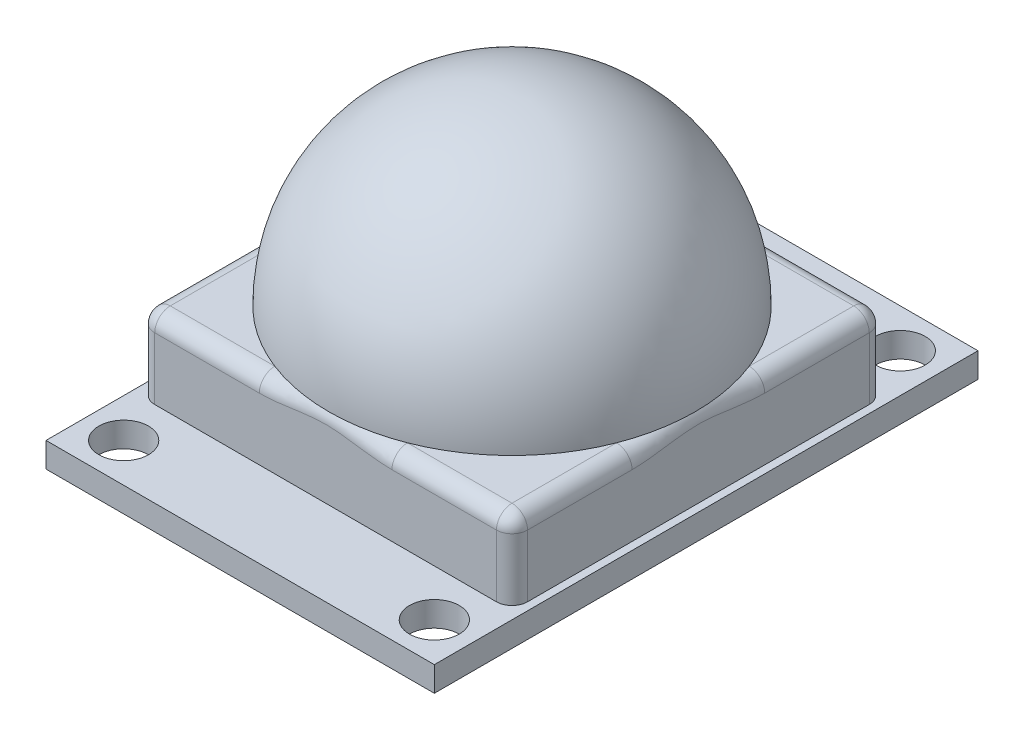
ISO-10303-21;
HEADER;
FILE_DESCRIPTION(('STEP AP214'),'2;1');
FILE_NAME('part.step','',(''),(''),'','','');
FILE_SCHEMA(('AUTOMOTIVE_DESIGN { 1 0 10303 214 1 1 1 1 }'));
ENDSEC;
DATA;
#1=APPLICATION_CONTEXT('core data for automotive mechanical design processes');
#2=APPLICATION_PROTOCOL_DEFINITION('international standard','automotive_design',2000,#1);
#3=PRODUCT_CONTEXT('',#1,'mechanical');
#4=PRODUCT('Part','Part','',(#3));
#5=PRODUCT_RELATED_PRODUCT_CATEGORY('part','',(#4));
#6=PRODUCT_DEFINITION_FORMATION('','',#4);
#7=PRODUCT_DEFINITION_CONTEXT('part definition',#1,'design');
#8=PRODUCT_DEFINITION('design','',#6,#7);
#9=PRODUCT_DEFINITION_SHAPE('','',#8);
#10=(LENGTH_UNIT() NAMED_UNIT(*) SI_UNIT(.MILLI.,.METRE.));
#11=(NAMED_UNIT(*) PLANE_ANGLE_UNIT() SI_UNIT($,.RADIAN.));
#12=(NAMED_UNIT(*) SI_UNIT($,.STERADIAN.) SOLID_ANGLE_UNIT());
#13=UNCERTAINTY_MEASURE_WITH_UNIT(LENGTH_MEASURE(1.E-05),#10,'distance_accuracy_value','');
#14=(GEOMETRIC_REPRESENTATION_CONTEXT(3) GLOBAL_UNCERTAINTY_ASSIGNED_CONTEXT((#13)) GLOBAL_UNIT_ASSIGNED_CONTEXT((#10,
#11,#12)) REPRESENTATION_CONTEXT('',''));
#15=CARTESIAN_POINT('',(0.,0.,0.));
#16=DIRECTION('',(0.,0.,1.));
#17=DIRECTION('',(1.,0.,0.));
#18=AXIS2_PLACEMENT_3D('',#15,#16,#17);
#19=CARTESIAN_POINT('',(0.5,6.6,-29.5));
#20=DIRECTION('',(0.,1.,0.));
#21=DIRECTION('',(0.,0.,1.));
#22=AXIS2_PLACEMENT_3D('',#19,#20,#21);
#23=PLANE('',#22);
#24=DIRECTION('',(1.,0.,0.));
#25=VECTOR('',#24,1.);
#26=CARTESIAN_POINT('',(24.5,6.6,-6.5));
#27=LINE('',#26,#25);
#28=CARTESIAN_POINT('',(16.7708313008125,6.6,-6.5));
#29=VERTEX_POINT('',#28);
#30=CARTESIAN_POINT('',(23.5,6.6,-6.5));
#31=VERTEX_POINT('',#30);
#32=EDGE_CURVE('E234',#29,#31,#27,.T.);
#33=ORIENTED_EDGE('',*,*,#32,.T.);
#34=DIRECTION('',(0.,0.,-1.));
#35=VECTOR('',#34,1.);
#36=CARTESIAN_POINT('',(23.5,6.6,-29.5));
#37=LINE('',#36,#35);
#38=CARTESIAN_POINT('',(23.5,6.60000000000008,-13.2291686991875));
#39=VERTEX_POINT('',#38);
#40=EDGE_CURVE('E236',#31,#39,#37,.T.);
#41=ORIENTED_EDGE('',*,*,#40,.T.);
#42=CARTESIAN_POINT('',(12.5,6.6,-17.5));
#43=DIRECTION('',(0.,-1.,0.));
#44=DIRECTION('',(0.,0.,-1.));
#45=AXIS2_PLACEMENT_3D('',#42,#43,#44);
#46=CIRCLE('',#45,11.8);
#47=EDGE_CURVE('E464',#39,#29,#46,.T.);
#48=ORIENTED_EDGE('',*,*,#47,.T.);
#49=EDGE_LOOP('',(#33,#41,#48));
#50=FACE_BOUND('',#49,.T.);
#51=ADVANCED_FACE('F26',(#50),#23,.T.);
#52=DIRECTION('',(0.,0.,1.));
#53=VECTOR('',#52,1.);
#54=CARTESIAN_POINT('',(1.49999999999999,6.6,-5.5));
#55=LINE('',#54,#53);
#56=CARTESIAN_POINT('',(1.5,6.59999999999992,-13.2291686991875));
#57=VERTEX_POINT('',#56);
#58=CARTESIAN_POINT('',(1.49999999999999,6.6,-6.5));
#59=VERTEX_POINT('',#58);
#60=EDGE_CURVE('E230',#57,#59,#55,.T.);
#61=ORIENTED_EDGE('',*,*,#60,.T.);
#62=DIRECTION('',(1.,0.,0.));
#63=VECTOR('',#62,1.);
#64=CARTESIAN_POINT('',(24.5,6.6,-6.5));
#65=LINE('',#64,#63);
#66=CARTESIAN_POINT('',(8.22916869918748,6.59999999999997,-6.5));
#67=VERTEX_POINT('',#66);
#68=EDGE_CURVE('E232',#59,#67,#65,.T.);
#69=ORIENTED_EDGE('',*,*,#68,.T.);
#70=EDGE_CURVE('E494',#67,#57,#46,.T.);
#71=ORIENTED_EDGE('',*,*,#70,.T.);
#72=EDGE_LOOP('',(#61,#69,#71));
#73=FACE_BOUND('',#72,.T.);
#74=ADVANCED_FACE('F450',(#73),#23,.T.);
#75=CARTESIAN_POINT('',(16.7708313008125,6.60000000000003,-28.5));
#76=VERTEX_POINT('',#75);
#77=CARTESIAN_POINT('',(23.5,6.60000000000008,-21.7708313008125));
#78=VERTEX_POINT('',#77);
#79=EDGE_CURVE('E410',#76,#78,#46,.T.);
#80=ORIENTED_EDGE('',*,*,#79,.T.);
#81=DIRECTION('',(0.,0.,-1.));
#82=VECTOR('',#81,1.);
#83=CARTESIAN_POINT('',(23.5,6.6,-29.5));
#84=LINE('',#83,#82);
#85=CARTESIAN_POINT('',(23.5,6.6,-28.5));
#86=VERTEX_POINT('',#85);
#87=EDGE_CURVE('E228',#78,#86,#84,.T.);
#88=ORIENTED_EDGE('',*,*,#87,.T.);
#89=DIRECTION('',(-1.,0.,0.));
#90=VECTOR('',#89,1.);
#91=CARTESIAN_POINT('',(0.5,6.6,-28.5));
#92=LINE('',#91,#90);
#93=EDGE_CURVE('E226',#86,#76,#92,.T.);
#94=ORIENTED_EDGE('',*,*,#93,.T.);
#95=EDGE_LOOP('',(#80,#88,#94));
#96=FACE_BOUND('',#95,.T.);
#97=ADVANCED_FACE('F439',(#96),#23,.T.);
#98=DIRECTION('',(-1.,0.,0.));
#99=VECTOR('',#98,1.);
#100=CARTESIAN_POINT('',(0.5,6.6,-28.5));
#101=LINE('',#100,#99);
#102=CARTESIAN_POINT('',(8.22916869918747,6.6,-28.5));
#103=VERTEX_POINT('',#102);
#104=CARTESIAN_POINT('',(1.5,6.6,-28.5));
#105=VERTEX_POINT('',#104);
#106=EDGE_CURVE('E194',#103,#105,#101,.T.);
#107=ORIENTED_EDGE('',*,*,#106,.T.);
#108=DIRECTION('',(0.,0.,1.));
#109=VECTOR('',#108,1.);
#110=CARTESIAN_POINT('',(1.49999999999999,6.6,-5.5));
#111=LINE('',#110,#109);
#112=CARTESIAN_POINT('',(1.5,6.59999999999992,-21.7708313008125));
#113=VERTEX_POINT('',#112);
#114=EDGE_CURVE('E224',#105,#113,#111,.T.);
#115=ORIENTED_EDGE('',*,*,#114,.T.);
#116=EDGE_CURVE('E501',#113,#103,#46,.T.);
#117=ORIENTED_EDGE('',*,*,#116,.T.);
#118=EDGE_LOOP('',(#107,#115,#117));
#119=FACE_BOUND('',#118,.T.);
#120=ADVANCED_FACE('F435',(#119),#23,.T.);
#121=CARTESIAN_POINT('',(0.,1.6,-35.));
#122=DIRECTION('',(0.,-1.,0.));
#123=DIRECTION('',(0.,0.,-1.));
#124=AXIS2_PLACEMENT_3D('',#121,#122,#123);
#125=PLANE('',#124);
#126=CARTESIAN_POINT('',(22.5,1.6,-2.5));
#127=DIRECTION('',(0.,1.,0.));
#128=DIRECTION('',(0.,0.,1.));
#129=AXIS2_PLACEMENT_3D('',#126,#127,#128);
#130=CIRCLE('',#129,1.6);
#131=CARTESIAN_POINT('',(22.5,1.6,-0.899999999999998));
#132=VERTEX_POINT('',#131);
#133=EDGE_CURVE('E647',#132,#132,#130,.T.);
#134=ORIENTED_EDGE('',*,*,#133,.F.);
#135=EDGE_LOOP('',(#134));
#136=FACE_BOUND('',#135,.T.);
#137=CARTESIAN_POINT('',(2.5,1.6,-32.5));
#138=DIRECTION('',(0.,1.,0.));
#139=DIRECTION('',(0.,0.,1.));
#140=AXIS2_PLACEMENT_3D('',#137,#138,#139);
#141=CIRCLE('',#140,1.6);
#142=CARTESIAN_POINT('',(2.5,1.6,-30.9));
#143=VERTEX_POINT('',#142);
#144=EDGE_CURVE('E659',#143,#143,#141,.T.);
#145=ORIENTED_EDGE('',*,*,#144,.F.);
#146=EDGE_LOOP('',(#145));
#147=FACE_BOUND('',#146,.T.);
#148=DIRECTION('',(0.,0.,1.));
#149=VECTOR('',#148,1.);
#150=CARTESIAN_POINT('',(0.,1.6,0.));
#151=LINE('',#150,#149);
#152=CARTESIAN_POINT('',(0.,1.6,-35.));
#153=VERTEX_POINT('',#152);
#154=CARTESIAN_POINT('',(0.,1.6,0.));
#155=VERTEX_POINT('',#154);
#156=EDGE_CURVE('E211',#153,#155,#151,.T.);
#157=ORIENTED_EDGE('',*,*,#156,.T.);
#158=DIRECTION('',(1.,0.,0.));
#159=VECTOR('',#158,1.);
#160=CARTESIAN_POINT('',(0.,1.6,0.));
#161=LINE('',#160,#159);
#162=CARTESIAN_POINT('',(25.,1.6,0.));
#163=VERTEX_POINT('',#162);
#164=EDGE_CURVE('E190',#155,#163,#161,.T.);
#165=ORIENTED_EDGE('',*,*,#164,.T.);
#166=DIRECTION('',(0.,0.,-1.));
#167=VECTOR('',#166,1.);
#168=CARTESIAN_POINT('',(25.,1.6,0.));
#169=LINE('',#168,#167);
#170=CARTESIAN_POINT('',(25.,1.6,-35.));
#171=VERTEX_POINT('',#170);
#172=EDGE_CURVE('E214',#163,#171,#169,.T.);
#173=ORIENTED_EDGE('',*,*,#172,.T.);
#174=DIRECTION('',(-1.,0.,0.));
#175=VECTOR('',#174,1.);
#176=CARTESIAN_POINT('',(0.,1.6,-35.));
#177=LINE('',#176,#175);
#178=EDGE_CURVE('E216',#171,#153,#177,.T.);
#179=ORIENTED_EDGE('',*,*,#178,.T.);
#180=EDGE_LOOP('',(#157,#165,#173,#179));
#181=FACE_BOUND('',#180,.T.);
#182=CARTESIAN_POINT('',(22.5,1.6,-32.5));
#183=DIRECTION('',(0.,1.,0.));
#184=DIRECTION('',(0.,0.,1.));
#185=AXIS2_PLACEMENT_3D('',#182,#183,#184);
#186=CIRCLE('',#185,1.6);
#187=CARTESIAN_POINT('',(22.5,1.6,-30.9));
#188=VERTEX_POINT('',#187);
#189=EDGE_CURVE('E201',#188,#188,#186,.T.);
#190=ORIENTED_EDGE('',*,*,#189,.F.);
#191=EDGE_LOOP('',(#190));
#192=FACE_BOUND('',#191,.T.);
#193=CARTESIAN_POINT('',(2.5,1.6,-2.5));
#194=DIRECTION('',(0.,1.,0.));
#195=DIRECTION('',(0.,0.,1.));
#196=AXIS2_PLACEMENT_3D('',#193,#194,#195);
#197=CIRCLE('',#196,1.6);
#198=CARTESIAN_POINT('',(2.5,1.6,-0.899999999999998));
#199=VERTEX_POINT('',#198);
#200=EDGE_CURVE('E653',#199,#199,#197,.T.);
#201=ORIENTED_EDGE('',*,*,#200,.F.);
#202=EDGE_LOOP('',(#201));
#203=FACE_BOUND('',#202,.T.);
#204=DIRECTION('',(0.,0.,1.));
#205=VECTOR('',#204,1.);
#206=CARTESIAN_POINT('',(0.5,1.6,-29.5));
#207=LINE('',#206,#205);
#208=CARTESIAN_POINT('',(0.5,1.6,-28.5));
#209=VERTEX_POINT('',#208);
#210=CARTESIAN_POINT('',(0.499999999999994,1.6,-6.50000000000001));
#211=VERTEX_POINT('',#210);
#212=EDGE_CURVE('E490',#209,#211,#207,.T.);
#213=ORIENTED_EDGE('',*,*,#212,.F.);
#214=CARTESIAN_POINT('',(1.5,1.6,-28.5));
#215=DIRECTION('',(0.,-1.,0.));
#216=DIRECTION('',(0.,0.,-1.));
#217=AXIS2_PLACEMENT_3D('',#214,#215,#216);
#218=CIRCLE('',#217,1.);
#219=CARTESIAN_POINT('',(1.5,1.6,-29.5));
#220=VERTEX_POINT('',#219);
#221=EDGE_CURVE('E586',#209,#220,#218,.T.);
#222=ORIENTED_EDGE('',*,*,#221,.T.);
#223=DIRECTION('',(-1.,0.,0.));
#224=VECTOR('',#223,1.);
#225=CARTESIAN_POINT('',(0.5,1.6,-29.5));
#226=LINE('',#225,#224);
#227=CARTESIAN_POINT('',(23.5,1.6,-29.5));
#228=VERTEX_POINT('',#227);
#229=EDGE_CURVE('E624',#228,#220,#226,.T.);
#230=ORIENTED_EDGE('',*,*,#229,.F.);
#231=CARTESIAN_POINT('',(23.5,1.6,-28.5));
#232=DIRECTION('',(0.,-1.,0.));
#233=DIRECTION('',(0.,0.,-1.));
#234=AXIS2_PLACEMENT_3D('',#231,#232,#233);
#235=CIRCLE('',#234,1.);
#236=CARTESIAN_POINT('',(24.5,1.6,-28.5));
#237=VERTEX_POINT('',#236);
#238=EDGE_CURVE('E588',#228,#237,#235,.T.);
#239=ORIENTED_EDGE('',*,*,#238,.T.);
#240=DIRECTION('',(0.,0.,-1.));
#241=VECTOR('',#240,1.);
#242=CARTESIAN_POINT('',(24.5,1.6,-29.5));
#243=LINE('',#242,#241);
#244=CARTESIAN_POINT('',(24.5,1.6,-6.5));
#245=VERTEX_POINT('',#244);
#246=EDGE_CURVE('E598',#245,#237,#243,.T.);
#247=ORIENTED_EDGE('',*,*,#246,.F.);
#248=CARTESIAN_POINT('',(23.5,1.6,-6.5));
#249=DIRECTION('',(0.,-1.,0.));
#250=DIRECTION('',(0.,0.,-1.));
#251=AXIS2_PLACEMENT_3D('',#248,#249,#250);
#252=CIRCLE('',#251,1.);
#253=CARTESIAN_POINT('',(23.5,1.6,-5.5));
#254=VERTEX_POINT('',#253);
#255=EDGE_CURVE('E35',#245,#254,#252,.T.);
#256=ORIENTED_EDGE('',*,*,#255,.T.);
#257=DIRECTION('',(1.,0.,0.));
#258=VECTOR('',#257,1.);
#259=CARTESIAN_POINT('',(0.499999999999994,1.6,-5.5));
#260=LINE('',#259,#258);
#261=CARTESIAN_POINT('',(1.49999999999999,1.6,-5.5));
#262=VERTEX_POINT('',#261);
#263=EDGE_CURVE('E595',#262,#254,#260,.T.);
#264=ORIENTED_EDGE('',*,*,#263,.F.);
#265=CARTESIAN_POINT('',(1.49999999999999,1.6,-6.5));
#266=DIRECTION('',(0.,-1.,0.));
#267=DIRECTION('',(0.,0.,-1.));
#268=AXIS2_PLACEMENT_3D('',#265,#266,#267);
#269=CIRCLE('',#268,1.);
#270=EDGE_CURVE('E11',#262,#211,#269,.T.);
#271=ORIENTED_EDGE('',*,*,#270,.T.);
#272=EDGE_LOOP('',(#213,#222,#230,#239,#247,#256,#264,#271));
#273=FACE_BOUND('',#272,.T.);
#274=ADVANCED_FACE('F438',(#136,#147,#181,#192,#203,#273),#125,.F.);
#275=CARTESIAN_POINT('',(0.,0.,-35.));
#276=DIRECTION('',(0.,-1.,0.));
#277=DIRECTION('',(0.,0.,-1.));
#278=AXIS2_PLACEMENT_3D('',#275,#276,#277);
#279=PLANE('',#278);
#280=CARTESIAN_POINT('',(2.5,0.,-2.5));
#281=DIRECTION('',(0.,1.,0.));
#282=DIRECTION('',(0.,0.,1.));
#283=AXIS2_PLACEMENT_3D('',#280,#281,#282);
#284=CIRCLE('',#283,1.6);
#285=CARTESIAN_POINT('',(2.5,0.,-0.899999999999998));
#286=VERTEX_POINT('',#285);
#287=EDGE_CURVE('E650',#286,#286,#284,.T.);
#288=ORIENTED_EDGE('',*,*,#287,.T.);
#289=EDGE_LOOP('',(#288));
#290=FACE_BOUND('',#289,.T.);
#291=CARTESIAN_POINT('',(22.5,0.,-7.5));
#292=DIRECTION('',(0.,1.,0.));
#293=DIRECTION('',(0.,0.,1.));
#294=AXIS2_PLACEMENT_3D('',#291,#292,#293);
#295=CIRCLE('',#294,0.59944);
#296=CARTESIAN_POINT('',(22.5,0.,-6.90056));
#297=VERTEX_POINT('',#296);
#298=EDGE_CURVE('E662',#297,#297,#295,.T.);
#299=ORIENTED_EDGE('',*,*,#298,.T.);
#300=EDGE_LOOP('',(#299));
#301=FACE_BOUND('',#300,.T.);
#302=CARTESIAN_POINT('',(2.5,0.,-27.5));
#303=DIRECTION('',(0.,1.,0.));
#304=DIRECTION('',(0.,0.,1.));
#305=AXIS2_PLACEMENT_3D('',#302,#303,#304);
#306=CIRCLE('',#305,0.599439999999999);
#307=CARTESIAN_POINT('',(2.5,0.,-26.90056));
#308=VERTEX_POINT('',#307);
#309=EDGE_CURVE('E668',#308,#308,#306,.T.);
#310=ORIENTED_EDGE('',*,*,#309,.T.);
#311=EDGE_LOOP('',(#310));
#312=FACE_BOUND('',#311,.T.);
#313=CARTESIAN_POINT('',(22.5,0.,-32.5));
#314=DIRECTION('',(0.,1.,0.));
#315=DIRECTION('',(0.,0.,1.));
#316=AXIS2_PLACEMENT_3D('',#313,#314,#315);
#317=CIRCLE('',#316,1.6);
#318=CARTESIAN_POINT('',(22.5,0.,-30.9));
#319=VERTEX_POINT('',#318);
#320=EDGE_CURVE('E204',#319,#319,#317,.T.);
#321=ORIENTED_EDGE('',*,*,#320,.T.);
#322=EDGE_LOOP('',(#321));
#323=FACE_BOUND('',#322,.T.);
#324=DIRECTION('',(0.,0.,1.));
#325=VECTOR('',#324,1.);
#326=CARTESIAN_POINT('',(0.,0.,0.));
#327=LINE('',#326,#325);
#328=CARTESIAN_POINT('',(0.,0.,-35.));
#329=VERTEX_POINT('',#328);
#330=CARTESIAN_POINT('',(0.,0.,0.));
#331=VERTEX_POINT('',#330);
#332=EDGE_CURVE('E181',#329,#331,#327,.T.);
#333=ORIENTED_EDGE('',*,*,#332,.F.);
#334=DIRECTION('',(-1.,0.,0.));
#335=VECTOR('',#334,1.);
#336=CARTESIAN_POINT('',(0.,0.,-35.));
#337=LINE('',#336,#335);
#338=CARTESIAN_POINT('',(25.,0.,-35.));
#339=VERTEX_POINT('',#338);
#340=EDGE_CURVE('E209',#339,#329,#337,.T.);
#341=ORIENTED_EDGE('',*,*,#340,.F.);
#342=DIRECTION('',(0.,0.,-1.));
#343=VECTOR('',#342,1.);
#344=CARTESIAN_POINT('',(25.,0.,0.));
#345=LINE('',#344,#343);
#346=CARTESIAN_POINT('',(25.,0.,0.));
#347=VERTEX_POINT('',#346);
#348=EDGE_CURVE('E182',#347,#339,#345,.T.);
#349=ORIENTED_EDGE('',*,*,#348,.F.);
#350=DIRECTION('',(1.,0.,0.));
#351=VECTOR('',#350,1.);
#352=CARTESIAN_POINT('',(0.,0.,0.));
#353=LINE('',#352,#351);
#354=EDGE_CURVE('E175',#331,#347,#353,.T.);
#355=ORIENTED_EDGE('',*,*,#354,.F.);
#356=EDGE_LOOP('',(#333,#341,#349,#355));
#357=FACE_BOUND('',#356,.T.);
#358=CARTESIAN_POINT('',(22.5,0.,-27.5));
#359=DIRECTION('',(0.,1.,0.));
#360=DIRECTION('',(0.,0.,1.));
#361=AXIS2_PLACEMENT_3D('',#358,#359,#360);
#362=CIRCLE('',#361,0.59944);
#363=CARTESIAN_POINT('',(22.5,0.,-26.90056));
#364=VERTEX_POINT('',#363);
#365=EDGE_CURVE('E671',#364,#364,#362,.T.);
#366=ORIENTED_EDGE('',*,*,#365,.T.);
#367=EDGE_LOOP('',(#366));
#368=FACE_BOUND('',#367,.T.);
#369=CARTESIAN_POINT('',(2.5,0.,-7.5));
#370=DIRECTION('',(0.,1.,0.));
#371=DIRECTION('',(0.,0.,1.));
#372=AXIS2_PLACEMENT_3D('',#369,#370,#371);
#373=CIRCLE('',#372,0.59944);
#374=CARTESIAN_POINT('',(2.5,0.,-6.90056));
#375=VERTEX_POINT('',#374);
#376=EDGE_CURVE('E665',#375,#375,#373,.T.);
#377=ORIENTED_EDGE('',*,*,#376,.T.);
#378=EDGE_LOOP('',(#377));
#379=FACE_BOUND('',#378,.T.);
#380=CARTESIAN_POINT('',(2.5,0.,-32.5));
#381=DIRECTION('',(0.,1.,0.));
#382=DIRECTION('',(0.,0.,1.));
#383=AXIS2_PLACEMENT_3D('',#380,#381,#382);
#384=CIRCLE('',#383,1.6);
#385=CARTESIAN_POINT('',(2.5,0.,-30.9));
#386=VERTEX_POINT('',#385);
#387=EDGE_CURVE('E656',#386,#386,#384,.T.);
#388=ORIENTED_EDGE('',*,*,#387,.T.);
#389=EDGE_LOOP('',(#388));
#390=FACE_BOUND('',#389,.T.);
#391=CARTESIAN_POINT('',(22.5,0.,-2.5));
#392=DIRECTION('',(0.,1.,0.));
#393=DIRECTION('',(0.,0.,1.));
#394=AXIS2_PLACEMENT_3D('',#391,#392,#393);
#395=CIRCLE('',#394,1.6);
#396=CARTESIAN_POINT('',(22.5,0.,-0.899999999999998));
#397=VERTEX_POINT('',#396);
#398=EDGE_CURVE('E644',#397,#397,#395,.T.);
#399=ORIENTED_EDGE('',*,*,#398,.T.);
#400=EDGE_LOOP('',(#399));
#401=FACE_BOUND('',#400,.T.);
#402=ADVANCED_FACE('F177',(#290,#301,#312,#323,#357,#368,#379,#390,#401),#279,.T.);
#403=CARTESIAN_POINT('',(0.,1.6,0.));
#404=DIRECTION('',(1.,0.,0.));
#405=DIRECTION('',(0.,0.,-1.));
#406=AXIS2_PLACEMENT_3D('',#403,#404,#405);
#407=PLANE('',#406);
#408=ORIENTED_EDGE('',*,*,#332,.T.);
#409=DIRECTION('',(0.,-1.,0.));
#410=VECTOR('',#409,1.);
#411=CARTESIAN_POINT('',(0.,1.6,0.));
#412=LINE('',#411,#410);
#413=EDGE_CURVE('E188',#155,#331,#412,.T.);
#414=ORIENTED_EDGE('',*,*,#413,.F.);
#415=ORIENTED_EDGE('',*,*,#156,.F.);
#416=DIRECTION('',(0.,-1.,0.));
#417=VECTOR('',#416,1.);
#418=CARTESIAN_POINT('',(0.,1.6,-35.));
#419=LINE('',#418,#417);
#420=EDGE_CURVE('E200',#153,#329,#419,.T.);
#421=ORIENTED_EDGE('',*,*,#420,.T.);
#422=EDGE_LOOP('',(#408,#414,#415,#421));
#423=FACE_BOUND('',#422,.T.);
#424=ADVANCED_FACE('F198',(#423),#407,.F.);
#425=CARTESIAN_POINT('',(0.,1.6,0.));
#426=DIRECTION('',(0.,0.,-1.));
#427=DIRECTION('',(-1.,0.,0.));
#428=AXIS2_PLACEMENT_3D('',#425,#426,#427);
#429=PLANE('',#428);
#430=ORIENTED_EDGE('',*,*,#354,.T.);
#431=DIRECTION('',(0.,-1.,0.));
#432=VECTOR('',#431,1.);
#433=CARTESIAN_POINT('',(25.,1.6,0.));
#434=LINE('',#433,#432);
#435=EDGE_CURVE('E195',#163,#347,#434,.T.);
#436=ORIENTED_EDGE('',*,*,#435,.F.);
#437=ORIENTED_EDGE('',*,*,#164,.F.);
#438=ORIENTED_EDGE('',*,*,#413,.T.);
#439=EDGE_LOOP('',(#430,#436,#437,#438));
#440=FACE_BOUND('',#439,.T.);
#441=ADVANCED_FACE('F189',(#440),#429,.F.);
#442=CARTESIAN_POINT('',(25.,1.6,0.));
#443=DIRECTION('',(-1.,0.,0.));
#444=DIRECTION('',(0.,0.,1.));
#445=AXIS2_PLACEMENT_3D('',#442,#443,#444);
#446=PLANE('',#445);
#447=ORIENTED_EDGE('',*,*,#348,.T.);
#448=DIRECTION('',(0.,-1.,0.));
#449=VECTOR('',#448,1.);
#450=CARTESIAN_POINT('',(25.,1.6,-35.));
#451=LINE('',#450,#449);
#452=EDGE_CURVE('E219',#171,#339,#451,.T.);
#453=ORIENTED_EDGE('',*,*,#452,.F.);
#454=ORIENTED_EDGE('',*,*,#172,.F.);
#455=ORIENTED_EDGE('',*,*,#435,.T.);
#456=EDGE_LOOP('',(#447,#453,#454,#455));
#457=FACE_BOUND('',#456,.T.);
#458=ADVANCED_FACE('F690',(#457),#446,.F.);
#459=CARTESIAN_POINT('',(0.,1.6,-35.));
#460=DIRECTION('',(0.,0.,1.));
#461=DIRECTION('',(1.,0.,0.));
#462=AXIS2_PLACEMENT_3D('',#459,#460,#461);
#463=PLANE('',#462);
#464=ORIENTED_EDGE('',*,*,#340,.T.);
#465=ORIENTED_EDGE('',*,*,#420,.F.);
#466=ORIENTED_EDGE('',*,*,#178,.F.);
#467=ORIENTED_EDGE('',*,*,#452,.T.);
#468=EDGE_LOOP('',(#464,#465,#466,#467));
#469=FACE_BOUND('',#468,.T.);
#470=ADVANCED_FACE('F680',(#469),#463,.F.);
#471=CARTESIAN_POINT('',(22.5,1.6,-32.5));
#472=DIRECTION('',(0.,-1.,0.));
#473=DIRECTION('',(0.,0.,-1.));
#474=AXIS2_PLACEMENT_3D('',#471,#472,#473);
#475=CYLINDRICAL_SURFACE('',#474,1.6);
#476=ORIENTED_EDGE('',*,*,#189,.T.);
#477=EDGE_LOOP('',(#476));
#478=FACE_BOUND('',#477,.T.);
#479=ORIENTED_EDGE('',*,*,#320,.F.);
#480=EDGE_LOOP('',(#479));
#481=FACE_BOUND('',#480,.T.);
#482=ADVANCED_FACE('F677',(#478,#481),#475,.F.);
#483=CARTESIAN_POINT('',(22.5,1.6,-27.5));
#484=DIRECTION('',(0.,-1.,0.));
#485=DIRECTION('',(0.,0.,-1.));
#486=AXIS2_PLACEMENT_3D('',#483,#484,#485);
#487=CYLINDRICAL_SURFACE('',#486,0.59944);
#488=CARTESIAN_POINT('',(22.5,1.6,-27.5));
#489=DIRECTION('',(0.,1.,0.));
#490=DIRECTION('',(0.,0.,1.));
#491=AXIS2_PLACEMENT_3D('',#488,#489,#490);
#492=CIRCLE('',#491,0.59944);
#493=CARTESIAN_POINT('',(22.5,1.6,-26.90056));
#494=VERTEX_POINT('',#493);
#495=EDGE_CURVE('E641',#494,#494,#492,.T.);
#496=ORIENTED_EDGE('',*,*,#495,.T.);
#497=EDGE_LOOP('',(#496));
#498=FACE_BOUND('',#497,.T.);
#499=ORIENTED_EDGE('',*,*,#365,.F.);
#500=EDGE_LOOP('',(#499));
#501=FACE_BOUND('',#500,.T.);
#502=ADVANCED_FACE('F679',(#498,#501),#487,.F.);
#503=CARTESIAN_POINT('',(2.5,1.6,-27.5));
#504=DIRECTION('',(0.,-1.,0.));
#505=DIRECTION('',(0.,0.,-1.));
#506=AXIS2_PLACEMENT_3D('',#503,#504,#505);
#507=CYLINDRICAL_SURFACE('',#506,0.599439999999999);
#508=CARTESIAN_POINT('',(2.5,1.6,-27.5));
#509=DIRECTION('',(0.,1.,0.));
#510=DIRECTION('',(0.,0.,1.));
#511=AXIS2_PLACEMENT_3D('',#508,#509,#510);
#512=CIRCLE('',#511,0.599439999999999);
#513=CARTESIAN_POINT('',(2.5,1.6,-26.90056));
#514=VERTEX_POINT('',#513);
#515=EDGE_CURVE('E638',#514,#514,#512,.T.);
#516=ORIENTED_EDGE('',*,*,#515,.T.);
#517=EDGE_LOOP('',(#516));
#518=FACE_BOUND('',#517,.T.);
#519=ORIENTED_EDGE('',*,*,#309,.F.);
#520=EDGE_LOOP('',(#519));
#521=FACE_BOUND('',#520,.T.);
#522=ADVANCED_FACE('F687',(#518,#521),#507,.F.);
#523=CARTESIAN_POINT('',(2.5,1.6,-7.5));
#524=DIRECTION('',(0.,-1.,0.));
#525=DIRECTION('',(0.,0.,-1.));
#526=AXIS2_PLACEMENT_3D('',#523,#524,#525);
#527=CYLINDRICAL_SURFACE('',#526,0.59944);
#528=CARTESIAN_POINT('',(2.5,1.6,-7.5));
#529=DIRECTION('',(0.,1.,0.));
#530=DIRECTION('',(0.,0.,1.));
#531=AXIS2_PLACEMENT_3D('',#528,#529,#530);
#532=CIRCLE('',#531,0.59944);
#533=CARTESIAN_POINT('',(2.5,1.6,-6.90056));
#534=VERTEX_POINT('',#533);
#535=EDGE_CURVE('E633',#534,#534,#532,.T.);
#536=ORIENTED_EDGE('',*,*,#535,.T.);
#537=EDGE_LOOP('',(#536));
#538=FACE_BOUND('',#537,.T.);
#539=ORIENTED_EDGE('',*,*,#376,.F.);
#540=EDGE_LOOP('',(#539));
#541=FACE_BOUND('',#540,.T.);
#542=ADVANCED_FACE('F733',(#538,#541),#527,.F.);
#543=CARTESIAN_POINT('',(22.5,1.6,-7.5));
#544=DIRECTION('',(0.,-1.,0.));
#545=DIRECTION('',(0.,0.,-1.));
#546=AXIS2_PLACEMENT_3D('',#543,#544,#545);
#547=CYLINDRICAL_SURFACE('',#546,0.59944);
#548=CARTESIAN_POINT('',(22.5,1.6,-7.5));
#549=DIRECTION('',(0.,1.,0.));
#550=DIRECTION('',(0.,0.,1.));
#551=AXIS2_PLACEMENT_3D('',#548,#549,#550);
#552=CIRCLE('',#551,0.59944);
#553=CARTESIAN_POINT('',(22.5,1.6,-6.90056));
#554=VERTEX_POINT('',#553);
#555=EDGE_CURVE('E630',#554,#554,#552,.T.);
#556=ORIENTED_EDGE('',*,*,#555,.T.);
#557=EDGE_LOOP('',(#556));
#558=FACE_BOUND('',#557,.T.);
#559=ORIENTED_EDGE('',*,*,#298,.F.);
#560=EDGE_LOOP('',(#559));
#561=FACE_BOUND('',#560,.T.);
#562=ADVANCED_FACE('F740',(#558,#561),#547,.F.);
#563=CARTESIAN_POINT('',(2.5,1.6,-32.5));
#564=DIRECTION('',(0.,-1.,0.));
#565=DIRECTION('',(0.,0.,-1.));
#566=AXIS2_PLACEMENT_3D('',#563,#564,#565);
#567=CYLINDRICAL_SURFACE('',#566,1.6);
#568=ORIENTED_EDGE('',*,*,#144,.T.);
#569=EDGE_LOOP('',(#568));
#570=FACE_BOUND('',#569,.T.);
#571=ORIENTED_EDGE('',*,*,#387,.F.);
#572=EDGE_LOOP('',(#571));
#573=FACE_BOUND('',#572,.T.);
#574=ADVANCED_FACE('F748',(#570,#573),#567,.F.);
#575=CARTESIAN_POINT('',(2.5,1.6,-2.5));
#576=DIRECTION('',(0.,-1.,0.));
#577=DIRECTION('',(0.,0.,-1.));
#578=AXIS2_PLACEMENT_3D('',#575,#576,#577);
#579=CYLINDRICAL_SURFACE('',#578,1.6);
#580=ORIENTED_EDGE('',*,*,#200,.T.);
#581=EDGE_LOOP('',(#580));
#582=FACE_BOUND('',#581,.T.);
#583=ORIENTED_EDGE('',*,*,#287,.F.);
#584=EDGE_LOOP('',(#583));
#585=FACE_BOUND('',#584,.T.);
#586=ADVANCED_FACE('F756',(#582,#585),#579,.F.);
#587=CARTESIAN_POINT('',(22.5,1.6,-2.5));
#588=DIRECTION('',(0.,-1.,0.));
#589=DIRECTION('',(0.,0.,-1.));
#590=AXIS2_PLACEMENT_3D('',#587,#588,#589);
#591=CYLINDRICAL_SURFACE('',#590,1.6);
#592=ORIENTED_EDGE('',*,*,#133,.T.);
#593=EDGE_LOOP('',(#592));
#594=FACE_BOUND('',#593,.T.);
#595=ORIENTED_EDGE('',*,*,#398,.F.);
#596=EDGE_LOOP('',(#595));
#597=FACE_BOUND('',#596,.T.);
#598=ADVANCED_FACE('F432',(#594,#597),#591,.F.);
#599=CARTESIAN_POINT('',(0.5,1.6,-29.5));
#600=DIRECTION('',(0.,1.,0.));
#601=DIRECTION('',(0.,0.,1.));
#602=AXIS2_PLACEMENT_3D('',#599,#600,#601);
#603=PLANE('',#602);
#604=ORIENTED_EDGE('',*,*,#555,.F.);
#605=EDGE_LOOP('',(#604));
#606=FACE_BOUND('',#605,.T.);
#607=ADVANCED_FACE('F426',(#606),#603,.F.);
#608=ORIENTED_EDGE('',*,*,#535,.F.);
#609=EDGE_LOOP('',(#608));
#610=FACE_BOUND('',#609,.T.);
#611=ADVANCED_FACE('F431',(#610),#603,.F.);
#612=ORIENTED_EDGE('',*,*,#515,.F.);
#613=EDGE_LOOP('',(#612));
#614=FACE_BOUND('',#613,.T.);
#615=ADVANCED_FACE('F786',(#614),#603,.F.);
#616=ORIENTED_EDGE('',*,*,#495,.F.);
#617=EDGE_LOOP('',(#616));
#618=FACE_BOUND('',#617,.T.);
#619=ADVANCED_FACE('F434',(#618),#603,.F.);
#620=CARTESIAN_POINT('',(0.5,6.6,-29.5));
#621=DIRECTION('',(1.,0.,0.));
#622=DIRECTION('',(0.,0.,-1.));
#623=AXIS2_PLACEMENT_3D('',#620,#621,#622);
#624=PLANE('',#623);
#625=DIRECTION('',(0.,0.,1.));
#626=VECTOR('',#625,1.);
#627=CARTESIAN_POINT('',(0.5,5.6,-29.5));
#628=LINE('',#627,#626);
#629=CARTESIAN_POINT('',(0.499999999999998,5.6,-21.7708313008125));
#630=VERTEX_POINT('',#629);
#631=CARTESIAN_POINT('',(0.5,5.6,-28.5));
#632=VERTEX_POINT('',#631);
#633=EDGE_CURVE('E562',#630,#632,#628,.F.);
#634=ORIENTED_EDGE('',*,*,#633,.T.);
#635=DIRECTION('',(0.,-1.,0.));
#636=VECTOR('',#635,1.);
#637=CARTESIAN_POINT('',(0.5,6.6,-28.5));
#638=LINE('',#637,#636);
#639=EDGE_CURVE('E565',#632,#209,#638,.T.);
#640=ORIENTED_EDGE('',*,*,#639,.T.);
#641=ORIENTED_EDGE('',*,*,#212,.T.);
#642=DIRECTION('',(0.,-1.,0.));
#643=VECTOR('',#642,1.);
#644=CARTESIAN_POINT('',(0.499999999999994,6.6,-6.5));
#645=LINE('',#644,#643);
#646=CARTESIAN_POINT('',(0.499999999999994,5.6,-6.5));
#647=VERTEX_POINT('',#646);
#648=EDGE_CURVE('E605',#211,#647,#645,.F.);
#649=ORIENTED_EDGE('',*,*,#648,.T.);
#650=DIRECTION('',(0.,0.,1.));
#651=VECTOR('',#650,1.);
#652=CARTESIAN_POINT('',(0.5,5.6,-29.5));
#653=LINE('',#652,#651);
#654=CARTESIAN_POINT('',(0.499999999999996,5.6,-13.2291686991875));
#655=VERTEX_POINT('',#654);
#656=EDGE_CURVE('E570',#647,#655,#653,.F.);
#657=ORIENTED_EDGE('',*,*,#656,.T.);
#658=CARTESIAN_POINT('',(0.499999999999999,5.8030681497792,-23.2324456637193));
#659=CARTESIAN_POINT('',(0.499999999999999,6.3611612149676,-23.0369451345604));
#660=CARTESIAN_POINT('',(1.01817641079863,6.63006361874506,-22.9427483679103));
#661=CARTESIAN_POINT('',(1.53635282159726,6.89896602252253,-22.8485516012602));
#662=CARTESIAN_POINT('',(2.03569205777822,6.6,-22.953279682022));
#663=CARTESIAN_POINT('',(0.499999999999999,5.78764785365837,-23.1883949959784));
#664=CARTESIAN_POINT('',(0.499999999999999,6.34290248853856,-23.0055378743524));
#665=CARTESIAN_POINT('',(1.00926619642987,6.61533490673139,-22.9155538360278));
#666=CARTESIAN_POINT('',(1.51858509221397,6.88785654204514,-22.8257394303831));
#667=CARTESIAN_POINT('',(2.01851780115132,6.6,-22.9203253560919));
#668=CARTESIAN_POINT('',(0.499999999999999,5.77343202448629,-23.143942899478));
#669=CARTESIAN_POINT('',(0.499999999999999,6.32530965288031,-22.9725972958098));
#670=CARTESIAN_POINT('',(1.00055716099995,6.60090245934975,-22.886784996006));
#671=CARTESIAN_POINT('',(1.50116241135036,6.87657520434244,-22.8011446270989));
#672=CARTESIAN_POINT('',(2.00125843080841,6.6,-22.8868250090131));
#673=CARTESIAN_POINT('',(0.499999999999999,5.74716698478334,-23.0544280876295));
#674=CARTESIAN_POINT('',(0.499999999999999,6.29163313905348,-22.9043584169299));
#675=CARTESIAN_POINT('',(0.983529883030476,6.57279190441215,-22.826615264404));
#676=CARTESIAN_POINT('',(1.46710781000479,6.85402944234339,-22.7490399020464));
#677=CARTESIAN_POINT('',(1.96666243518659,6.6,-22.8188579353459));
#678=CARTESIAN_POINT('',(0.499999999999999,5.73511655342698,-23.0093657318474));
#679=CARTESIAN_POINT('',(0.499999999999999,6.2755351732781,-22.8690646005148));
#680=CARTESIAN_POINT('',(0.975211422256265,6.55911337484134,-22.7952158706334));
#681=CARTESIAN_POINT('',(1.4504659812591,6.84276158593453,-22.7215402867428));
#682=CARTESIAN_POINT('',(1.9493258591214,6.6,-22.7843917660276));
#683=CARTESIAN_POINT('',(0.499999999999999,5.7018747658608,-22.8736732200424));
#684=CARTESIAN_POINT('',(0.499999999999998,6.22972563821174,-22.7608047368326));
#685=CARTESIAN_POINT('',(0.950845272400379,6.5194841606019,-22.6979381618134));
#686=CARTESIAN_POINT('',(1.40186179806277,6.8095215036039,-22.6357534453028));
#687=CARTESIAN_POINT('',(1.89738585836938,6.6,-22.6798280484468));
#688=CARTESIAN_POINT('',(0.499999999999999,5.68352793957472,-22.7823442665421));
#689=CARTESIAN_POINT('',(0.499999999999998,6.20210335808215,-22.6847445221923));
#690=CARTESIAN_POINT('',(0.935348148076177,6.49487436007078,-22.6288574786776));
#691=CARTESIAN_POINT('',(1.37083629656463,6.78785882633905,-22.5736481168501));
#692=CARTESIAN_POINT('',(1.86277662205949,6.6,-22.608420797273));
#693=CARTESIAN_POINT('',(0.499999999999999,5.65323335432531,-22.6001734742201));
#694=CARTESIAN_POINT('',(0.499999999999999,6.15301836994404,-22.5289833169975));
#695=CARTESIAN_POINT('',(0.905922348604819,6.44988840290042,-22.4859335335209));
#696=CARTESIAN_POINT('',(1.31197885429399,6.74696408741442,-22.4435376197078));
#697=CARTESIAN_POINT('',(1.79456937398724,6.6,-22.4638739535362));
#698=CARTESIAN_POINT('',(0.499999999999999,5.64118813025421,-22.5093471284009));
#699=CARTESIAN_POINT('',(0.499999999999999,6.13139346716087,-22.449342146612));
#700=CARTESIAN_POINT('',(0.891972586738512,6.42945094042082,-22.4121838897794));
#701=CARTESIAN_POINT('',(1.28405630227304,6.72766382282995,-22.3756532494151));
#702=CARTESIAN_POINT('',(1.76096403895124,6.6,-22.390780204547));
#703=CARTESIAN_POINT('',(0.499999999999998,5.62203640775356,-22.3271645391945));
#704=CARTESIAN_POINT('',(0.499999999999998,6.09313138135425,-22.2867830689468));
#705=CARTESIAN_POINT('',(0.865227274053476,6.39217015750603,-22.2604742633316));
#706=CARTESIAN_POINT('',(1.23056400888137,6.69136101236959,-22.234789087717));
#707=CARTESIAN_POINT('',(1.69448377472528,6.6,-22.2420942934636));
#708=CARTESIAN_POINT('',(0.499999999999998,5.61493129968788,-22.23580815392));
#709=CARTESIAN_POINT('',(0.499999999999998,6.07643919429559,-22.2038248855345));
#710=CARTESIAN_POINT('',(0.852432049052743,6.37532784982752,-22.1825131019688));
#711=CARTESIAN_POINT('',(1.204953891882,6.67432552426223,-22.161792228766));
#712=CARTESIAN_POINT('',(1.66160905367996,6.6,-22.1665014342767));
#713=CARTESIAN_POINT('',(0.499999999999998,5.59968020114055,-21.9593262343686));
#714=CARTESIAN_POINT('',(0.499999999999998,6.03280793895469,-21.9506265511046));
#715=CARTESIAN_POINT('',(0.815332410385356,6.32945684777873,-21.9421635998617));
#716=CARTESIAN_POINT('',(1.13103600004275,6.62656870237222,-21.9360869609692));
#717=CARTESIAN_POINT('',(1.56370078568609,6.6,-21.9346019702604));
#718=CARTESIAN_POINT('',(0.499999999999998,5.59790084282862,-21.7738526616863));
#719=CARTESIAN_POINT('',(0.499999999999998,6.01225766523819,-21.7756887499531));
#720=CARTESIAN_POINT('',(0.792640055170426,6.30558043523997,-21.7749712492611));
#721=CARTESIAN_POINT('',(1.08553613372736,6.59913107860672,-21.7763274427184));
#722=CARTESIAN_POINT('',(1.5001620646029,6.6,-21.7748120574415));
#723=CARTESIAN_POINT('',(0.499999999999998,5.6062977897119,-21.4031376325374));
#724=CARTESIAN_POINT('',(0.499999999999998,5.98496791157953,-21.4213701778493));
#725=CARTESIAN_POINT('',(0.750853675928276,6.26888442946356,-21.4330014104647));
#726=CARTESIAN_POINT('',(1.00195651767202,6.55301675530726,-21.4466930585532));
#727=CARTESIAN_POINT('',(1.37842741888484,6.6,-21.4473042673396));
#728=CARTESIAN_POINT('',(0.499999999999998,5.61648509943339,-21.2178965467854));
#729=CARTESIAN_POINT('',(0.499999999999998,5.97804432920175,-21.2416299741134));
#730=CARTESIAN_POINT('',(0.731762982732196,6.25607503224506,-21.2582170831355));
#731=CARTESIAN_POINT('',(0.963698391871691,6.53419005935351,-21.2765499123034));
#732=CARTESIAN_POINT('',(1.32023646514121,6.6,-21.2795792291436));
#733=CARTESIAN_POINT('',(0.499999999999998,5.64531281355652,-20.8473906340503));
#734=CARTESIAN_POINT('',(0.499999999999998,5.97441312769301,-20.8791863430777));
#735=CARTESIAN_POINT('',(0.696708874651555,6.2390460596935,-20.9030557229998));
#736=CARTESIAN_POINT('',(0.893589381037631,6.50376181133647,-20.9286653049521));
#737=CARTESIAN_POINT('',(1.21006283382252,6.6,-20.9365520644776));
#738=CARTESIAN_POINT('',(0.499999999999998,5.6639856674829,-20.6621284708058));
#739=CARTESIAN_POINT('',(0.499999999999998,5.97764128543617,-20.6961402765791));
#740=CARTESIAN_POINT('',(0.680757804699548,6.23485980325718,-20.7226597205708));
#741=CARTESIAN_POINT('',(0.861630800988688,6.49208714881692,-20.750623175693));
#742=CARTESIAN_POINT('',(1.15810496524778,6.6,-20.7612232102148));
#743=CARTESIAN_POINT('',(0.499999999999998,5.70668792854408,-20.2923234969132));
#744=CARTESIAN_POINT('',(0.499999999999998,5.99126332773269,-20.328837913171));
#745=CARTESIAN_POINT('',(0.651802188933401,6.23290058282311,-20.3584587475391));
#746=CARTESIAN_POINT('',(0.803717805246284,6.47454448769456,-20.3895110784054));
#747=CARTESIAN_POINT('',(1.06153886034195,6.6,-20.4044375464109));
#748=CARTESIAN_POINT('',(0.499999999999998,5.73071538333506,-20.1077804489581));
#749=CARTESIAN_POINT('',(0.499999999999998,6.00160990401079,-20.1442837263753));
#750=CARTESIAN_POINT('',(0.63879657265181,6.23512528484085,-20.174655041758));
#751=CARTESIAN_POINT('',(0.777665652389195,6.46861420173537,-20.2061796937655));
#752=CARTESIAN_POINT('',(1.01692795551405,6.6,-20.2229829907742));
#753=CARTESIAN_POINT('',(0.499999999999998,5.78133122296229,-19.7374808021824));
#754=CARTESIAN_POINT('',(0.499999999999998,6.02661895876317,-19.7727054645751));
#755=CARTESIAN_POINT('',(0.615450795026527,6.24381281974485,-19.8027750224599));
#756=CARTESIAN_POINT('',(0.730974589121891,6.46097899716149,-19.8340090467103));
#757=CARTESIAN_POINT('',(0.935419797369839,6.6,-19.8530123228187));
#758=CARTESIAN_POINT('',(0.499999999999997,5.80793940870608,-19.5517270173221));
#759=CARTESIAN_POINT('',(0.499999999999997,6.04131042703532,-19.5853820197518));
#760=CARTESIAN_POINT('',(0.605133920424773,6.25031106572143,-19.6146757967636));
#761=CARTESIAN_POINT('',(0.710310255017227,6.45927703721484,-19.6448634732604));
#762=CARTESIAN_POINT('',(0.898590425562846,6.6,-19.6644497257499));
#763=CARTESIAN_POINT('',(0.499999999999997,5.86011531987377,-19.180017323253));
#764=CARTESIAN_POINT('',(0.499999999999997,6.07181380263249,-19.2097265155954));
#765=CARTESIAN_POINT('',(0.587204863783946,6.265217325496,-19.2360194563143));
#766=CARTESIAN_POINT('',(0.674451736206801,6.45858532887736,-19.2632014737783));
#767=CARTESIAN_POINT('',(0.833770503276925,6.6,-19.2823175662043));
#768=CARTESIAN_POINT('',(0.499999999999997,5.88568277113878,-18.9940613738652));
#769=CARTESIAN_POINT('',(0.499999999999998,6.0876428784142,-19.0211263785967));
#770=CARTESIAN_POINT('',(0.579593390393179,6.27362583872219,-19.0454617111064));
#771=CARTESIAN_POINT('',(0.6592073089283,6.45958306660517,-19.0704230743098));
#772=CARTESIAN_POINT('',(0.805782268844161,6.6,-19.0887467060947));
#773=CARTESIAN_POINT('',(0.499999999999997,5.93155176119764,-18.6222390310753));
#774=CARTESIAN_POINT('',(0.499999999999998,6.11678973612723,-18.6435751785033));
#775=CARTESIAN_POINT('',(0.567067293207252,6.28970276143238,-18.6629094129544));
#776=CARTESIAN_POINT('',(0.634154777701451,6.46258926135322,-18.6828611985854));
#777=CARTESIAN_POINT('',(0.759351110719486,6.6,-18.6981919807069));
#778=CARTESIAN_POINT('',(0.499999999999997,5.95187461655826,-18.4363754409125));
#779=CARTESIAN_POINT('',(0.499999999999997,6.13014550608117,-18.4543733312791));
#780=CARTESIAN_POINT('',(0.562141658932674,6.29737408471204,-18.4709240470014));
#781=CARTESIAN_POINT('',(0.624289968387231,6.46459231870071,-18.4878323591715));
#782=CARTESIAN_POINT('',(0.740869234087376,6.6,-18.5012255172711));
#783=CARTESIAN_POINT('',(0.499999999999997,5.98286212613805,-18.0638778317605));
#784=CARTESIAN_POINT('',(0.499999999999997,6.15069250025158,-18.0750582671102));
#785=CARTESIAN_POINT('',(0.554957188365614,6.3093380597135,-18.0852962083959));
#786=CARTESIAN_POINT('',(0.60992101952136,6.4679718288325,-18.0958900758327));
#787=CARTESIAN_POINT('',(0.7138140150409,6.6,-18.1044080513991));
#788=CARTESIAN_POINT('',(0.499999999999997,5.99353231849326,-17.8772443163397));
#789=CARTESIAN_POINT('',(0.499999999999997,6.15791272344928,-17.8846872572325));
#790=CARTESIAN_POINT('',(0.552696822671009,6.31363264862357,-17.8916547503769));
#791=CARTESIAN_POINT('',(0.605394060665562,6.46935211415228,-17.8987125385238));
#792=CARTESIAN_POINT('',(0.705234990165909,6.6,-17.9045587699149));
#793=CARTESIAN_POINT('',(0.499999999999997,6.00209154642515,-17.503327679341));
#794=CARTESIAN_POINT('',(0.499999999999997,6.16368635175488,-17.5034490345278));
#795=CARTESIAN_POINT('',(0.550867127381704,6.31706463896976,-17.5034797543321));
#796=CARTESIAN_POINT('',(0.6017346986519,6.470441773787,-17.5036024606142));
#797=CARTESIAN_POINT('',(0.698295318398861,6.6,-17.5036300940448));
#798=CARTESIAN_POINT('',(0.499999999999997,5.99995834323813,-17.3160439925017));
#799=CARTESIAN_POINT('',(0.499999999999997,6.16223276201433,-17.3123171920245));
#800=CARTESIAN_POINT('',(0.551302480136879,6.31619306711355,-17.3089452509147));
#801=CARTESIAN_POINT('',(0.602606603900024,6.47014978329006,-17.3053953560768));
#802=CARTESIAN_POINT('',(0.69995245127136,6.6,-17.3025491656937));
#803=CARTESIAN_POINT('',(0.499999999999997,5.98353474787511,-16.9418068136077));
#804=CARTESIAN_POINT('',(0.499999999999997,6.15118951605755,-16.9308429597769));
#805=CARTESIAN_POINT('',(0.554869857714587,6.30965356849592,-16.9206443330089));
#806=CARTESIAN_POINT('',(0.609741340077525,6.46811521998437,-16.9102679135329));
#807=CARTESIAN_POINT('',(0.713464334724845,6.6,-16.9017797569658));
#808=CARTESIAN_POINT('',(0.499999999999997,5.96922747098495,-16.7548541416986));
#809=CARTESIAN_POINT('',(0.499999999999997,6.14157341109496,-16.7402381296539));
#810=CARTESIAN_POINT('',(0.558005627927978,6.30397898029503,-16.7268793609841));
#811=CARTESIAN_POINT('',(0.616021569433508,6.46636788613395,-16.7130768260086));
#812=CARTESIAN_POINT('',(0.72533324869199,6.6,-16.7020935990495));
#813=CARTESIAN_POINT('',(0.499999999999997,5.9323403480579,-16.38153224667));
#814=CARTESIAN_POINT('',(0.499999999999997,6.11737272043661,-16.3603659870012));
#815=CARTESIAN_POINT('',(0.566953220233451,6.29007080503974,-16.3410278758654));
#816=CARTESIAN_POINT('',(0.63391678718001,6.46275344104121,-16.3212425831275));
#817=CARTESIAN_POINT('',(0.758887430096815,6.6,-16.3058915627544));
#818=CARTESIAN_POINT('',(0.499999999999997,5.90974722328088,-16.1951644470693));
#819=CARTESIAN_POINT('',(0.499999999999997,6.10275185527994,-16.1708412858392));
#820=CARTESIAN_POINT('',(0.572769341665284,6.281833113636,-16.1489445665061));
#821=CARTESIAN_POINT('',(0.645565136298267,6.46088335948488,-16.1263385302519));
#822=CARTESIAN_POINT('',(0.780588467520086,6.6,-16.1093813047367));
#823=CARTESIAN_POINT('',(0.499999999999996,5.86083426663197,-15.8229977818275));
#824=CARTESIAN_POINT('',(0.499999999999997,6.07233617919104,-15.7934433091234));
#825=CARTESIAN_POINT('',(0.587076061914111,6.26554099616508,-15.7671182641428));
#826=CARTESIAN_POINT('',(0.674178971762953,6.45871613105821,-15.7400800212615));
#827=CARTESIAN_POINT('',(0.833242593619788,6.6,-15.7209022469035));
#828=CARTESIAN_POINT('',(0.499999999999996,5.83451542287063,-15.637198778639));
#829=CARTESIAN_POINT('',(0.499999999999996,6.05651568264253,-15.6053076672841));
#830=CARTESIAN_POINT('',(0.59556595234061,6.25748652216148,-15.5773746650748));
#831=CARTESIAN_POINT('',(0.691183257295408,6.45842290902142,-15.5484634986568));
#832=CARTESIAN_POINT('',(0.864193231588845,6.6,-15.5289322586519));
#833=CARTESIAN_POINT('',(0.499999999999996,5.79134946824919,-15.3316783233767));
#834=CARTESIAN_POINT('',(0.499999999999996,6.03233632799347,-15.2974564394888));
#835=CARTESIAN_POINT('',(0.611773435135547,6.24646461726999,-15.2674358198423));
#836=CARTESIAN_POINT('',(0.723568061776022,6.46057819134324,-15.2370074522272));
#837=CARTESIAN_POINT('',(0.92218727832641,6.6,-15.2175322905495));
#838=CARTESIAN_POINT('',(0.499999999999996,5.77446350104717,-15.2119630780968));
#839=CARTESIAN_POINT('',(0.499999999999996,6.02330708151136,-15.1769333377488));
#840=CARTESIAN_POINT('',(0.618691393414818,6.24270681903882,-15.1465112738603));
#841=CARTESIAN_POINT('',(0.737413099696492,6.46209600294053,-15.1156079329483));
#842=CARTESIAN_POINT('',(0.946703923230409,6.6,-15.0965905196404));
#843=CARTESIAN_POINT('',(0.499999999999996,5.74163787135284,-14.9724019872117));
#844=CARTESIAN_POINT('',(0.499999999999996,6.00697762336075,-14.9364868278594));
#845=CARTESIAN_POINT('',(0.633694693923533,6.23693610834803,-14.9058186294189));
#846=CARTESIAN_POINT('',(0.767419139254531,6.46688203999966,-14.8746680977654));
#847=CARTESIAN_POINT('',(0.999141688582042,6.6,-14.8570280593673));
#848=CARTESIAN_POINT('',(0.499999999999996,5.72569824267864,-14.8525561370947));
#849=CARTESIAN_POINT('',(0.499999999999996,5.99967912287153,-14.8164877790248));
#850=CARTESIAN_POINT('',(0.641780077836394,6.23492325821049,-14.7860505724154));
#851=CARTESIAN_POINT('',(0.783599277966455,6.47015891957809,-14.7550570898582));
#852=CARTESIAN_POINT('',(1.0270629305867,6.6,-14.7384074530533));
#853=CARTESIAN_POINT('',(0.499999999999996,5.68053613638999,-14.4925516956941));
#854=CARTESIAN_POINT('',(0.499999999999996,5.98152793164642,-14.456501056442));
#855=CARTESIAN_POINT('',(0.667853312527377,6.23240793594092,-14.4285957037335));
#856=CARTESIAN_POINT('',(0.835874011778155,6.48328126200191,-14.3984356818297));
#857=CARTESIAN_POINT('',(1.11567860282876,6.6,-14.3861905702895));
#858=CARTESIAN_POINT('',(0.499999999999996,5.65398484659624,-14.2520187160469));
#859=CARTESIAN_POINT('',(0.499999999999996,5.97456305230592,-14.2178308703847));
#860=CARTESIAN_POINT('',(0.687653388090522,6.23543297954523,-14.1928524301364));
#861=CARTESIAN_POINT('',(0.87559055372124,6.49643901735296,-14.1649773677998));
#862=CARTESIAN_POINT('',(1.18120710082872,6.6,-14.1563339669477));
#863=CARTESIAN_POINT('',(0.499999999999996,5.62406795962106,-13.8843447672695));
#864=CARTESIAN_POINT('',(0.499999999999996,5.97658856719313,-13.8587251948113));
#865=CARTESIAN_POINT('',(0.721951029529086,6.25099617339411,-13.8395463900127));
#866=CARTESIAN_POINT('',(0.943978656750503,6.52543464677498,-13.8195644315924));
#867=CARTESIAN_POINT('',(1.28955343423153,6.6,-13.8147411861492));
#868=CARTESIAN_POINT('',(0.499999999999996,5.61567999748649,-13.7576243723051));
#869=CARTESIAN_POINT('',(0.499999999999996,5.97961756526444,-13.7352775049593));
#870=CARTESIAN_POINT('',(0.73449854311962,6.25833183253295,-13.7190480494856));
#871=CARTESIAN_POINT('',(0.969097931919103,6.53711818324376,-13.7019152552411));
#872=CARTESIAN_POINT('',(1.32837000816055,6.6,-13.6987692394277));
#873=CARTESIAN_POINT('',(0.499999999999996,5.60383358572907,-13.503962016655));
#874=CARTESIAN_POINT('',(0.499999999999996,5.99133400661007,-13.4902895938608));
#875=CARTESIAN_POINT('',(0.761204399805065,6.2777344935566,-13.4810628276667));
#876=CARTESIAN_POINT('',(1.02251148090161,6.56421077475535,-13.4709257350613));
#877=CARTESIAN_POINT('',(1.408720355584,6.6,-13.4703397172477));
#878=CARTESIAN_POINT('',(0.499999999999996,5.6003741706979,-13.3770201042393));
#879=CARTESIAN_POINT('',(0.499999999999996,6.00006975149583,-13.368638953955));
#880=CARTESIAN_POINT('',(0.775362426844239,6.28980056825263,-13.3635753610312));
#881=CARTESIAN_POINT('',(1.05085669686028,6.57966149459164,-13.3575000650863));
#882=CARTESIAN_POINT('',(1.45025359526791,6.6,-13.3578814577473));
#883=CARTESIAN_POINT('',(0.499999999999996,5.59968377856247,-13.1234739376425));
#884=CARTESIAN_POINT('',(0.499999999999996,6.02436226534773,-13.1285386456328));
#885=CARTESIAN_POINT('',(0.805411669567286,6.31943547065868,-13.1330525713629));
#886=CARTESIAN_POINT('',(1.11095558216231,6.61463901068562,-13.1365522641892));
#887=CARTESIAN_POINT('',(1.53554424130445,6.6,-13.1371257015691));
#888=CARTESIAN_POINT('',(0.499999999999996,5.60243442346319,-12.9968697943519));
#889=CARTESIAN_POINT('',(0.499999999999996,6.03997363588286,-13.0099634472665));
#890=CARTESIAN_POINT('',(0.821297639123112,6.33698792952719,-13.0200051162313));
#891=CARTESIAN_POINT('',(1.14276536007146,6.6342107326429,-13.0289319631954));
#892=CARTESIAN_POINT('',(1.57929471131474,6.6,-13.0288168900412));
#893=CARTESIAN_POINT('',(0.499999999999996,5.61573994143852,-12.7440964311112));
#894=CARTESIAN_POINT('',(0.499999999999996,6.07936250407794,-12.7772609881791));
#895=CARTESIAN_POINT('',(0.855050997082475,6.37842784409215,-12.7997977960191));
#896=CARTESIAN_POINT('',(1.21027470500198,6.67770553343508,-12.8212130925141));
#897=CARTESIAN_POINT('',(1.66865235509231,6.6,-12.8165016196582));
#898=CARTESIAN_POINT('',(0.499999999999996,5.62629041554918,-12.6179270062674));
#899=CARTESIAN_POINT('',(0.499999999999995,6.10324619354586,-12.6630168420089));
#900=CARTESIAN_POINT('',(0.872917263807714,6.40231172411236,-12.6926346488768));
#901=CARTESIAN_POINT('',(1.24605836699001,6.70170066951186,-12.7210445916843));
#902=CARTESIAN_POINT('',(1.71425846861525,6.6,-12.7124927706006));
#903=CARTESIAN_POINT('',(0.499999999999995,5.65307570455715,-12.401530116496));
#904=CARTESIAN_POINT('',(0.499999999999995,6.1526267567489,-12.4725980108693));
#905=CARTESIAN_POINT('',(0.90567275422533,6.44951298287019,-12.5155304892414));
#906=CARTESIAN_POINT('',(1.31146319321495,6.74656816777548,-12.5578249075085));
#907=CARTESIAN_POINT('',(1.79392724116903,6.6,-12.5374882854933));
#908=CARTESIAN_POINT('',(0.499999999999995,5.66693003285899,-12.3110169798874));
#909=CARTESIAN_POINT('',(0.499999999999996,6.17597976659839,-12.3943670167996));
#910=CARTESIAN_POINT('',(0.920017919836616,6.47115865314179,-12.4434945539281));
#911=CARTESIAN_POINT('',(1.34017921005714,6.76656211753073,-12.4919655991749));
#912=CARTESIAN_POINT('',(1.82769241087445,6.6,-12.4653208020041));
#913=CARTESIAN_POINT('',(0.499999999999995,5.69250389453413,-12.1760262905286));
#914=CARTESIAN_POINT('',(0.499999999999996,6.21511822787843,-12.2813033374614));
#915=CARTESIAN_POINT('',(0.942552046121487,6.5064338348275,-12.3401861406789));
#916=CARTESIAN_POINT('',(1.38514030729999,6.79780606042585,-12.3989025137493));
#917=CARTESIAN_POINT('',(1.8786166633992,6.6,-12.359206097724));
#918=CARTESIAN_POINT('',(0.499999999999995,5.70184369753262,-12.1310968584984));
#919=CARTESIAN_POINT('',(0.499999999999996,6.2289331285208,-12.2441406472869));
#920=CARTESIAN_POINT('',(0.950244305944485,6.51867913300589,-12.3064970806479));
#921=CARTESIAN_POINT('',(1.40052881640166,6.8084897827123,-12.368687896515));
#922=CARTESIAN_POINT('',(1.89566156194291,6.6,-12.3241430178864));
#923=CARTESIAN_POINT('',(0.499999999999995,5.72231284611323,-12.0416289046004));
#924=CARTESIAN_POINT('',(0.499999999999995,6.25800753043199,-12.1715034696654));
#925=CARTESIAN_POINT('',(0.965984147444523,6.54405471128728,-12.2410668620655));
#926=CARTESIAN_POINT('',(1.43200842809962,6.83016676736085,-12.3104619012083));
#927=CARTESIAN_POINT('',(1.92977767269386,6.6,-12.2548216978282));
#928=CARTESIAN_POINT('',(0.499999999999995,5.73344294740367,-11.9970905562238));
#929=CARTESIAN_POINT('',(0.499999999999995,6.27327890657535,-12.1360287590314));
#930=CARTESIAN_POINT('',(0.974031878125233,6.55718536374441,-12.2093265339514));
#931=CARTESIAN_POINT('',(1.44810759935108,6.84116461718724,-12.2824550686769));
#932=CARTESIAN_POINT('',(1.94684889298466,6.6,-12.2205638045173));
#933=CARTESIAN_POINT('',(0.499999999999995,5.74555992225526,-11.9528105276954));
#934=CARTESIAN_POINT('',(0.499999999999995,6.28924583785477,-12.1016684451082));
#935=CARTESIAN_POINT('',(0.982264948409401,6.57073109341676,-12.1787374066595));
#936=CARTESIAN_POINT('',(1.46452989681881,6.85221634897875,-12.2558063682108));
#937=CARTESIAN_POINT('',(1.96390083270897,6.6,-12.1867510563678));
#938=(BOUNDED_SURFACE() B_SPLINE_SURFACE(3,2,((#658,#659,#660,#661,#662),(#663,#664,#665,#666,
#667),(#668,#669,#670,#671,#672),(#673,#674,#675,#676,#677),(#678,#679,#680,#681,#682),(#683,
#684,#685,#686,#687),(#688,#689,#690,#691,#692),(#693,#694,#695,#696,#697),(#698,#699,#700,#701,
#702),(#703,#704,#705,#706,#707),(#708,#709,#710,#711,#712),(#713,#714,#715,#716,#717),(#718,
#719,#720,#721,#722),(#723,#724,#725,#726,#727),(#728,#729,#730,#731,#732),(#733,#734,#735,#736,
#737),(#738,#739,#740,#741,#742),(#743,#744,#745,#746,#747),(#748,#749,#750,#751,#752),(#753,
#754,#755,#756,#757),(#758,#759,#760,#761,#762),(#763,#764,#765,#766,#767),(#768,#769,#770,#771,
#772),(#773,#774,#775,#776,#777),(#778,#779,#780,#781,#782),(#783,#784,#785,#786,#787),(#788,
#789,#790,#791,#792),(#793,#794,#795,#796,#797),(#798,#799,#800,#801,#802),(#803,#804,#805,#806,
#807),(#808,#809,#810,#811,#812),(#813,#814,#815,#816,#817),(#818,#819,#820,#821,#822),(#823,
#824,#825,#826,#827),(#828,#829,#830,#831,#832),(#833,#834,#835,#836,#837),(#838,#839,#840,#841,
#842),(#843,#844,#845,#846,#847),(#848,#849,#850,#851,#852),(#853,#854,#855,#856,#857),(#858,
#859,#860,#861,#862),(#863,#864,#865,#866,#867),(#868,#869,#870,#871,#872),(#873,#874,#875,#876,
#877),(#878,#879,#880,#881,#882),(#883,#884,#885,#886,#887),(#888,#889,#890,#891,#892),(#893,
#894,#895,#896,#897),(#898,#899,#900,#901,#902),(#903,#904,#905,#906,#907),(#908,#909,#910,#911,
#912),(#913,#914,#915,#916,#917),(#918,#919,#920,#921,#922),(#923,#924,#925,#926,#927),(#928,
#929,#930,#931,#932),(#933,#934,#935,#936,#937)),.UNSPECIFIED.,.F.,.F.,
.F.) B_SPLINE_SURFACE_WITH_KNOTS((4,2,2,2,2,2,2,2,2,2,2,2,2,2,2,2,2,2,2,2,2,2,2,2,2,2,2,4),(3,2,
3),(0.,0.139968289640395,0.279857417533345,0.559025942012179,0.833738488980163,1.10852832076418,
1.66434166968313,2.22066654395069,2.77913699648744,3.33740415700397,3.90035674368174,
4.4634566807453,5.02423051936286,5.58468241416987,6.14610806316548,6.70831364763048,
7.27142417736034,7.83438564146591,8.19708264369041,8.55979259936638,9.28549334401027,
9.66641359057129,10.0472592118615,10.426979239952,10.8064852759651,11.0809867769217,
11.2186235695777,11.3563186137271),(0.,0.5,1.),
.UNSPECIFIED.) GEOMETRIC_REPRESENTATION_ITEM() RATIONAL_B_SPLINE_SURFACE(((1.,0.860762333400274,
1.,0.860762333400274,1.),(1.,0.863350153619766,1.,0.863350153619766,1.),(1.,0.86586800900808,1.,
0.86586800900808,1.),(1.,0.870770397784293,1.,0.870770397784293,1.),(1.,0.873155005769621,1.,
0.873155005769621,1.),(1.,0.880112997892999,1.,0.880112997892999,1.),(1.,0.884501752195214,1.,
0.884501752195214,1.),(1.,0.892779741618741,1.,0.892779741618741,1.),(1.,0.896675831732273,1.,
0.896675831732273,1.),(1.,0.904101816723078,1.,0.904101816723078,1.),(1.,0.907631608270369,1.,
0.907631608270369,1.),(1.,0.917812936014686,1.,0.917812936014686,1.),(1.,0.923965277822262,1.,
0.923965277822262,1.),(1.,0.935202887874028,1.,0.935202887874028,1.),(1.,0.940287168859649,1.,
0.940287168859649,1.),(1.,0.949561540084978,1.,0.949561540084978,1.),(1.,0.953748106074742,1.,
0.953748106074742,1.),(1.,0.961308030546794,1.,0.961308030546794,1.),(1.,0.964681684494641,1.,
0.964681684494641,1.),(1.,0.970713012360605,1.,0.970713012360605,1.),(1.,0.973364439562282,1.,
0.973364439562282,1.),(1.,0.977958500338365,1.,0.977958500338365,1.),(1.,0.979900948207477,1.,
0.979900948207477,1.),(1.,0.983091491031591,1.,0.983091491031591,1.),(1.,0.984342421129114,1.,
0.984342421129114,1.),(1.,0.98616542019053,1.,0.98616542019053,1.),(1.,0.986737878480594,1.,
0.986737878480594,1.),(1.,0.987201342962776,1.,0.987201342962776,1.),(1.,0.987091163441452,1.,
0.987091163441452,1.),(1.,0.986187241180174,1.,0.986187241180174,1.),(1.,0.985392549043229,1.,
0.985392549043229,1.),(1.,0.983119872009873,1.,0.983119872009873,1.),(1.,0.981640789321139,1.,
0.981640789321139,1.),(1.,0.977990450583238,1.,0.977990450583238,1.),(1.,0.975819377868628,1.,
0.975819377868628,1.),(1.,0.971656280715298,1.,0.971656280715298,1.),(1.,0.969875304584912,1.,
0.969875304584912,1.),(1.,0.966000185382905,1.,0.966000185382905,1.),(1.,0.963906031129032,1.,
0.963906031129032,1.),(1.,0.957128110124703,1.,0.957128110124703,1.),(1.,0.951950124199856,1.,
0.951950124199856,1.),(1.,0.942886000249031,1.,0.942886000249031,1.),(1.,0.939554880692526,1.,
0.939554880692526,1.),(1.,0.932421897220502,1.,0.932421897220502,1.),(1.,0.928620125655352,1.,
0.928620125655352,1.),(1.,0.92049477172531,1.,0.92049477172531,1.),(1.,0.916172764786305,1.,
0.916172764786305,1.),(1.,0.906915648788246,1.,0.906915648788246,1.),(1.,0.901980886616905,1.,
0.901980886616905,1.),(1.,0.892848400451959,1.,0.892848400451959,1.),(1.,0.888824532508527,1.,
0.888824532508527,1.),(1.,0.882455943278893,1.,0.882455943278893,1.),(1.,0.880274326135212,1.,
0.880274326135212,1.),(1.,0.875792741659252,1.,0.875792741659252,1.),(1.,0.873492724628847,1.,
0.873492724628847,1.),(1.,0.871130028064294,1.,0.871130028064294,1.))) REPRESENTATION_ITEM('') SURFACE());
#939=CARTESIAN_POINT('',(0.499999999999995,5.74555992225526,-11.9528105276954));
#940=CARTESIAN_POINT('',(0.499999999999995,5.73344294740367,-11.9970905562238));
#941=CARTESIAN_POINT('',(0.499999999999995,5.72231284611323,-12.0416289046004));
#942=CARTESIAN_POINT('',(0.499999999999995,5.70184369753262,-12.1310968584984));
#943=CARTESIAN_POINT('',(0.499999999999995,5.69250389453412,-12.1760262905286));
#944=CARTESIAN_POINT('',(0.499999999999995,5.66693003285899,-12.3110169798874));
#945=CARTESIAN_POINT('',(0.499999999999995,5.65307570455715,-12.401530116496));
#946=CARTESIAN_POINT('',(0.499999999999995,5.62629041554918,-12.6179270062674));
#947=CARTESIAN_POINT('',(0.499999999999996,5.61573994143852,-12.7440964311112));
#948=CARTESIAN_POINT('',(0.499999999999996,5.60243442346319,-12.9968697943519));
#949=CARTESIAN_POINT('',(0.499999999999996,5.59968377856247,-13.1234739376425));
#950=CARTESIAN_POINT('',(0.499999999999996,5.6003741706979,-13.3770201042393));
#951=CARTESIAN_POINT('',(0.499999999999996,5.60383358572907,-13.503962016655));
#952=CARTESIAN_POINT('',(0.499999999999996,5.61567999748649,-13.7576243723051));
#953=CARTESIAN_POINT('',(0.499999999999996,5.62406795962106,-13.8843447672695));
#954=CARTESIAN_POINT('',(0.499999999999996,5.65398484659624,-14.2520187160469));
#955=CARTESIAN_POINT('',(0.499999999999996,5.68053613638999,-14.4925516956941));
#956=CARTESIAN_POINT('',(0.499999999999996,5.72569824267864,-14.8525561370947));
#957=CARTESIAN_POINT('',(0.499999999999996,5.74163787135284,-14.9724019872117));
#958=CARTESIAN_POINT('',(0.499999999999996,5.77446350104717,-15.2119630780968));
#959=CARTESIAN_POINT('',(0.499999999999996,5.79134946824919,-15.3316783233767));
#960=CARTESIAN_POINT('',(0.499999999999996,5.83451542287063,-15.637198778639));
#961=CARTESIAN_POINT('',(0.499999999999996,5.86083426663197,-15.8229977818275));
#962=CARTESIAN_POINT('',(0.499999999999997,5.90974722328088,-16.1951644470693));
#963=CARTESIAN_POINT('',(0.499999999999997,5.9323403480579,-16.38153224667));
#964=CARTESIAN_POINT('',(0.499999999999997,5.96922747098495,-16.7548541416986));
#965=CARTESIAN_POINT('',(0.499999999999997,5.98353474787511,-16.9418068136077));
#966=CARTESIAN_POINT('',(0.499999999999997,5.99995834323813,-17.3160439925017));
#967=CARTESIAN_POINT('',(0.499999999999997,6.00209154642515,-17.5033276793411));
#968=CARTESIAN_POINT('',(0.499999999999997,5.99353231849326,-17.8772443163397));
#969=CARTESIAN_POINT('',(0.499999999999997,5.98286212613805,-18.0638778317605));
#970=CARTESIAN_POINT('',(0.499999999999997,5.95187461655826,-18.4363754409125));
#971=CARTESIAN_POINT('',(0.499999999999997,5.93155176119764,-18.6222390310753));
#972=CARTESIAN_POINT('',(0.499999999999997,5.88568277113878,-18.9940613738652));
#973=CARTESIAN_POINT('',(0.499999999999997,5.86011531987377,-19.180017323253));
#974=CARTESIAN_POINT('',(0.499999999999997,5.80793940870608,-19.5517270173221));
#975=CARTESIAN_POINT('',(0.499999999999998,5.7813312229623,-19.7374808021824));
#976=CARTESIAN_POINT('',(0.499999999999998,5.73071538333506,-20.1077804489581));
#977=CARTESIAN_POINT('',(0.499999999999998,5.70668792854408,-20.2923234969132));
#978=CARTESIAN_POINT('',(0.499999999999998,5.6639856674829,-20.6621284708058));
#979=CARTESIAN_POINT('',(0.499999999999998,5.64531281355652,-20.8473906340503));
#980=CARTESIAN_POINT('',(0.499999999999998,5.61648509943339,-21.2178965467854));
#981=CARTESIAN_POINT('',(0.499999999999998,5.6062977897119,-21.4031376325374));
#982=CARTESIAN_POINT('',(0.499999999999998,5.59790084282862,-21.7738526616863));
#983=CARTESIAN_POINT('',(0.499999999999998,5.59968020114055,-21.9593262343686));
#984=CARTESIAN_POINT('',(0.499999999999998,5.61493129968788,-22.23580815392));
#985=CARTESIAN_POINT('',(0.499999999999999,5.62203640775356,-22.3271645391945));
#986=CARTESIAN_POINT('',(0.499999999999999,5.64118813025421,-22.5093471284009));
#987=CARTESIAN_POINT('',(0.499999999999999,5.65323335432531,-22.6001734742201));
#988=CARTESIAN_POINT('',(0.499999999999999,5.68352793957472,-22.7823442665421));
#989=CARTESIAN_POINT('',(0.499999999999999,5.7018747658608,-22.8736732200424));
#990=CARTESIAN_POINT('',(0.499999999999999,5.73511655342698,-23.0093657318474));
#991=CARTESIAN_POINT('',(0.499999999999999,5.74716698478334,-23.0544280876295));
#992=CARTESIAN_POINT('',(0.499999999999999,5.77343202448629,-23.143942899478));
#993=CARTESIAN_POINT('',(0.499999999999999,5.78764785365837,-23.1883949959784));
#994=CARTESIAN_POINT('',(0.499999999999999,5.8030681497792,-23.2324456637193));
#995=B_SPLINE_CURVE_WITH_KNOTS('',3,(#939,#940,#941,#942,#943,#944,#945,#946,#947,#948,#949,
#950,#951,#952,#953,#954,#955,#956,#957,#958,#959,#960,#961,#962,#963,#964,#965,#966,#967,#968,
#969,#970,#971,#972,#973,#974,#975,#976,#977,#978,#979,#980,#981,#982,#983,#984,#985,#986,#987,
#988,#989,#990,#991,#992,#993,#994),.UNSPECIFIED.,.F.,.F.,(4,2,2,2,2,2,2,2,2,2,2,2,2,2,2,2,2,2,
2,2,2,2,2,2,2,2,2,4),(0.,0.137695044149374,0.275331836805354,0.549833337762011,
0.929339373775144,1.30905940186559,1.68990502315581,2.07082526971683,2.79652601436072,
3.15923597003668,3.52193297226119,4.08489443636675,4.64800496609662,5.21021055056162,
5.77163619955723,6.33208809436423,6.8928619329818,7.45596187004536,8.01891445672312,
8.57718161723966,9.13565206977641,9.69197694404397,10.2477902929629,10.5225801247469,
10.7972926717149,11.0764611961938,11.2163503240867,11.3563186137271),.UNSPECIFIED.);
#996=EDGE_CURVE('E566',#655,#630,#995,.T.);
#997=ORIENTED_EDGE('',*,*,#996,.T.);
#998=EDGE_LOOP('',(#634,#640,#641,#649,#657,#997));
#999=FACE_BOUND('',#998,.T.);
#1000=ADVANCED_FACE('F399',(#999),#624,.F.);
#1001=CARTESIAN_POINT('',(0.499999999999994,6.6,-5.5));
#1002=DIRECTION('',(0.,0.,-1.));
#1003=DIRECTION('',(-1.,0.,0.));
#1004=AXIS2_PLACEMENT_3D('',#1001,#1002,#1003);
#1005=PLANE('',#1004);
#1006=ORIENTED_EDGE('',*,*,#263,.T.);
#1007=DIRECTION('',(0.,-1.,0.));
#1008=VECTOR('',#1007,1.);
#1009=CARTESIAN_POINT('',(23.5,6.6,-5.5));
#1010=LINE('',#1009,#1008);
#1011=CARTESIAN_POINT('',(23.5,5.6,-5.5));
#1012=VERTEX_POINT('',#1011);
#1013=EDGE_CURVE('E601',#254,#1012,#1010,.F.);
#1014=ORIENTED_EDGE('',*,*,#1013,.T.);
#1015=DIRECTION('',(1.,0.,0.));
#1016=VECTOR('',#1015,1.);
#1017=CARTESIAN_POINT('',(0.499999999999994,5.6,-5.5));
#1018=LINE('',#1017,#1016);
#1019=CARTESIAN_POINT('',(16.7708313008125,5.6,-5.5));
#1020=VERTEX_POINT('',#1019);
#1021=EDGE_CURVE('E470',#1012,#1020,#1018,.F.);
#1022=ORIENTED_EDGE('',*,*,#1021,.T.);
#1023=CARTESIAN_POINT('',(6.76755433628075,5.8030681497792,-5.5));
#1024=CARTESIAN_POINT('',(6.96305485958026,6.36116121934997,-5.5));
#1025=CARTESIAN_POINT('',(7.057251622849,6.63006362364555,-6.01817641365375));
#1026=CARTESIAN_POINT('',(7.15144838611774,6.89896602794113,-6.5363528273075));
#1027=CARTESIAN_POINT('',(7.04672030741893,6.6,-7.03569206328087));
#1028=CARTESIAN_POINT('',(6.81160500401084,5.78764785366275,-5.5));
#1029=CARTESIAN_POINT('',(6.99446212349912,6.34290249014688,-5.5));
#1030=CARTESIAN_POINT('',(7.08444616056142,6.615334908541,-6.009266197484));
#1031=CARTESIAN_POINT('',(7.17426056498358,6.88785654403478,-6.51858509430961));
#1032=CARTESIAN_POINT('',(7.07967464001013,6.6,-7.0185178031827));
#1033=CARTESIAN_POINT('',(6.85605710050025,5.77343202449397,-5.5));
#1034=CARTESIAN_POINT('',(7.02740270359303,6.32530965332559,-5.5));
#1035=CARTESIAN_POINT('',(7.11321500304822,6.60090245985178,-6.00055716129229));
#1036=CARTESIAN_POINT('',(7.19885537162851,6.87657520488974,-6.50116241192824));
#1037=CARTESIAN_POINT('',(7.11317498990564,6.6,-7.0012584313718));
#1038=CARTESIAN_POINT('',(6.94557191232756,5.74716698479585,-5.5));
#1039=CARTESIAN_POINT('',(7.09564158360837,6.2916331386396,-5.5));
#1040=CARTESIAN_POINT('',(7.17338473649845,6.57279190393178,-5.98352988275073));
#1041=CARTESIAN_POINT('',(7.25096009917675,6.85402944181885,-6.46710780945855));
#1042=CARTESIAN_POINT('',(7.1811420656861,6.6,-6.9666624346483));
#1043=CARTESIAN_POINT('',(6.99063426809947,5.7351165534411,-5.5));
#1044=CARTESIAN_POINT('',(7.13093539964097,6.27553517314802,-5.5));
#1045=CARTESIAN_POINT('',(7.20478412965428,6.55911337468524,-5.97521142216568));
#1046=CARTESIAN_POINT('',(7.27845971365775,6.84276158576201,-6.45046598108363));
#1047=CARTESIAN_POINT('',(7.21560823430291,6.6,-6.94932585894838));
#1048=CARTESIAN_POINT('',(7.12632677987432,5.70187476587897,-5.5));
#1049=CARTESIAN_POINT('',(7.23919526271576,6.22972563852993,-5.5));
#1050=CARTESIAN_POINT('',(7.30206183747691,6.51948416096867,-5.95084527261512));
#1051=CARTESIAN_POINT('',(7.36424655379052,6.80952150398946,-6.4018617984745));
#1052=CARTESIAN_POINT('',(7.32017195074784,6.6,-6.89738585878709));
#1053=CARTESIAN_POINT('',(7.21765573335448,5.68352793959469,-5.5));
#1054=CARTESIAN_POINT('',(7.31525547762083,6.20210335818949,-5.5));
#1055=CARTESIAN_POINT('',(7.37114252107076,6.49487436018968,-5.93534814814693));
#1056=CARTESIAN_POINT('',(7.42635188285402,6.7878588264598,-6.37083629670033));
#1057=CARTESIAN_POINT('',(7.39157920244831,6.6,-6.86277662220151));
#1058=CARTESIAN_POINT('',(7.3998265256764,5.6532333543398,-5.5));
#1059=CARTESIAN_POINT('',(7.47101668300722,6.15301836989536,-5.5));
#1060=CARTESIAN_POINT('',(7.51406646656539,6.4498884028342,-5.90592234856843));
#1061=CARTESIAN_POINT('',(7.55646238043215,6.74696408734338,-6.31197885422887));
#1062=CARTESIAN_POINT('',(7.53612604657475,6.6,-6.79456937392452));
#1063=CARTESIAN_POINT('',(7.49065287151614,5.6411881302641,-5.5));
#1064=CARTESIAN_POINT('',(7.5506578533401,6.13139346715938,-5.5));
#1065=CARTESIAN_POINT('',(7.58781611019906,6.42945094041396,-5.89197258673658));
#1066=CARTESIAN_POINT('',(7.62434675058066,6.72766382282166,-6.28405630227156));
#1067=CARTESIAN_POINT('',(7.60921979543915,6.6,-6.76096403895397));
#1068=CARTESIAN_POINT('',(7.6728354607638,5.62203640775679,-5.5));
#1069=CARTESIAN_POINT('',(7.71321693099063,6.09313138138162,-5.5));
#1070=CARTESIAN_POINT('',(7.73952573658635,6.39217015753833,-5.86522727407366));
#1071=CARTESIAN_POINT('',(7.76521091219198,6.69136101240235,-6.230564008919));
#1072=CARTESIAN_POINT('',(7.7579057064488,6.6,-6.69448377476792));
#1073=CARTESIAN_POINT('',(7.7641918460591,5.61493129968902,-5.5));
#1074=CARTESIAN_POINT('',(7.7961751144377,6.07643919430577,-5.5));
#1075=CARTESIAN_POINT('',(7.81748689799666,6.3753278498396,-5.85243204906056));
#1076=CARTESIAN_POINT('',(7.83820777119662,6.67432552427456,-6.20495389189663));
#1077=CARTESIAN_POINT('',(7.83349856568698,6.6,-6.66160905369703));
#1078=CARTESIAN_POINT('',(8.04067376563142,5.59968020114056,-5.5));
#1079=CARTESIAN_POINT('',(8.04937344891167,6.03280793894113,-5.5));
#1080=CARTESIAN_POINT('',(8.05783640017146,6.32945684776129,-5.81533241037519));
#1081=CARTESIAN_POINT('',(8.0639130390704,6.62656870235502,-6.13103600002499));
#1082=CARTESIAN_POINT('',(8.06539802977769,6.6,-6.56370078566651));
#1083=CARTESIAN_POINT('',(8.22614733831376,5.59790084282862,-5.5));
#1084=CARTESIAN_POINT('',(8.22431125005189,6.0122576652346,-5.5));
#1085=CARTESIAN_POINT('',(8.22502875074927,6.3055804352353,-5.79264005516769));
#1086=CARTESIAN_POINT('',(8.22367255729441,6.59913107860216,-6.08553613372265));
#1087=CARTESIAN_POINT('',(8.22518794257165,6.6,-6.50016206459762));
#1088=CARTESIAN_POINT('',(8.59686236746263,5.6062977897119,-5.5));
#1089=CARTESIAN_POINT('',(8.57862982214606,5.98496791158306,-5.5));
#1090=CARTESIAN_POINT('',(8.5669985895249,6.26888442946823,-5.75085367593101));
#1091=CARTESIAN_POINT('',(8.55330694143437,6.55301675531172,-6.00195651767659));
#1092=CARTESIAN_POINT('',(8.55269573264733,6.6,-6.37842741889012));
#1093=CARTESIAN_POINT('',(8.78210345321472,5.61648509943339,-5.5));
#1094=CARTESIAN_POINT('',(8.75837002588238,5.97804432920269,-5.5));
#1095=CARTESIAN_POINT('',(8.74178291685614,6.25607503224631,-5.73176298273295));
#1096=CARTESIAN_POINT('',(8.72345008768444,6.5341900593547,-5.96369839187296));
#1097=CARTESIAN_POINT('',(8.72042077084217,6.6,-6.32023646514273));
#1098=CARTESIAN_POINT('',(9.15260936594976,5.64531281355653,-5.5));
#1099=CARTESIAN_POINT('',(9.1208136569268,5.97441312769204,-5.5));
#1100=CARTESIAN_POINT('',(9.09694427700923,6.23904605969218,-5.69670887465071));
#1101=CARTESIAN_POINT('',(9.07133469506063,6.50376181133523,-5.89358938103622));
#1102=CARTESIAN_POINT('',(9.06344793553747,6.6,-6.21006283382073));
#1103=CARTESIAN_POINT('',(9.3378715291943,5.6639856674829,-5.5));
#1104=CARTESIAN_POINT('',(9.30385972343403,5.97764128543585,-5.5));
#1105=CARTESIAN_POINT('',(9.27734027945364,6.23485980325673,-5.68075780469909));
#1106=CARTESIAN_POINT('',(9.24937682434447,6.49208714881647,-5.86163080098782));
#1107=CARTESIAN_POINT('',(9.23877678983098,6.6,-6.15810496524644));
#1108=CARTESIAN_POINT('',(9.70767650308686,5.70668792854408,-5.5));
#1109=CARTESIAN_POINT('',(9.67116208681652,5.99126332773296,-5.5));
#1110=CARTESIAN_POINT('',(9.64154125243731,6.23290058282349,-5.65180218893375));
#1111=CARTESIAN_POINT('',(9.61048892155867,6.47454448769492,-5.80371780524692));
#1112=CARTESIAN_POINT('',(9.59556245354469,6.6,-6.06153886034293));
#1113=CARTESIAN_POINT('',(9.89221955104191,5.73071538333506,-5.5));
#1114=CARTESIAN_POINT('',(9.8557162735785,6.00160990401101,-5.5));
#1115=CARTESIAN_POINT('',(9.82534495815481,6.23512528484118,-5.63879657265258));
#1116=CARTESIAN_POINT('',(9.79382030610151,6.46861420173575,-5.77766565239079));
#1117=CARTESIAN_POINT('',(9.77701700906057,6.6,-6.0169279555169));
#1118=CARTESIAN_POINT('',(10.2625191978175,5.78133122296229,-5.5));
#1119=CARTESIAN_POINT('',(10.2272945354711,6.02661895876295,-5.5));
#1120=CARTESIAN_POINT('',(10.1972249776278,6.24381281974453,-5.61545079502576));
#1121=CARTESIAN_POINT('',(10.1659909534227,6.46097899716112,-5.73097458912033));
#1122=CARTESIAN_POINT('',(10.1469876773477,6.6,-5.93541979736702));
#1123=CARTESIAN_POINT('',(10.4482729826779,5.80793940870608,-5.5));
#1124=CARTESIAN_POINT('',(10.4146179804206,6.0413104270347,-5.5));
#1125=CARTESIAN_POINT('',(10.3853242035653,6.25031106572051,-5.60513392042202));
#1126=CARTESIAN_POINT('',(10.3551365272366,6.4592770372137,-5.71031025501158));
#1127=CARTESIAN_POINT('',(10.3355502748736,6.6,-5.89859042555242));
#1128=CARTESIAN_POINT('',(10.8199826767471,5.86011531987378,-5.5));
#1129=CARTESIAN_POINT('',(10.7902734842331,6.07181380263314,-5.5));
#1130=CARTESIAN_POINT('',(10.7639805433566,6.26521732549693,-5.58720486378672));
#1131=CARTESIAN_POINT('',(10.7367985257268,6.45858532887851,-5.67445173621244));
#1132=CARTESIAN_POINT('',(10.7176824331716,6.6,-5.83377050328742));
#1133=CARTESIAN_POINT('',(11.0059386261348,5.88568277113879,-5.5));
#1134=CARTESIAN_POINT('',(10.9788736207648,6.08764287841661,-5.5));
#1135=CARTESIAN_POINT('',(10.9545382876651,6.27362583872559,-5.57959339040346));
#1136=CARTESIAN_POINT('',(10.9295769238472,6.45958306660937,-5.65920730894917));
#1137=CARTESIAN_POINT('',(10.9112532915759,6.6,-5.8057822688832));
#1138=CARTESIAN_POINT('',(11.3777609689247,5.93155176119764,-5.5));
#1139=CARTESIAN_POINT('',(11.3564248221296,6.11678973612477,-5.5));
#1140=CARTESIAN_POINT('',(11.337090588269,6.289702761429,-5.56706729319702));
#1141=CARTESIAN_POINT('',(11.3171388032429,6.46258926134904,-5.63415477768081));
#1142=CARTESIAN_POINT('',(11.3018080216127,6.6,-5.75935111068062));
#1143=CARTESIAN_POINT('',(11.5636245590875,5.95187461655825,-5.5));
#1144=CARTESIAN_POINT('',(11.5456266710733,6.1301455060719,-5.5));
#1145=CARTESIAN_POINT('',(11.529075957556,6.29737408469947,-5.56214165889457));
#1146=CARTESIAN_POINT('',(11.5121676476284,6.46459231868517,-5.62428996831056));
#1147=CARTESIAN_POINT('',(11.4987744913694,6.6,-5.7408692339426));
#1148=CARTESIAN_POINT('',(11.9361221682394,5.98286212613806,-5.5));
#1149=CARTESIAN_POINT('',(11.9249417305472,6.15069250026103,-5.5));
#1150=CARTESIAN_POINT('',(11.9147037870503,6.30933805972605,-5.55495718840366));
#1151=CARTESIAN_POINT('',(11.9041099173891,6.46797182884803,-5.60992101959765));
#1152=CARTESIAN_POINT('',(11.895591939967,6.6,-5.71381401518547));
#1153=CARTESIAN_POINT('',(12.1227556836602,5.99353231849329,-5.5));
#1154=CARTESIAN_POINT('',(12.1153127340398,6.15791272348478,-5.5));
#1155=CARTESIAN_POINT('',(12.1083452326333,6.3136326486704,-5.552696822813));
#1156=CARTESIAN_POINT('',(12.1012874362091,6.46935211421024,-5.60539406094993));
#1157=CARTESIAN_POINT('',(12.0954411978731,6.6,-5.70523499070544));
#1158=CARTESIAN_POINT('',(12.4966723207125,6.00209154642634,-5.5));
#1159=CARTESIAN_POINT('',(12.4965509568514,6.16368635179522,-5.5));
#1160=CARTESIAN_POINT('',(12.4965202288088,6.31706463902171,-5.55086712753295));
#1161=CARTESIAN_POINT('',(12.4963975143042,6.47044177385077,-5.60173469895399));
#1162=CARTESIAN_POINT('',(12.496369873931,6.6,-5.69829531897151));
#1163=CARTESIAN_POINT('',(12.6839560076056,5.99995834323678,-5.5));
#1164=CARTESIAN_POINT('',(12.6876828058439,6.16223276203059,-5.5));
#1165=CARTESIAN_POINT('',(12.6910547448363,6.31619306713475,-5.55130248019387));
#1166=CARTESIAN_POINT('',(12.6946046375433,6.47014978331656,-5.60260660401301));
#1167=CARTESIAN_POINT('',(12.6974508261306,6.6,-5.6999524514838));
#1168=CARTESIAN_POINT('',(13.0581931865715,5.98353474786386,-5.5));
#1169=CARTESIAN_POINT('',(13.0691570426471,6.15118951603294,-5.5));
#1170=CARTESIAN_POINT('',(13.0793556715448,6.30965356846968,-5.55486985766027));
#1171=CARTESIAN_POINT('',(13.0897320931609,6.46811521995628,-5.60974133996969));
#1172=CARTESIAN_POINT('',(13.0982202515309,6.6,-5.71346433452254));
#1173=CARTESIAN_POINT('',(13.245145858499,5.96922747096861,-5.5));
#1174=CARTESIAN_POINT('',(13.2597618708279,6.14157341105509,-5.5));
#1175=CARTESIAN_POINT('',(13.2731206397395,6.30397898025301,-5.55800562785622));
#1176=CARTESIAN_POINT('',(13.2869231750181,6.46636788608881,-5.61602156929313));
#1177=CARTESIAN_POINT('',(13.2979064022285,6.6,-5.72533324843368));
#1178=CARTESIAN_POINT('',(13.6184677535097,5.93234034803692,-5.5));
#1179=CARTESIAN_POINT('',(13.6396340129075,6.11737272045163,-5.5));
#1180=CARTESIAN_POINT('',(13.6589721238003,6.29007080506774,-5.56695322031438));
#1181=CARTESIAN_POINT('',(13.6787574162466,6.46275344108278,-5.63391678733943));
#1182=CARTESIAN_POINT('',(13.6941084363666,6.6,-5.7588874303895));
#1183=CARTESIAN_POINT('',(13.8048355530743,5.90974722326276,-5.5));
#1184=CARTESIAN_POINT('',(13.8291587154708,6.10275185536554,-5.5));
#1185=CARTESIAN_POINT('',(13.8510554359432,6.28183311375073,-5.57276934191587));
#1186=CARTESIAN_POINT('',(13.8736614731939,6.4608833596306,-5.64556513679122));
#1187=CARTESIAN_POINT('',(13.8906186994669,6.6,-5.78058846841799));
#1188=CARTESIAN_POINT('',(14.1770022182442,5.86083426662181,-5.5));
#1189=CARTESIAN_POINT('',(14.2065566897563,6.07233617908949,-5.5));
#1190=CARTESIAN_POINT('',(14.2328817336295,6.26554099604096,-5.58707606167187));
#1191=CARTESIAN_POINT('',(14.2599199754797,6.45871613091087,-5.67417897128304));
#1192=CARTESIAN_POINT('',(14.2790977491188,6.6,-5.83324259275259));
#1193=CARTESIAN_POINT('',(14.3628012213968,5.83451542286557,-5.5));
#1194=CARTESIAN_POINT('',(14.3946923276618,6.0565156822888,-5.5));
#1195=CARTESIAN_POINT('',(14.4226253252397,6.25748652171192,-5.59556595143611));
#1196=CARTESIAN_POINT('',(14.4515364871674,6.45842290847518,-5.69118325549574));
#1197=CARTESIAN_POINT('',(14.4710677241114,6.6,-5.86419322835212));
#1198=CARTESIAN_POINT('',(14.6683216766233,5.7913494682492,-5.5));
#1199=CARTESIAN_POINT('',(14.7025435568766,6.0323363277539,-5.5));
#1200=CARTESIAN_POINT('',(14.7325641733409,6.24646461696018,-5.61177343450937));
#1201=CARTESIAN_POINT('',(14.7629925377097,6.46057819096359,-5.72356806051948));
#1202=CARTESIAN_POINT('',(14.7824676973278,6.6,-5.92218727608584));
#1203=CARTESIAN_POINT('',(14.7880369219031,5.77446350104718,-5.5));
#1204=CARTESIAN_POINT('',(14.8230666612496,6.02330708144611,-5.5));
#1205=CARTESIAN_POINT('',(14.8534887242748,6.24270681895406,-5.6186913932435));
#1206=CARTESIAN_POINT('',(14.8843920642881,6.4620960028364,-5.73741309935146));
#1207=CARTESIAN_POINT('',(14.9034094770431,6.6,-5.94670392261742));
#1208=CARTESIAN_POINT('',(15.0275980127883,5.74163787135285,-5.5));
#1209=CARTESIAN_POINT('',(15.063513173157,6.00697762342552,-5.5));
#1210=CARTESIAN_POINT('',(15.0941813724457,6.23693610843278,-5.63369469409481));
#1211=CARTESIAN_POINT('',(15.1253319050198,6.46688204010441,-5.76741913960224));
#1212=CARTESIAN_POINT('',(15.1429719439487,6.6,-5.99914168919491));
#1213=CARTESIAN_POINT('',(15.1474438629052,5.72569824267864,-5.5));
#1214=CARTESIAN_POINT('',(15.1835122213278,5.99967912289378,-5.5));
#1215=CARTESIAN_POINT('',(15.2139494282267,6.23492325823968,-5.64178007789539));
#1216=CARTESIAN_POINT('',(15.2449429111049,6.4701589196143,-5.78359927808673));
#1217=CARTESIAN_POINT('',(15.2615925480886,6.6,-6.02706293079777));
#1218=CARTESIAN_POINT('',(15.5074483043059,5.68053613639,-5.5));
#1219=CARTESIAN_POINT('',(15.5434989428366,5.98152793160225,-5.5));
#1220=CARTESIAN_POINT('',(15.571404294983,6.2324079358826,-5.66785331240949));
#1221=CARTESIAN_POINT('',(15.6015643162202,6.48328126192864,-5.83587401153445));
#1222=CARTESIAN_POINT('',(15.6138094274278,6.6,-6.11567860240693));
#1223=CARTESIAN_POINT('',(15.7479812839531,5.65398484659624,-5.5));
#1224=CARTESIAN_POINT('',(15.7821691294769,5.97456305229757,-5.5));
#1225=CARTESIAN_POINT('',(15.8071475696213,6.2354329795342,-5.68765338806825));
#1226=CARTESIAN_POINT('',(15.8350226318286,6.49643901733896,-5.87559055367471));
#1227=CARTESIAN_POINT('',(15.8436660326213,6.6,-6.18120710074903));
#1228=CARTESIAN_POINT('',(16.1156552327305,5.62406795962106,-5.5));
#1229=CARTESIAN_POINT('',(16.141274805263,5.97658856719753,-5.5));
#1230=CARTESIAN_POINT('',(16.1604536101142,6.25099617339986,-5.72195102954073));
#1231=CARTESIAN_POINT('',(16.1804355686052,6.52543464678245,-5.94397865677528));
#1232=CARTESIAN_POINT('',(16.1852588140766,6.6,-6.2895534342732));
#1233=CARTESIAN_POINT('',(16.2423756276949,5.61567999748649,-5.5));
#1234=CARTESIAN_POINT('',(16.2647224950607,5.97961756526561,-5.5));
#1235=CARTESIAN_POINT('',(16.2809519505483,6.25833183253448,-5.73449854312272));
#1236=CARTESIAN_POINT('',(16.2980847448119,6.53711818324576,-5.96909793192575));
#1237=CARTESIAN_POINT('',(16.3012307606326,6.6,-6.32837000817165));
#1238=CARTESIAN_POINT('',(16.496037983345,5.60383358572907,-5.5));
#1239=CARTESIAN_POINT('',(16.5097104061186,5.99133400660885,-5.5));
#1240=CARTESIAN_POINT('',(16.5189371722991,6.27773449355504,-5.76120439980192));
#1241=CARTESIAN_POINT('',(16.5290742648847,6.56421077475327,-6.02251148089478));
#1242=CARTESIAN_POINT('',(16.5296602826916,6.6,-6.40872035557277));
#1243=CARTESIAN_POINT('',(16.6229798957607,5.6003741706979,-5.5));
#1244=CARTESIAN_POINT('',(16.6313610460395,6.00006975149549,-5.5));
#1245=CARTESIAN_POINT('',(16.6364246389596,6.2898005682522,-5.7753624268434));
#1246=CARTESIAN_POINT('',(16.6424999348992,6.57966149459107,-6.05085669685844));
#1247=CARTESIAN_POINT('',(16.6421185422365,6.6,-6.4502535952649));
#1248=CARTESIAN_POINT('',(16.8765260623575,5.59968377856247,-5.5));
#1249=CARTESIAN_POINT('',(16.8714613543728,6.02436226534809,-5.5));
#1250=CARTESIAN_POINT('',(16.8669474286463,6.31943547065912,-5.80541166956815));
#1251=CARTESIAN_POINT('',(16.8634477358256,6.61463901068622,-6.11095558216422));
#1252=CARTESIAN_POINT('',(16.8628742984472,6.6,-6.53554424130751));
#1253=CARTESIAN_POINT('',(17.0031302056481,5.60243442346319,-5.5));
#1254=CARTESIAN_POINT('',(16.9900365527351,6.03997363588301,-5.5));
#1255=CARTESIAN_POINT('',(16.9799948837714,6.33698792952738,-5.82129763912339));
#1256=CARTESIAN_POINT('',(16.9710680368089,6.63421073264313,-6.14276536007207));
#1257=CARTESIAN_POINT('',(16.9711831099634,6.6,-6.57929471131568));
#1258=CARTESIAN_POINT('',(17.2559035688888,5.61573994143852,-5.5));
#1259=CARTESIAN_POINT('',(17.2227390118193,6.07936250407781,-5.5));
#1260=CARTESIAN_POINT('',(17.2002022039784,6.378427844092,-5.85505099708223));
#1261=CARTESIAN_POINT('',(17.1787869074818,6.67770553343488,-6.21027470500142));
#1262=CARTESIAN_POINT('',(17.1834983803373,6.6,-6.66865235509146));
#1263=CARTESIAN_POINT('',(17.3820729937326,5.62629041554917,-5.5));
#1264=CARTESIAN_POINT('',(17.3369831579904,6.10324619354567,-5.5));
#1265=CARTESIAN_POINT('',(17.3073653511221,6.40231172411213,-5.87291726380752));
#1266=CARTESIAN_POINT('',(17.2789554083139,6.7017006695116,-6.2460583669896));
#1267=CARTESIAN_POINT('',(17.2875072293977,6.6,-6.71425846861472));
#1268=CARTESIAN_POINT('',(17.5984698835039,5.65307570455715,-5.5));
#1269=CARTESIAN_POINT('',(17.5274019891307,6.15262675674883,-5.5));
#1270=CARTESIAN_POINT('',(17.4844695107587,6.44951298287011,-5.90567275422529));
#1271=CARTESIAN_POINT('',(17.4421750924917,6.74656816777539,-6.31146319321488));
#1272=CARTESIAN_POINT('',(17.462511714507,6.6,-6.79392724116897));
#1273=CARTESIAN_POINT('',(17.6889830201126,5.66693003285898,-5.5));
#1274=CARTESIAN_POINT('',(17.6056329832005,6.17597976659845,-5.5));
#1275=CARTESIAN_POINT('',(17.5565054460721,6.47115865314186,-5.92001791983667));
#1276=CARTESIAN_POINT('',(17.5080344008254,6.76656211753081,-6.34017921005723));
#1277=CARTESIAN_POINT('',(17.5346791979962,6.6,-6.82769241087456));
#1278=CARTESIAN_POINT('',(17.8239737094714,5.69250389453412,-5.5));
#1279=CARTESIAN_POINT('',(17.7186966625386,6.21511822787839,-5.5));
#1280=CARTESIAN_POINT('',(17.659813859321,6.50643383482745,-5.94255204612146));
#1281=CARTESIAN_POINT('',(17.6010974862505,6.7978060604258,-6.38514030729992));
#1282=CARTESIAN_POINT('',(17.6407939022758,6.6,-6.87861666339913));
#1283=CARTESIAN_POINT('',(17.8689031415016,5.70184369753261,-5.5));
#1284=CARTESIAN_POINT('',(17.7558593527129,6.22893312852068,-5.5));
#1285=CARTESIAN_POINT('',(17.6935029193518,6.51867913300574,-5.95024430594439));
#1286=CARTESIAN_POINT('',(17.6313121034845,6.80848978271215,-6.40052881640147));
#1287=CARTESIAN_POINT('',(17.6758569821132,6.6,-6.8956615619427));
#1288=CARTESIAN_POINT('',(17.9583710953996,5.72231284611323,-5.5));
#1289=CARTESIAN_POINT('',(17.8284965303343,6.25800753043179,-5.5));
#1290=CARTESIAN_POINT('',(17.758933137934,6.54405471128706,-5.96598414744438));
#1291=CARTESIAN_POINT('',(17.689538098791,6.8301667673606,-6.43200842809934));
#1292=CARTESIAN_POINT('',(17.7451783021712,6.6,-6.92977767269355));
#1293=CARTESIAN_POINT('',(18.0029094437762,5.73344294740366,-5.5));
#1294=CARTESIAN_POINT('',(17.8639712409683,6.27327890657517,-5.5));
#1295=CARTESIAN_POINT('',(17.7906734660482,6.55718536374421,-5.9740318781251));
#1296=CARTESIAN_POINT('',(17.7175449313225,6.84116461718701,-6.44810759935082));
#1297=CARTESIAN_POINT('',(17.7794361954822,6.6,-6.94684889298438));
#1298=CARTESIAN_POINT('',(18.0471894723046,5.74555992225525,-5.5));
#1299=CARTESIAN_POINT('',(17.8983315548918,6.28924583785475,-5.5));
#1300=CARTESIAN_POINT('',(17.8212625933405,6.57073109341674,-5.98226494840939));
#1301=CARTESIAN_POINT('',(17.7441936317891,6.85221634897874,-6.46452989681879));
#1302=CARTESIAN_POINT('',(17.8132489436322,6.6,-6.96390083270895));
#1303=(BOUNDED_SURFACE() B_SPLINE_SURFACE(3,2,((#1023,#1024,#1025,#1026,#1027),(#1028,#1029,
#1030,#1031,#1032),(#1033,#1034,#1035,#1036,#1037),(#1038,#1039,#1040,#1041,#1042),(#1043,#1044,
#1045,#1046,#1047),(#1048,#1049,#1050,#1051,#1052),(#1053,#1054,#1055,#1056,#1057),(#1058,#1059,
#1060,#1061,#1062),(#1063,#1064,#1065,#1066,#1067),(#1068,#1069,#1070,#1071,#1072),(#1073,#1074,
#1075,#1076,#1077),(#1078,#1079,#1080,#1081,#1082),(#1083,#1084,#1085,#1086,#1087),(#1088,#1089,
#1090,#1091,#1092),(#1093,#1094,#1095,#1096,#1097),(#1098,#1099,#1100,#1101,#1102),(#1103,#1104,
#1105,#1106,#1107),(#1108,#1109,#1110,#1111,#1112),(#1113,#1114,#1115,#1116,#1117),(#1118,#1119,
#1120,#1121,#1122),(#1123,#1124,#1125,#1126,#1127),(#1128,#1129,#1130,#1131,#1132),(#1133,#1134,
#1135,#1136,#1137),(#1138,#1139,#1140,#1141,#1142),(#1143,#1144,#1145,#1146,#1147),(#1148,#1149,
#1150,#1151,#1152),(#1153,#1154,#1155,#1156,#1157),(#1158,#1159,#1160,#1161,#1162),(#1163,#1164,
#1165,#1166,#1167),(#1168,#1169,#1170,#1171,#1172),(#1173,#1174,#1175,#1176,#1177),(#1178,#1179,
#1180,#1181,#1182),(#1183,#1184,#1185,#1186,#1187),(#1188,#1189,#1190,#1191,#1192),(#1193,#1194,
#1195,#1196,#1197),(#1198,#1199,#1200,#1201,#1202),(#1203,#1204,#1205,#1206,#1207),(#1208,#1209,
#1210,#1211,#1212),(#1213,#1214,#1215,#1216,#1217),(#1218,#1219,#1220,#1221,#1222),(#1223,#1224,
#1225,#1226,#1227),(#1228,#1229,#1230,#1231,#1232),(#1233,#1234,#1235,#1236,#1237),(#1238,#1239,
#1240,#1241,#1242),(#1243,#1244,#1245,#1246,#1247),(#1248,#1249,#1250,#1251,#1252),(#1253,#1254,
#1255,#1256,#1257),(#1258,#1259,#1260,#1261,#1262),(#1263,#1264,#1265,#1266,#1267),(#1268,#1269,
#1270,#1271,#1272),(#1273,#1274,#1275,#1276,#1277),(#1278,#1279,#1280,#1281,#1282),(#1283,#1284,
#1285,#1286,#1287),(#1288,#1289,#1290,#1291,#1292),(#1293,#1294,#1295,#1296,#1297),(#1298,#1299,
#1300,#1301,#1302)),.UNSPECIFIED.,.F.,.F.,.F.) B_SPLINE_SURFACE_WITH_KNOTS((4,2,2,2,2,2,2,2,2,2,
2,2,2,2,2,2,2,2,2,2,2,2,2,2,2,2,2,4),(3,2,3),(0.,0.139968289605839,0.279857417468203,
0.559025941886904,0.83373848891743,1.10852832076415,1.66434166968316,2.22066654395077,
2.77913699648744,3.33740415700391,3.90035674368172,4.46345668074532,5.02423051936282,
5.58468241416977,6.14610806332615,6.70831364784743,7.27142417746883,7.83438564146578,
8.19708264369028,8.55979259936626,9.28549334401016,9.66641359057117,10.0472592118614,
10.4269792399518,10.806485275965,11.0809867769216,11.2186235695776,11.356318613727),(0.,0.5,1.),
.UNSPECIFIED.) GEOMETRIC_REPRESENTATION_ITEM() RATIONAL_B_SPLINE_SURFACE(((1.,0.860762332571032,
1.,0.860762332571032,1.),(1.,0.863350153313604,1.,0.863350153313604,1.),(1.,0.865868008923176,
1.,0.865868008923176,1.),(1.,0.870770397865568,1.,0.870770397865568,1.),(1.,0.873155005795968,
1.,0.873155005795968,1.),(1.,0.880112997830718,1.,0.880112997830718,1.),(1.,0.884501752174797,
1.,0.884501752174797,1.),(1.,0.892779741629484,1.,0.892779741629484,1.),(1.,0.896675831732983,
1.,0.896675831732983,1.),(1.,0.9041018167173,1.,0.9041018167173,1.),(1.,0.907631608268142,1.,
0.907631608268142,1.),(1.,0.917812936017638,1.,0.917812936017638,1.),(1.,0.923965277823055,1.,
0.923965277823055,1.),(1.,0.935202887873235,1.,0.935202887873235,1.),(1.,0.940287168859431,1.,
0.940287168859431,1.),(1.,0.949561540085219,1.,0.949561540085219,1.),(1.,0.953748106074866,1.,
0.953748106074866,1.),(1.,0.961308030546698,1.,0.961308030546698,1.),(1.,0.964681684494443,1.,
0.964681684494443,1.),(1.,0.970713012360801,1.,0.970713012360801,1.),(1.,0.973364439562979,1.,
0.973364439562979,1.),(1.,0.977958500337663,1.,0.977958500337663,1.),(1.,0.979900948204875,1.,
0.979900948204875,1.),(1.,0.983091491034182,1.,0.983091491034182,1.),(1.,0.98434242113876,1.,
0.98434242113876,1.),(1.,0.986165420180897,1.,0.986165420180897,1.),(1.,0.986737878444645,1.,
0.986737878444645,1.),(1.,0.987201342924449,1.,0.987201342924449,1.),(1.,0.987091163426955,1.,
0.987091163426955,1.),(1.,0.986187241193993,1.,0.986187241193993,1.),(1.,0.985392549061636,1.,
0.985392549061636,1.),(1.,0.983119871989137,1.,0.983119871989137,1.),(1.,0.981640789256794,1.,
0.981640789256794,1.),(1.,0.977990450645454,1.,0.977990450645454,1.),(1.,0.975819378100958,1.,
0.975819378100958,1.),(1.,0.97165628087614,1.,0.97165628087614,1.),(1.,0.969875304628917,1.,
0.969875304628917,1.),(1.,0.96600018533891,1.,0.96600018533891,1.),(1.,0.963906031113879,1.,
0.963906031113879,1.),(1.,0.957128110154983,1.,0.957128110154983,1.),(1.,0.951950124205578,1.,
0.951950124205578,1.),(1.,0.942886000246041,1.,0.942886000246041,1.),(1.,0.93955488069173,1.,
0.93955488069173,1.),(1.,0.93242189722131,1.,0.93242189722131,1.),(1.,0.92862012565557,1.,
0.92862012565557,1.),(1.,0.920494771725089,1.,0.920494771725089,1.),(1.,0.916172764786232,1.,
0.916172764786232,1.),(1.,0.906915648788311,1.,0.906915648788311,1.),(1.,0.90198088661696,1.,
0.90198088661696,1.),(1.,0.892848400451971,1.,0.892848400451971,1.),(1.,0.888824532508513,1.,
0.888824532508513,1.),(1.,0.882455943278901,1.,0.882455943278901,1.),(1.,0.880274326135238,1.,
0.880274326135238,1.),(1.,0.875792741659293,1.,0.875792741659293,1.),(1.,0.873492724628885,1.,
0.873492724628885,1.),(1.,0.871130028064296,1.,0.871130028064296,1.))) REPRESENTATION_ITEM('') SURFACE());
#1304=CARTESIAN_POINT('',(18.0471894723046,5.74555992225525,-5.5));
#1305=CARTESIAN_POINT('',(18.0029094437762,5.73344294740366,-5.5));
#1306=CARTESIAN_POINT('',(17.9583710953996,5.72231284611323,-5.5));
#1307=CARTESIAN_POINT('',(17.8689031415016,5.70184369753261,-5.5));
#1308=CARTESIAN_POINT('',(17.8239737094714,5.69250389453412,-5.5));
#1309=CARTESIAN_POINT('',(17.6889830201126,5.66693003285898,-5.5));
#1310=CARTESIAN_POINT('',(17.5984698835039,5.65307570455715,-5.5));
#1311=CARTESIAN_POINT('',(17.3820729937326,5.62629041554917,-5.5));
#1312=CARTESIAN_POINT('',(17.2559035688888,5.61573994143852,-5.5));
#1313=CARTESIAN_POINT('',(17.0031302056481,5.60243442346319,-5.5));
#1314=CARTESIAN_POINT('',(16.8765260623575,5.59968377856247,-5.5));
#1315=CARTESIAN_POINT('',(16.6229798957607,5.6003741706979,-5.5));
#1316=CARTESIAN_POINT('',(16.496037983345,5.60383358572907,-5.5));
#1317=CARTESIAN_POINT('',(16.2423756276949,5.61567999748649,-5.5));
#1318=CARTESIAN_POINT('',(16.1156552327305,5.62406795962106,-5.5));
#1319=CARTESIAN_POINT('',(15.7479812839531,5.65398484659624,-5.5));
#1320=CARTESIAN_POINT('',(15.5074483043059,5.68053613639,-5.5));
#1321=CARTESIAN_POINT('',(15.1474438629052,5.72569824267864,-5.5));
#1322=CARTESIAN_POINT('',(15.0275980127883,5.74163787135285,-5.5));
#1323=CARTESIAN_POINT('',(14.7880369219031,5.77446350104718,-5.5));
#1324=CARTESIAN_POINT('',(14.6683216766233,5.7913494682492,-5.5));
#1325=CARTESIAN_POINT('',(14.3628012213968,5.83451542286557,-5.5));
#1326=CARTESIAN_POINT('',(14.1770022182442,5.86083426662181,-5.5));
#1327=CARTESIAN_POINT('',(13.8048355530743,5.90974722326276,-5.5));
#1328=CARTESIAN_POINT('',(13.6184677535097,5.93234034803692,-5.5));
#1329=CARTESIAN_POINT('',(13.245145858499,5.96922747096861,-5.5));
#1330=CARTESIAN_POINT('',(13.0581931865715,5.98353474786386,-5.5));
#1331=CARTESIAN_POINT('',(12.6839560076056,5.99995834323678,-5.5));
#1332=CARTESIAN_POINT('',(12.4966723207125,6.00209154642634,-5.5));
#1333=CARTESIAN_POINT('',(12.1227556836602,5.99353231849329,-5.5));
#1334=CARTESIAN_POINT('',(11.9361221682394,5.98286212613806,-5.5));
#1335=CARTESIAN_POINT('',(11.5636245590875,5.95187461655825,-5.5));
#1336=CARTESIAN_POINT('',(11.3777609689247,5.93155176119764,-5.5));
#1337=CARTESIAN_POINT('',(11.0059386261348,5.88568277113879,-5.5));
#1338=CARTESIAN_POINT('',(10.8199826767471,5.86011531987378,-5.5));
#1339=CARTESIAN_POINT('',(10.4482729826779,5.80793940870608,-5.5));
#1340=CARTESIAN_POINT('',(10.2625191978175,5.78133122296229,-5.5));
#1341=CARTESIAN_POINT('',(9.89221955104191,5.73071538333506,-5.5));
#1342=CARTESIAN_POINT('',(9.70767650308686,5.70668792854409,-5.5));
#1343=CARTESIAN_POINT('',(9.3378715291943,5.6639856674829,-5.5));
#1344=CARTESIAN_POINT('',(9.15260936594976,5.64531281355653,-5.5));
#1345=CARTESIAN_POINT('',(8.78210345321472,5.6164850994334,-5.5));
#1346=CARTESIAN_POINT('',(8.59686236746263,5.6062977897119,-5.5));
#1347=CARTESIAN_POINT('',(8.22614733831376,5.59790084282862,-5.5));
#1348=CARTESIAN_POINT('',(8.04067376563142,5.59968020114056,-5.5));
#1349=CARTESIAN_POINT('',(7.7641918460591,5.61493129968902,-5.5));
#1350=CARTESIAN_POINT('',(7.6728354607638,5.62203640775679,-5.5));
#1351=CARTESIAN_POINT('',(7.49065287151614,5.6411881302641,-5.5));
#1352=CARTESIAN_POINT('',(7.3998265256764,5.6532333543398,-5.5));
#1353=CARTESIAN_POINT('',(7.21765573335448,5.68352793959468,-5.5));
#1354=CARTESIAN_POINT('',(7.12632677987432,5.70187476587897,-5.5));
#1355=CARTESIAN_POINT('',(6.99063426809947,5.7351165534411,-5.5));
#1356=CARTESIAN_POINT('',(6.94557191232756,5.74716698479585,-5.5));
#1357=CARTESIAN_POINT('',(6.85605710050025,5.77343202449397,-5.5));
#1358=CARTESIAN_POINT('',(6.81160500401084,5.78764785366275,-5.5));
#1359=CARTESIAN_POINT('',(6.76755433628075,5.8030681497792,-5.5));
#1360=B_SPLINE_CURVE_WITH_KNOTS('',3,(#1304,#1305,#1306,#1307,#1308,#1309,#1310,#1311,#1312,
#1313,#1314,#1315,#1316,#1317,#1318,#1319,#1320,#1321,#1322,#1323,#1324,#1325,#1326,#1327,#1328,
#1329,#1330,#1331,#1332,#1333,#1334,#1335,#1336,#1337,#1338,#1339,#1340,#1341,#1342,#1343,#1344,
#1345,#1346,#1347,#1348,#1349,#1350,#1351,#1352,#1353,#1354,#1355,#1356,#1357,#1358,#1359),
.UNSPECIFIED.,.F.,.F.,(4,2,2,2,2,2,2,2,2,2,2,2,2,2,2,2,2,2,2,2,2,2,2,2,2,2,2,4),(0.,
0.137695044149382,0.275331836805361,0.549833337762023,0.929339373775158,1.3090594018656,
1.68990502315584,2.07082526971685,2.79652601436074,3.15923597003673,3.52193297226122,
4.08489443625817,4.64800496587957,5.21021055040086,5.77163619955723,6.33208809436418,
6.89286193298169,7.45596187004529,8.0189144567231,8.57718161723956,9.13565206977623,
9.69197694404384,10.2477902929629,10.5225801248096,10.7972926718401,11.0764611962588,
11.2163503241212,11.356318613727),.UNSPECIFIED.);
#1361=CARTESIAN_POINT('',(8.22916869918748,5.6,-5.5));
#1362=VERTEX_POINT('',#1361);
#1363=EDGE_CURVE('E608',#1020,#1362,#1360,.T.);
#1364=ORIENTED_EDGE('',*,*,#1363,.T.);
#1365=DIRECTION('',(1.,0.,0.));
#1366=VECTOR('',#1365,1.);
#1367=CARTESIAN_POINT('',(0.499999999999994,5.6,-5.5));
#1368=LINE('',#1367,#1366);
#1369=CARTESIAN_POINT('',(1.49999999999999,5.6,-5.5));
#1370=VERTEX_POINT('',#1369);
#1371=EDGE_CURVE('E615',#1362,#1370,#1368,.F.);
#1372=ORIENTED_EDGE('',*,*,#1371,.T.);
#1373=DIRECTION('',(0.,-1.,0.));
#1374=VECTOR('',#1373,1.);
#1375=CARTESIAN_POINT('',(1.49999999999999,6.6,-5.5));
#1376=LINE('',#1375,#1374);
#1377=EDGE_CURVE('E603',#1370,#262,#1376,.T.);
#1378=ORIENTED_EDGE('',*,*,#1377,.T.);
#1379=EDGE_LOOP('',(#1006,#1014,#1022,#1364,#1372,#1378));
#1380=FACE_BOUND('',#1379,.T.);
#1381=ADVANCED_FACE('F319',(#1380),#1005,.F.);
#1382=CARTESIAN_POINT('',(24.5,6.6,-29.5));
#1383=DIRECTION('',(-1.,0.,0.));
#1384=DIRECTION('',(0.,0.,1.));
#1385=AXIS2_PLACEMENT_3D('',#1382,#1383,#1384);
#1386=PLANE('',#1385);
#1387=ORIENTED_EDGE('',*,*,#246,.T.);
#1388=DIRECTION('',(0.,-1.,0.));
#1389=VECTOR('',#1388,1.);
#1390=CARTESIAN_POINT('',(24.5,6.6,-28.5));
#1391=LINE('',#1390,#1389);
#1392=CARTESIAN_POINT('',(24.5,5.6,-28.5));
#1393=VERTEX_POINT('',#1392);
#1394=EDGE_CURVE('E617',#237,#1393,#1391,.F.);
#1395=ORIENTED_EDGE('',*,*,#1394,.T.);
#1396=DIRECTION('',(0.,0.,-1.));
#1397=VECTOR('',#1396,1.);
#1398=CARTESIAN_POINT('',(24.5,5.6,-5.5));
#1399=LINE('',#1398,#1397);
#1400=CARTESIAN_POINT('',(24.5,5.6,-21.7708313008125));
#1401=VERTEX_POINT('',#1400);
#1402=EDGE_CURVE('E251',#1393,#1401,#1399,.F.);
#1403=ORIENTED_EDGE('',*,*,#1402,.T.);
#1404=CARTESIAN_POINT('',(24.5,5.8030681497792,-11.7675543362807));
#1405=CARTESIAN_POINT('',(24.5,6.36116122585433,-11.9630548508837));
#1406=CARTESIAN_POINT('',(23.9818235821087,6.63006363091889,-12.0572516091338));
#1407=CARTESIAN_POINT('',(23.4636471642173,6.89896603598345,-12.1514483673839));
#1408=CARTESIAN_POINT('',(22.964307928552,6.6,-12.0467202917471));
#1409=CARTESIAN_POINT('',(24.5,5.78764785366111,-11.8116050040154));
#1410=CARTESIAN_POINT('',(24.5,6.34290249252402,-11.9944621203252));
#1411=CARTESIAN_POINT('',(23.9907338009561,6.61533491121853,-12.0844461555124));
#1412=CARTESIAN_POINT('',(23.4814149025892,6.88785654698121,-12.1742605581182));
#1413=CARTESIAN_POINT('',(22.9814821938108,6.6,-12.079674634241));
#1414=CARTESIAN_POINT('',(24.5,5.77343202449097,-11.8560571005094));
#1415=CARTESIAN_POINT('',(24.5,6.32530965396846,-12.0274027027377));
#1416=CARTESIAN_POINT('',(23.9994428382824,6.60090246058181,-12.1132150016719));
#1417=CARTESIAN_POINT('',(23.4988375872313,6.87657520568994,-12.1988553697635));
#1418=CARTESIAN_POINT('',(22.9987415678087,6.6,-12.1131749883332));
#1419=CARTESIAN_POINT('',(24.5,5.74716698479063,-11.945571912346));
#1420=CARTESIAN_POINT('',(24.5,6.29163313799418,-12.0956415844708));
#1421=CARTESIAN_POINT('',(24.0164701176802,6.57279190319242,-12.1733847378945));
#1422=CARTESIAN_POINT('',(23.5328921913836,6.85402944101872,-12.2509601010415));
#1423=CARTESIAN_POINT('',(23.0333375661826,6.6,-12.181142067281));
#1424=CARTESIAN_POINT('',(24.5,5.73511655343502,-11.9906342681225));
#1425=CARTESIAN_POINT('',(24.5,6.2755351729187,-12.1309353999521));
#1426=CARTESIAN_POINT('',(24.0247885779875,6.5591133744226,-12.2047841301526));
#1427=CARTESIAN_POINT('',(23.5495340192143,6.84276158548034,-12.2784597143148));
#1428=CARTESIAN_POINT('',(23.0506741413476,6.6,-12.2156082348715));
#1429=CARTESIAN_POINT('',(24.5,5.70187476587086,-12.1263267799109));
#1430=CARTESIAN_POINT('',(24.5,6.22972563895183,-12.2391952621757));
#1431=CARTESIAN_POINT('',(24.0491547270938,6.51948416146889,-12.3020618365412));
#1432=CARTESIAN_POINT('',(23.5981382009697,6.80952150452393,-12.3642465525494));
#1433=CARTESIAN_POINT('',(23.1026141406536,6.6,-12.3201719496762));
#1434=CARTESIAN_POINT('',(24.5,5.68352793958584,-12.2176557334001));
#1435=CARTESIAN_POINT('',(24.5,6.20210335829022,-12.3152554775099));
#1436=CARTESIAN_POINT('',(24.0646518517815,6.49487436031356,-12.3711425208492));
#1437=CARTESIAN_POINT('',(23.6291637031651,6.78785882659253,-12.4263518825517));
#1438=CARTESIAN_POINT('',(23.1372233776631,6.6,-12.3915792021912));
#1439=CARTESIAN_POINT('',(24.5,5.65323335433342,-12.3998265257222));
#1440=CARTESIAN_POINT('',(24.5,6.15301836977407,-12.4710166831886));
#1441=CARTESIAN_POINT('',(24.0940776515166,6.44988840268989,-12.5140664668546));
#1442=CARTESIAN_POINT('',(23.68802114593,6.74696408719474,-12.5564623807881));
#1443=CARTESIAN_POINT('',(23.2054306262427,6.6,-12.5361260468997));
#1444=CARTESIAN_POINT('',(24.5,5.64118813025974,-12.4906528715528));
#1445=CARTESIAN_POINT('',(24.5,6.13139346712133,-12.5506578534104));
#1446=CARTESIAN_POINT('',(24.1080274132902,6.42945094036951,-12.5878161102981));
#1447=CARTESIAN_POINT('',(23.7159436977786,6.72766382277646,-12.6243467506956));
#1448=CARTESIAN_POINT('',(23.2390359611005,6.6,-12.6092197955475));
#1449=CARTESIAN_POINT('',(24.5,5.62203640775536,-12.6728354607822));
#1450=CARTESIAN_POINT('',(24.5,6.09313138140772,-12.7132169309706));
#1451=CARTESIAN_POINT('',(24.1347727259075,6.39217015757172,-12.7395257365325));
#1452=CARTESIAN_POINT('',(23.7694359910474,6.69136101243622,-12.7652109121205));
#1453=CARTESIAN_POINT('',(23.3055162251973,6.6,-12.7579057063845));
#1454=CARTESIAN_POINT('',(24.5,5.61493129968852,-12.7641918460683));
#1455=CARTESIAN_POINT('',(24.5,6.07643919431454,-12.7961751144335));
#1456=CARTESIAN_POINT('',(24.1475679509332,6.37532784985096,-12.8174868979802));
#1457=CARTESIAN_POINT('',(23.7950461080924,6.67432552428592,-12.8382077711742));
#1458=CARTESIAN_POINT('',(23.3383909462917,6.6,-12.8334985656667));
#1459=CARTESIAN_POINT('',(24.5,5.59968020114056,-13.0406737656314));
#1460=CARTESIAN_POINT('',(24.5,6.03280793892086,-13.0493734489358));
#1461=CARTESIAN_POINT('',(24.18466758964,6.32945684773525,-13.0578364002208));
#1462=CARTESIAN_POINT('',(23.8689640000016,6.62656870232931,-13.0639130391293));
#1463=CARTESIAN_POINT('',(23.4362992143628,6.6,-13.0653980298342));
#1464=CARTESIAN_POINT('',(24.5,5.59790084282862,-13.2261473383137));
#1465=CARTESIAN_POINT('',(24.5,6.01225766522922,-13.2243112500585));
#1466=CARTESIAN_POINT('',(24.2073599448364,6.3055804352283,-13.2250287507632));
#1467=CARTESIAN_POINT('',(23.9144638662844,6.59913107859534,-13.2236725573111));
#1468=CARTESIAN_POINT('',(23.4998379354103,6.6,-13.2251879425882));
#1469=CARTESIAN_POINT('',(24.5,5.6062977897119,-13.5968623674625));
#1470=CARTESIAN_POINT('',(24.5,5.98496791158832,-13.57862982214));
#1471=CARTESIAN_POINT('',(24.2491463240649,6.26888442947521,-13.566998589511));
#1472=CARTESIAN_POINT('',(23.9980434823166,6.55301675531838,-13.5533069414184));
#1473=CARTESIAN_POINT('',(23.621572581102,6.6,-13.5526957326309));
#1474=CARTESIAN_POINT('',(24.5,5.61648509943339,-13.7821034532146));
#1475=CARTESIAN_POINT('',(24.5,5.97804432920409,-13.7583700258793));
#1476=CARTESIAN_POINT('',(24.2682370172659,6.25607503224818,-13.7417829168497));
#1477=CARTESIAN_POINT('',(24.0363016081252,6.53419005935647,-13.7234500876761));
#1478=CARTESIAN_POINT('',(23.6797635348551,6.6,-13.7204207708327));
#1479=CARTESIAN_POINT('',(24.5,5.64531281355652,-14.1526093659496));
#1480=CARTESIAN_POINT('',(24.5,5.97441312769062,-14.1208136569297));
#1481=CARTESIAN_POINT('',(24.3032911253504,6.23904605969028,-14.0969442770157));
#1482=CARTESIAN_POINT('',(24.1064106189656,6.50376181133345,-14.071334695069));
#1483=CARTESIAN_POINT('',(23.7899371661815,6.6,-14.0634479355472));
#1484=CARTESIAN_POINT('',(24.5,5.66398566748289,-14.3378715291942));
#1485=CARTESIAN_POINT('',(24.5,5.97764128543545,-14.3038597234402));
#1486=CARTESIAN_POINT('',(24.3192421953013,6.23485980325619,-14.2773402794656));
#1487=CARTESIAN_POINT('',(24.1383691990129,6.49208714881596,-14.2493768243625));
#1488=CARTESIAN_POINT('',(23.8418950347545,6.6,-14.238776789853));
#1489=CARTESIAN_POINT('',(24.5,5.70668792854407,-14.7076765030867));
#1490=CARTESIAN_POINT('',(24.5,5.99126332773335,-14.6711620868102));
#1491=CARTESIAN_POINT('',(24.3481978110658,6.23290058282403,-14.6415412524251));
#1492=CARTESIAN_POINT('',(24.1962821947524,6.47454448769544,-14.6104889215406));
#1493=CARTESIAN_POINT('',(23.938461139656,6.6,-14.5955624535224));
#1494=CARTESIAN_POINT('',(24.5,5.73071538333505,-14.8922195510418));
#1495=CARTESIAN_POINT('',(24.5,6.0016099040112,-14.8557162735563));
#1496=CARTESIAN_POINT('',(24.3612034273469,6.23512528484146,-14.8253449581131));
#1497=CARTESIAN_POINT('',(24.2223343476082,6.46861420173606,-14.793820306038));
#1498=CARTESIAN_POINT('',(23.9830720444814,6.6,-14.7770170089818));
#1499=CARTESIAN_POINT('',(24.5,5.78133122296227,-15.2625191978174));
#1500=CARTESIAN_POINT('',(24.5,6.02661895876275,-15.2272945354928));
#1501=CARTESIAN_POINT('',(24.3845492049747,6.24381281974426,-15.1972249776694));
#1502=CARTESIAN_POINT('',(24.2690254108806,6.46097899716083,-15.1659909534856));
#1503=CARTESIAN_POINT('',(24.0645802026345,6.6,-15.1469876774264));
#1504=CARTESIAN_POINT('',(24.5,5.80793940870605,-15.4482729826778));
#1505=CARTESIAN_POINT('',(24.5,6.04131042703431,-15.4146179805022));
#1506=CARTESIAN_POINT('',(24.3948660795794,6.25031106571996,-15.3853242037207));
#1507=CARTESIAN_POINT('',(24.2896897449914,6.45927703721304,-15.3551365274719));
#1508=CARTESIAN_POINT('',(24.1014095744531,6.6,-15.3355502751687));
#1509=CARTESIAN_POINT('',(24.5,5.86011531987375,-15.8199826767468));
#1510=CARTESIAN_POINT('',(24.5,6.07181380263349,-15.790273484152));
#1511=CARTESIAN_POINT('',(24.4127951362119,6.26521732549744,-15.7639805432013));
#1512=CARTESIAN_POINT('',(24.3255482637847,6.45858532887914,-15.7367985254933));
#1513=CARTESIAN_POINT('',(24.1662294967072,6.6,-15.7176824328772));
#1514=CARTESIAN_POINT('',(24.5,5.88568277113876,-16.0059386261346));
#1515=CARTESIAN_POINT('',(24.5,6.08764287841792,-15.9788736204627));
#1516=CARTESIAN_POINT('',(24.4204066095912,6.27362583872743,-15.9545382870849));
#1517=CARTESIAN_POINT('',(24.34079269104,6.45958306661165,-15.9295769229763));
#1518=CARTESIAN_POINT('',(24.1942177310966,6.6,-15.9112532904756));
#1519=CARTESIAN_POINT('',(24.5,5.93155176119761,-16.3777609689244));
#1520=CARTESIAN_POINT('',(24.5,6.11678973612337,-16.356424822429));
#1521=CARTESIAN_POINT('',(24.4329327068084,6.28970276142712,-16.3370905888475));
#1522=CARTESIAN_POINT('',(24.36584522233,6.46258926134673,-16.3171388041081));
#1523=CARTESIAN_POINT('',(24.2406488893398,6.6,-16.3018080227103));
#1524=CARTESIAN_POINT('',(24.5,5.95187461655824,-16.5636245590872));
#1525=CARTESIAN_POINT('',(24.5,6.13014550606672,-16.5456266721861));
#1526=CARTESIAN_POINT('',(24.4378583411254,6.29737408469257,-16.5290759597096));
#1527=CARTESIAN_POINT('',(24.3757100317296,6.46459231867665,-16.5121676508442));
#1528=CARTESIAN_POINT('',(24.259130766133,6.6,-16.4987744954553));
#1529=CARTESIAN_POINT('',(24.5,5.98286212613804,-16.9361221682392));
#1530=CARTESIAN_POINT('',(24.5,6.15069250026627,-16.9249417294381));
#1531=CARTESIAN_POINT('',(24.4450428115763,6.30933805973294,-16.9147037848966));
#1532=CARTESIAN_POINT('',(24.3900789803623,6.46797182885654,-16.9041099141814));
#1533=CARTESIAN_POINT('',(24.2861859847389,6.6,-16.8955919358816));
#1534=CARTESIAN_POINT('',(24.5,5.99353231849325,-17.12275568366));
#1535=CARTESIAN_POINT('',(24.5,6.15791272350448,-17.1153127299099));
#1536=CARTESIAN_POINT('',(24.4473031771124,6.31363264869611,-17.1083452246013));
#1537=CARTESIAN_POINT('',(24.394605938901,6.46935211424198,-17.1012874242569));
#1538=CARTESIAN_POINT('',(24.2947650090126,6.6,-17.0954411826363));
#1539=CARTESIAN_POINT('',(24.5,6.00209154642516,-17.4966723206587));
#1540=CARTESIAN_POINT('',(24.5,6.16368635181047,-17.4965509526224));
#1541=CARTESIAN_POINT('',(24.4491328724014,6.3170646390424,-17.4965202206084));
#1542=CARTESIAN_POINT('',(24.3982653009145,6.47044177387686,-17.4963975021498));
#1543=CARTESIAN_POINT('',(24.3017046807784,6.6,-17.4963698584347));
#1544=CARTESIAN_POINT('',(24.5,5.99995834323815,-17.6839560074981));
#1545=CARTESIAN_POINT('',(24.5,6.16223276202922,-17.6876828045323));
#1546=CARTESIAN_POINT('',(24.448697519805,6.31619306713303,-17.6910547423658));
#1547=CARTESIAN_POINT('',(24.3973933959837,6.47014978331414,-17.6946046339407));
#1548=CARTESIAN_POINT('',(24.3000475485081,6.6,-17.6974508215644));
#1549=CARTESIAN_POINT('',(24.5,5.98353474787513,-18.058193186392));
#1550=CARTESIAN_POINT('',(24.5,6.15118951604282,-18.0691570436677));
#1551=CARTESIAN_POINT('',(24.4451301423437,6.30965356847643,-18.0793556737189));
#1552=CARTESIAN_POINT('',(24.3902586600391,6.46811521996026,-18.0897320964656));
#1553=CARTESIAN_POINT('',(24.2865356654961,6.6,-18.0982202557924));
#1554=CARTESIAN_POINT('',(24.5,5.96922747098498,-18.2451458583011));
#1555=CARTESIAN_POINT('',(24.5,6.14157341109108,-18.2597618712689));
#1556=CARTESIAN_POINT('',(24.4419943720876,6.30397898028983,-18.2731206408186));
#1557=CARTESIAN_POINT('',(24.3839784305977,6.46636788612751,-18.2869231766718));
#1558=CARTESIAN_POINT('',(24.2746667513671,6.6,-18.2979064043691));
#1559=CARTESIAN_POINT('',(24.5,5.93234034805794,-18.6184677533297));
#1560=CARTESIAN_POINT('',(24.5,6.11737272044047,-18.6396340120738));
#1561=CARTESIAN_POINT('',(24.4330467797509,6.29007080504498,-18.6589721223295));
#1562=CARTESIAN_POINT('',(24.3660832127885,6.46275344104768,-18.678757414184));
#1563=CARTESIAN_POINT('',(24.2411125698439,6.6,-18.6941084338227));
#1564=CARTESIAN_POINT('',(24.5,5.90974722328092,-18.8048355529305));
#1565=CARTESIAN_POINT('',(24.5,6.10275185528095,-18.8291587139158));
#1566=CARTESIAN_POINT('',(24.4272306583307,6.28183311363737,-18.8510554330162));
#1567=CARTESIAN_POINT('',(24.3544348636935,6.46088335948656,-18.8736614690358));
#1568=CARTESIAN_POINT('',(24.2194115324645,6.6,-18.8906186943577));
#1569=CARTESIAN_POINT('',(24.5,5.86083426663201,-19.1770022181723));
#1570=CARTESIAN_POINT('',(24.5,6.07233617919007,-19.2065566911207));
#1571=CARTESIAN_POINT('',(24.4129239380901,6.26554099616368,-19.2328817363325));
#1572=CARTESIAN_POINT('',(24.3258210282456,6.45871613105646,-19.2599199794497));
#1573=CARTESIAN_POINT('',(24.1667574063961,6.6,-19.2790977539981));
#1574=CARTESIAN_POINT('',(24.5,5.83451542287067,-19.3628012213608));
#1575=CARTESIAN_POINT('',(24.5,6.05651568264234,-19.394692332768));
#1576=CARTESIAN_POINT('',(24.4044340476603,6.25748652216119,-19.4226253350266));
#1577=CARTESIAN_POINT('',(24.3088167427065,6.45842290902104,-19.4515365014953));
#1578=CARTESIAN_POINT('',(24.1358067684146,6.6,-19.4710677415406));
#1579=CARTESIAN_POINT('',(24.5,5.79134946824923,-19.6683216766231));
#1580=CARTESIAN_POINT('',(24.5,6.03233632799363,-19.7025435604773));
#1581=CARTESIAN_POINT('',(24.3882265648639,6.2464646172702,-19.7325641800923));
#1582=CARTESIAN_POINT('',(24.2764319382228,6.4605781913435,-19.7629925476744));
#1583=CARTESIAN_POINT('',(24.0778127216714,6.6,-19.7824677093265));
#1584=CARTESIAN_POINT('',(24.5,5.77446350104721,-19.788036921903));
#1585=CARTESIAN_POINT('',(24.5,6.02330708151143,-19.823066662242));
#1586=CARTESIAN_POINT('',(24.381308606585,6.2427068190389,-19.853488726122));
#1587=CARTESIAN_POINT('',(24.2625869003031,6.46209600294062,-19.8843920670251));
#1588=CARTESIAN_POINT('',(24.0532960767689,6.6,-19.9034094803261));
#1589=CARTESIAN_POINT('',(24.5,5.74163787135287,-20.0275980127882));
#1590=CARTESIAN_POINT('',(24.5,6.00697762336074,-20.0635131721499));
#1591=CARTESIAN_POINT('',(24.3663053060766,6.236936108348,-20.0941813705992));
#1592=CARTESIAN_POINT('',(24.2325808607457,6.46688203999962,-20.125331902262));
#1593=CARTESIAN_POINT('',(24.0008583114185,6.6,-20.1429719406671));
#1594=CARTESIAN_POINT('',(24.5,5.72569824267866,-20.1474438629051));
#1595=CARTESIAN_POINT('',(24.5,5.99967912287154,-20.1835122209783));
#1596=CARTESIAN_POINT('',(24.3582199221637,6.23492325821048,-20.2139494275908));
#1597=CARTESIAN_POINT('',(24.2164007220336,6.47015891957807,-20.2449429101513));
#1598=CARTESIAN_POINT('',(23.9729370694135,6.6,-20.2615925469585));
#1599=CARTESIAN_POINT('',(24.5,5.68053613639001,-20.5074483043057));
#1600=CARTESIAN_POINT('',(24.5,5.98152793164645,-20.5434989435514));
#1601=CARTESIAN_POINT('',(24.3321466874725,6.23240793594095,-20.571404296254));
#1602=CARTESIAN_POINT('',(24.1641259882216,6.48328126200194,-20.6015643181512));
#1603=CARTESIAN_POINT('',(23.8843213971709,6.6,-20.6138094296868));
#1604=CARTESIAN_POINT('',(24.5,5.65398484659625,-20.747981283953));
#1605=CARTESIAN_POINT('',(24.5,5.97456305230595,-20.7821691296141));
#1606=CARTESIAN_POINT('',(24.3123466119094,6.23543297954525,-20.8071475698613));
#1607=CARTESIAN_POINT('',(24.1244094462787,6.49643901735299,-20.8350226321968));
#1608=CARTESIAN_POINT('',(23.8187928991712,6.6,-20.843666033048));
#1609=CARTESIAN_POINT('',(24.5,5.62406795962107,-21.1156552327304));
#1610=CARTESIAN_POINT('',(24.5,5.97658856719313,-21.1412748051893));
#1611=CARTESIAN_POINT('',(24.2780489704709,6.25099617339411,-21.1604536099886));
#1612=CARTESIAN_POINT('',(24.0560213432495,6.52543464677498,-21.1804355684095));
#1613=CARTESIAN_POINT('',(23.7104465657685,6.6,-21.1852588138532));
#1614=CARTESIAN_POINT('',(24.5,5.6156799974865,-21.2423756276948));
#1615=CARTESIAN_POINT('',(24.5,5.97961756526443,-21.2647224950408));
#1616=CARTESIAN_POINT('',(24.2655014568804,6.25833183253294,-21.2809519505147));
#1617=CARTESIAN_POINT('',(24.0309020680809,6.53711818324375,-21.2980847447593));
#1618=CARTESIAN_POINT('',(23.6716299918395,6.6,-21.3012307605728));
#1619=CARTESIAN_POINT('',(24.5,5.60383358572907,-21.4960379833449));
#1620=CARTESIAN_POINT('',(24.5,5.99133400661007,-21.5097104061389));
#1621=CARTESIAN_POINT('',(24.2387956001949,6.2777344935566,-21.5189371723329));
#1622=CARTESIAN_POINT('',(23.9774885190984,6.56421077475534,-21.5290742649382));
#1623=CARTESIAN_POINT('',(23.591279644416,6.6,-21.5296602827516));
#1624=CARTESIAN_POINT('',(24.5,5.6003741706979,-21.6229798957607));
#1625=CARTESIAN_POINT('',(24.5,6.00006975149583,-21.631361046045));
#1626=CARTESIAN_POINT('',(24.2246375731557,6.28980056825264,-21.6364246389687));
#1627=CARTESIAN_POINT('',(23.9491433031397,6.57966149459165,-21.6424999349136));
#1628=CARTESIAN_POINT('',(23.5497464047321,6.6,-21.6421185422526));
#1629=CARTESIAN_POINT('',(24.5,5.59968377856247,-21.8765260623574));
#1630=CARTESIAN_POINT('',(24.5,6.02436226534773,-21.8714613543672));
#1631=CARTESIAN_POINT('',(24.1945883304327,6.31943547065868,-21.8669474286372));
#1632=CARTESIAN_POINT('',(23.8890444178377,6.61463901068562,-21.863447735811));
#1633=CARTESIAN_POINT('',(23.4644557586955,6.6,-21.8628742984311));
#1634=CARTESIAN_POINT('',(24.5,5.60243442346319,-22.003130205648));
#1635=CARTESIAN_POINT('',(24.5,6.03997363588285,-21.9900365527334));
#1636=CARTESIAN_POINT('',(24.1787023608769,6.33698792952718,-21.9799948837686));
#1637=CARTESIAN_POINT('',(23.8572346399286,6.63421073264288,-21.9710680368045));
#1638=CARTESIAN_POINT('',(23.4207052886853,6.6,-21.9711831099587));
#1639=CARTESIAN_POINT('',(24.5,5.61573994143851,-22.2559035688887));
#1640=CARTESIAN_POINT('',(24.5,6.07936250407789,-22.2227390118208));
#1641=CARTESIAN_POINT('',(24.1449490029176,6.3784278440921,-22.2002022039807));
#1642=CARTESIAN_POINT('',(23.7897252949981,6.67770553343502,-22.1787869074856));
#1643=CARTESIAN_POINT('',(23.3313476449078,6.6,-22.1834983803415));
#1644=CARTESIAN_POINT('',(24.5,5.62629041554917,-22.3820729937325));
#1645=CARTESIAN_POINT('',(24.5,6.1032461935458,-22.336983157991));
#1646=CARTESIAN_POINT('',(24.1270827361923,6.40231172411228,-22.3073653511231));
#1647=CARTESIAN_POINT('',(23.7539416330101,6.70170066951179,-22.2789554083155));
#1648=CARTESIAN_POINT('',(23.2857415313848,6.6,-22.2875072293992));
#1649=CARTESIAN_POINT('',(24.5,5.65307570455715,-22.5984698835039));
#1650=CARTESIAN_POINT('',(24.5,6.15262675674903,-22.527401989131));
#1651=CARTESIAN_POINT('',(24.0943272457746,6.44951298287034,-22.4844695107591));
#1652=CARTESIAN_POINT('',(23.6885368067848,6.74656816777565,-22.4421750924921));
#1653=CARTESIAN_POINT('',(23.2060727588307,6.6,-22.4625117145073));
#1654=CARTESIAN_POINT('',(24.5,5.66693003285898,-22.6889830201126));
#1655=CARTESIAN_POINT('',(24.5,6.17597976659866,-22.6056329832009));
#1656=CARTESIAN_POINT('',(24.0799820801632,6.47115865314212,-22.5565054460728));
#1657=CARTESIAN_POINT('',(23.6598207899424,6.7665621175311,-22.5080344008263));
#1658=CARTESIAN_POINT('',(23.172307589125,6.6,-22.534679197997));
#1659=CARTESIAN_POINT('',(24.5,5.69250389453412,-22.8239737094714));
#1660=CARTESIAN_POINT('',(24.5,6.21511822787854,-22.7186966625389));
#1661=CARTESIAN_POINT('',(24.0574479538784,6.50643383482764,-22.6598138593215));
#1662=CARTESIAN_POINT('',(23.6148596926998,6.79780606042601,-22.6010974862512));
#1663=CARTESIAN_POINT('',(23.1213833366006,6.6,-22.6407939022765));
#1664=CARTESIAN_POINT('',(24.5,5.70184369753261,-22.8689031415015));
#1665=CARTESIAN_POINT('',(24.5,6.2289331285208,-22.7558593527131));
#1666=CARTESIAN_POINT('',(24.0497556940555,6.51867913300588,-22.6935029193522));
#1667=CARTESIAN_POINT('',(23.5994711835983,6.80848978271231,-22.631312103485));
#1668=CARTESIAN_POINT('',(23.1043384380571,6.6,-22.6758569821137));
#1669=CARTESIAN_POINT('',(24.5,5.72231284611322,-22.9583710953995));
#1670=CARTESIAN_POINT('',(24.5,6.25800753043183,-22.8284965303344));
#1671=CARTESIAN_POINT('',(24.0340158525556,6.54405471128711,-22.7589331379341));
#1672=CARTESIAN_POINT('',(23.5679915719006,6.83016676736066,-22.6895380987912));
#1673=CARTESIAN_POINT('',(23.0702223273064,6.6,-22.7451783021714));
#1674=CARTESIAN_POINT('',(24.5,5.73344294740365,-23.0029094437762));
#1675=CARTESIAN_POINT('',(24.5,6.27327890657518,-22.8639712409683));
#1676=CARTESIAN_POINT('',(24.0259681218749,6.55718536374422,-22.7906734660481));
#1677=CARTESIAN_POINT('',(23.5518924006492,6.84116461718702,-22.7175449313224));
#1678=CARTESIAN_POINT('',(23.0531511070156,6.6,-22.7794361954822));
#1679=CARTESIAN_POINT('',(24.5,5.74555992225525,-23.0471894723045));
#1680=CARTESIAN_POINT('',(24.5,6.28924583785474,-22.8983315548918));
#1681=CARTESIAN_POINT('',(24.0177350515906,6.57073109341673,-22.8212625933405));
#1682=CARTESIAN_POINT('',(23.5354701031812,6.85221634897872,-22.7441936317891));
#1683=CARTESIAN_POINT('',(23.0360991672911,6.6,-22.8132489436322));
#1684=(BOUNDED_SURFACE() B_SPLINE_SURFACE(3,2,((#1404,#1405,#1406,#1407,#1408),(#1409,#1410,
#1411,#1412,#1413),(#1414,#1415,#1416,#1417,#1418),(#1419,#1420,#1421,#1422,#1423),(#1424,#1425,
#1426,#1427,#1428),(#1429,#1430,#1431,#1432,#1433),(#1434,#1435,#1436,#1437,#1438),(#1439,#1440,
#1441,#1442,#1443),(#1444,#1445,#1446,#1447,#1448),(#1449,#1450,#1451,#1452,#1453),(#1454,#1455,
#1456,#1457,#1458),(#1459,#1460,#1461,#1462,#1463),(#1464,#1465,#1466,#1467,#1468),(#1469,#1470,
#1471,#1472,#1473),(#1474,#1475,#1476,#1477,#1478),(#1479,#1480,#1481,#1482,#1483),(#1484,#1485,
#1486,#1487,#1488),(#1489,#1490,#1491,#1492,#1493),(#1494,#1495,#1496,#1497,#1498),(#1499,#1500,
#1501,#1502,#1503),(#1504,#1505,#1506,#1507,#1508),(#1509,#1510,#1511,#1512,#1513),(#1514,#1515,
#1516,#1517,#1518),(#1519,#1520,#1521,#1522,#1523),(#1524,#1525,#1526,#1527,#1528),(#1529,#1530,
#1531,#1532,#1533),(#1534,#1535,#1536,#1537,#1538),(#1539,#1540,#1541,#1542,#1543),(#1544,#1545,
#1546,#1547,#1548),(#1549,#1550,#1551,#1552,#1553),(#1554,#1555,#1556,#1557,#1558),(#1559,#1560,
#1561,#1562,#1563),(#1564,#1565,#1566,#1567,#1568),(#1569,#1570,#1571,#1572,#1573),(#1574,#1575,
#1576,#1577,#1578),(#1579,#1580,#1581,#1582,#1583),(#1584,#1585,#1586,#1587,#1588),(#1589,#1590,
#1591,#1592,#1593),(#1594,#1595,#1596,#1597,#1598),(#1599,#1600,#1601,#1602,#1603),(#1604,#1605,
#1606,#1607,#1608),(#1609,#1610,#1611,#1612,#1613),(#1614,#1615,#1616,#1617,#1618),(#1619,#1620,
#1621,#1622,#1623),(#1624,#1625,#1626,#1627,#1628),(#1629,#1630,#1631,#1632,#1633),(#1634,#1635,
#1636,#1637,#1638),(#1639,#1640,#1641,#1642,#1643),(#1644,#1645,#1646,#1647,#1648),(#1649,#1650,
#1651,#1652,#1653),(#1654,#1655,#1656,#1657,#1658),(#1659,#1660,#1661,#1662,#1663),(#1664,#1665,
#1666,#1667,#1668),(#1669,#1670,#1671,#1672,#1673),(#1674,#1675,#1676,#1677,#1678),(#1679,#1680,
#1681,#1682,#1683)),.UNSPECIFIED.,.F.,.F.,.F.) B_SPLINE_SURFACE_WITH_KNOTS((4,2,2,2,2,2,2,2,2,2,
2,2,2,2,2,2,2,2,2,2,2,2,2,2,2,2,2,4),(3,2,3),(0.,0.139968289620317,0.279857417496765,
0.559025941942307,0.83373848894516,1.10852832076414,1.6643416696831,2.22066654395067,
2.77913699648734,3.3374041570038,3.90035674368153,4.46345668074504,5.02423051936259,
5.58468241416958,6.14610806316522,6.70831364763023,7.27142417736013,7.83438564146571,
8.19708264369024,8.55979259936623,9.28549334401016,9.66641359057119,10.0472592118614,
10.4269792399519,10.806485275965,11.0809867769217,11.2186235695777,11.3563186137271),(0.,0.5,
1.),.UNSPECIFIED.) GEOMETRIC_REPRESENTATION_ITEM() RATIONAL_B_SPLINE_SURFACE(((1.,
0.860762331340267,1.,0.860762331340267,1.),(1.,0.86335015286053,1.,0.86335015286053,1.),(1.,
0.865868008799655,1.,0.865868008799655,1.),(1.,0.870770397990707,1.,0.870770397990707,1.),(1.,
0.873155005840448,1.,0.873155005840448,1.),(1.,0.880112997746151,1.,0.880112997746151,1.),(1.,
0.884501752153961,1.,0.884501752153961,1.),(1.,0.89277974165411,1.,0.89277974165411,1.),(1.,
0.896675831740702,1.,0.896675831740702,1.),(1.,0.904101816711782,1.,0.904101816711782,1.),(1.,
0.907631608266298,1.,0.907631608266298,1.),(1.,0.917812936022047,1.,0.917812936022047,1.),(1.,
0.923965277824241,1.,0.923965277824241,1.),(1.,0.935202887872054,1.,0.935202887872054,1.),(1.,
0.940287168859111,1.,0.940287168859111,1.),(1.,0.949561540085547,1.,0.949561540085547,1.),(1.,
0.953748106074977,1.,0.953748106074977,1.),(1.,0.961308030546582,1.,0.961308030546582,1.),(1.,
0.964681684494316,1.,0.964681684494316,1.),(1.,0.970713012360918,1.,0.970713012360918,1.),(1.,
0.973364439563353,1.,0.973364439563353,1.),(1.,0.977958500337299,1.,0.977958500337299,1.),(1.,
0.979900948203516,1.,0.979900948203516,1.),(1.,0.98309149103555,1.,0.98309149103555,1.),(1.,
0.984342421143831,1.,0.984342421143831,1.),(1.,0.986165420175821,1.,0.986165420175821,1.),(1.,
0.98673787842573,1.,0.98673787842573,1.),(1.,0.987201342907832,1.,0.987201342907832,1.),(1.,
0.987091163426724,1.,0.987091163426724,1.),(1.,0.986187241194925,1.,0.986187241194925,1.),(1.,
0.985392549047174,1.,0.985392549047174,1.),(1.,0.983119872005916,1.,0.983119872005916,1.),(1.,
0.981640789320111,1.,0.981640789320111,1.),(1.,0.977990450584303,1.,0.977990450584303,1.),(1.,
0.975819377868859,1.,0.975819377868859,1.),(1.,0.971656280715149,1.,0.971656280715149,1.),(1.,
0.969875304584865,1.,0.969875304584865,1.),(1.,0.966000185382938,1.,0.966000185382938,1.),(1.,
0.963906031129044,1.,0.963906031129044,1.),(1.,0.95712811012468,1.,0.95712811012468,1.),(1.,
0.951950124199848,1.,0.951950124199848,1.),(1.,0.942886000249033,1.,0.942886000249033,1.),(1.,
0.939554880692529,1.,0.939554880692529,1.),(1.,0.932421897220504,1.,0.932421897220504,1.),(1.,
0.92862012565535,1.,0.92862012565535,1.),(1.,0.92049477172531,1.,0.92049477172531,1.),(1.,
0.916172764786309,1.,0.916172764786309,1.),(1.,0.906915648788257,1.,0.906915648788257,1.),(1.,
0.901980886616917,1.,0.901980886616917,1.),(1.,0.892848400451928,1.,0.892848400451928,1.),(1.,
0.888824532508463,1.,0.888824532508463,1.),(1.,0.882455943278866,1.,0.882455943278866,1.),(1.,
0.880274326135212,1.,0.880274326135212,1.),(1.,0.875792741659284,1.,0.875792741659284,1.),(1.,
0.873492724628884,1.,0.873492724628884,1.),(1.,0.871130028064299,1.,0.871130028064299,1.))) REPRESENTATION_ITEM('') SURFACE());
#1685=CARTESIAN_POINT('',(24.5,5.74555992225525,-23.0471894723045));
#1686=CARTESIAN_POINT('',(24.5,5.73344294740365,-23.0029094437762));
#1687=CARTESIAN_POINT('',(24.5,5.72231284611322,-22.9583710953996));
#1688=CARTESIAN_POINT('',(24.5,5.70184369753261,-22.8689031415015));
#1689=CARTESIAN_POINT('',(24.5,5.69250389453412,-22.8239737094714));
#1690=CARTESIAN_POINT('',(24.5,5.66693003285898,-22.6889830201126));
#1691=CARTESIAN_POINT('',(24.5,5.65307570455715,-22.5984698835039));
#1692=CARTESIAN_POINT('',(24.5,5.62629041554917,-22.3820729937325));
#1693=CARTESIAN_POINT('',(24.5,5.61573994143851,-22.2559035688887));
#1694=CARTESIAN_POINT('',(24.5,5.60243442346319,-22.003130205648));
#1695=CARTESIAN_POINT('',(24.5,5.59968377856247,-21.8765260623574));
#1696=CARTESIAN_POINT('',(24.5,5.6003741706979,-21.6229798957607));
#1697=CARTESIAN_POINT('',(24.5,5.60383358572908,-21.4960379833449));
#1698=CARTESIAN_POINT('',(24.5,5.6156799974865,-21.2423756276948));
#1699=CARTESIAN_POINT('',(24.5,5.62406795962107,-21.1156552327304));
#1700=CARTESIAN_POINT('',(24.5,5.65398484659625,-20.747981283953));
#1701=CARTESIAN_POINT('',(24.5,5.68053613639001,-20.5074483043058));
#1702=CARTESIAN_POINT('',(24.5,5.72569824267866,-20.1474438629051));
#1703=CARTESIAN_POINT('',(24.5,5.74163787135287,-20.0275980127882));
#1704=CARTESIAN_POINT('',(24.5,5.77446350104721,-19.788036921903));
#1705=CARTESIAN_POINT('',(24.5,5.79134946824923,-19.6683216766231));
#1706=CARTESIAN_POINT('',(24.5,5.83451542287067,-19.3628012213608));
#1707=CARTESIAN_POINT('',(24.5,5.86083426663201,-19.1770022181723));
#1708=CARTESIAN_POINT('',(24.5,5.90974722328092,-18.8048355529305));
#1709=CARTESIAN_POINT('',(24.5,5.93234034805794,-18.6184677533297));
#1710=CARTESIAN_POINT('',(24.5,5.96922747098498,-18.2451458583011));
#1711=CARTESIAN_POINT('',(24.5,5.98353474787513,-18.058193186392));
#1712=CARTESIAN_POINT('',(24.5,5.99995834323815,-17.6839560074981));
#1713=CARTESIAN_POINT('',(24.5,6.00209154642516,-17.4966723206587));
#1714=CARTESIAN_POINT('',(24.5,5.99353231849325,-17.12275568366));
#1715=CARTESIAN_POINT('',(24.5,5.98286212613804,-16.9361221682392));
#1716=CARTESIAN_POINT('',(24.5,5.95187461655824,-16.5636245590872));
#1717=CARTESIAN_POINT('',(24.5,5.93155176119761,-16.3777609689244));
#1718=CARTESIAN_POINT('',(24.5,5.88568277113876,-16.0059386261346));
#1719=CARTESIAN_POINT('',(24.5,5.86011531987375,-15.8199826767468));
#1720=CARTESIAN_POINT('',(24.5,5.80793940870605,-15.4482729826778));
#1721=CARTESIAN_POINT('',(24.5,5.78133122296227,-15.2625191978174));
#1722=CARTESIAN_POINT('',(24.5,5.73071538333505,-14.8922195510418));
#1723=CARTESIAN_POINT('',(24.5,5.70668792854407,-14.7076765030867));
#1724=CARTESIAN_POINT('',(24.5,5.66398566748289,-14.3378715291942));
#1725=CARTESIAN_POINT('',(24.5,5.64531281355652,-14.1526093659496));
#1726=CARTESIAN_POINT('',(24.5,5.61648509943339,-13.7821034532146));
#1727=CARTESIAN_POINT('',(24.5,5.6062977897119,-13.5968623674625));
#1728=CARTESIAN_POINT('',(24.5,5.59790084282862,-13.2261473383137));
#1729=CARTESIAN_POINT('',(24.5,5.59968020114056,-13.0406737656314));
#1730=CARTESIAN_POINT('',(24.5,5.61493129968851,-12.7641918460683));
#1731=CARTESIAN_POINT('',(24.5,5.62203640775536,-12.6728354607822));
#1732=CARTESIAN_POINT('',(24.5,5.64118813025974,-12.4906528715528));
#1733=CARTESIAN_POINT('',(24.5,5.65323335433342,-12.3998265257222));
#1734=CARTESIAN_POINT('',(24.5,5.68352793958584,-12.2176557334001));
#1735=CARTESIAN_POINT('',(24.5,5.70187476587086,-12.1263267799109));
#1736=CARTESIAN_POINT('',(24.5,5.73511655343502,-11.9906342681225));
#1737=CARTESIAN_POINT('',(24.5,5.74716698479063,-11.945571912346));
#1738=CARTESIAN_POINT('',(24.5,5.77343202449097,-11.8560571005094));
#1739=CARTESIAN_POINT('',(24.5,5.78764785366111,-11.8116050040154));
#1740=CARTESIAN_POINT('',(24.5,5.8030681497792,-11.7675543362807));
#1741=B_SPLINE_CURVE_WITH_KNOTS('',3,(#1685,#1686,#1687,#1688,#1689,#1690,#1691,#1692,#1693,
#1694,#1695,#1696,#1697,#1698,#1699,#1700,#1701,#1702,#1703,#1704,#1705,#1706,#1707,#1708,#1709,
#1710,#1711,#1712,#1713,#1714,#1715,#1716,#1717,#1718,#1719,#1720,#1721,#1722,#1723,#1724,#1725,
#1726,#1727,#1728,#1729,#1730,#1731,#1732,#1733,#1734,#1735,#1736,#1737,#1738,#1739,#1740),
.UNSPECIFIED.,.F.,.F.,(4,2,2,2,2,2,2,2,2,2,2,2,2,2,2,2,2,2,2,2,2,2,2,2,2,2,2,4),(0.,
0.137695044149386,0.275331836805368,0.549833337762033,0.929339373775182,1.30905940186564,
1.68990502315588,2.07082526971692,2.79652601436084,3.15923597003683,3.52193297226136,
4.08489443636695,4.64800496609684,5.21021055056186,5.77163619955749,6.33208809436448,
6.89286193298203,7.45596187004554,8.01891445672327,8.57718161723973,9.1356520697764,
9.69197694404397,10.2477902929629,10.5225801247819,10.7972926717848,11.0764611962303,
11.2163503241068,11.3563186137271),.UNSPECIFIED.);
#1742=CARTESIAN_POINT('',(24.5,5.6,-13.2291686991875));
#1743=VERTEX_POINT('',#1742);
#1744=EDGE_CURVE('E244',#1401,#1743,#1741,.T.);
#1745=ORIENTED_EDGE('',*,*,#1744,.T.);
#1746=DIRECTION('',(0.,0.,-1.));
#1747=VECTOR('',#1746,1.);
#1748=CARTESIAN_POINT('',(24.5,5.6,-5.5));
#1749=LINE('',#1748,#1747);
#1750=CARTESIAN_POINT('',(24.5,5.6,-6.5));
#1751=VERTEX_POINT('',#1750);
#1752=EDGE_CURVE('E241',#1743,#1751,#1749,.F.);
#1753=ORIENTED_EDGE('',*,*,#1752,.T.);
#1754=DIRECTION('',(0.,-1.,0.));
#1755=VECTOR('',#1754,1.);
#1756=CARTESIAN_POINT('',(24.5,6.6,-6.5));
#1757=LINE('',#1756,#1755);
#1758=EDGE_CURVE('E239',#1751,#245,#1757,.T.);
#1759=ORIENTED_EDGE('',*,*,#1758,.T.);
#1760=EDGE_LOOP('',(#1387,#1395,#1403,#1745,#1753,#1759));
#1761=FACE_BOUND('',#1760,.T.);
#1762=ADVANCED_FACE('F253',(#1761),#1386,.F.);
#1763=CARTESIAN_POINT('',(0.5,6.6,-29.5));
#1764=DIRECTION('',(0.,0.,1.));
#1765=DIRECTION('',(1.,0.,0.));
#1766=AXIS2_PLACEMENT_3D('',#1763,#1764,#1765);
#1767=PLANE('',#1766);
#1768=ORIENTED_EDGE('',*,*,#229,.T.);
#1769=DIRECTION('',(0.,-1.,0.));
#1770=VECTOR('',#1769,1.);
#1771=CARTESIAN_POINT('',(1.5,6.6,-29.5));
#1772=LINE('',#1771,#1770);
#1773=CARTESIAN_POINT('',(1.5,5.6,-29.5));
#1774=VERTEX_POINT('',#1773);
#1775=EDGE_CURVE('E42',#220,#1774,#1772,.F.);
#1776=ORIENTED_EDGE('',*,*,#1775,.T.);
#1777=DIRECTION('',(-1.,0.,0.));
#1778=VECTOR('',#1777,1.);
#1779=CARTESIAN_POINT('',(24.5,5.6,-29.5));
#1780=LINE('',#1779,#1778);
#1781=CARTESIAN_POINT('',(8.22916869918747,5.6,-29.5));
#1782=VERTEX_POINT('',#1781);
#1783=EDGE_CURVE('E47',#1774,#1782,#1780,.F.);
#1784=ORIENTED_EDGE('',*,*,#1783,.T.);
#1785=CARTESIAN_POINT('',(18.2324456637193,5.8030681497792,-29.5));
#1786=CARTESIAN_POINT('',(18.0369451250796,6.36116120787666,-29.5));
#1787=CARTESIAN_POINT('',(17.9427483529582,6.63006361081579,-28.9818235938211));
#1788=CARTESIAN_POINT('',(17.8485515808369,6.89896601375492,-28.4636471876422));
#1789=CARTESIAN_POINT('',(17.9532796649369,6.6,-27.9643079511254));
#1790=CARTESIAN_POINT('',(18.1883949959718,5.78764785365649,-29.5));
#1791=CARTESIAN_POINT('',(18.0055378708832,6.34290248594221,-29.5));
#1792=CARTESIAN_POINT('',(17.9155538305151,6.6153349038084,-28.9907338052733));
#1793=CARTESIAN_POINT('',(17.825739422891,6.88785653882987,-28.4814149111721));
#1794=CARTESIAN_POINT('',(17.9203253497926,6.6,-27.9814822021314));
#1795=CARTESIAN_POINT('',(18.1439428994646,5.77343202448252,-29.5));
#1796=CARTESIAN_POINT('',(17.9725972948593,6.32530965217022,-29.5));
#1797=CARTESIAN_POINT('',(17.8867849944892,6.60090245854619,-28.9994428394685));
#1798=CARTESIAN_POINT('',(17.8011446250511,6.87657520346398,-28.4988375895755));
#1799=CARTESIAN_POINT('',(17.8868250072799,6.6,-27.9987415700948));
#1800=CARTESIAN_POINT('',(18.0544280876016,5.74716698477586,-29.5));
#1801=CARTESIAN_POINT('',(17.9043584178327,6.2916331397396,-29.5));
#1802=CARTESIAN_POINT('',(17.8266152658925,6.57279190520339,-29.0164701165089));
#1803=CARTESIAN_POINT('',(17.7490399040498,6.85402944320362,-28.5328921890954));
#1804=CARTESIAN_POINT('',(17.8188579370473,6.6,-28.0333375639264));
#1805=CARTESIAN_POINT('',(18.0093657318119,5.73511655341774,-29.5));
#1806=CARTESIAN_POINT('',(17.8690646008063,6.27553517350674,-29.5));
#1807=CARTESIAN_POINT('',(17.795215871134,6.55911337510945,-29.0247885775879));
#1808=CARTESIAN_POINT('',(17.7215402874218,6.84276158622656,-28.5495340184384));
#1809=CARTESIAN_POINT('',(17.7843917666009,6.6,-28.0506741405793));
#1810=CARTESIAN_POINT('',(17.8736732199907,5.70187476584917,-29.5));
#1811=CARTESIAN_POINT('',(17.7608047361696,6.22972563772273,-29.5));
#1812=CARTESIAN_POINT('',(17.6979381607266,6.51948416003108,-29.0491547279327));
#1813=CARTESIAN_POINT('',(17.6357534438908,6.80952150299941,-28.5981382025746));
#1814=CARTESIAN_POINT('',(17.6798280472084,6.6,-28.1026141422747));
#1815=CARTESIAN_POINT('',(17.7823442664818,5.68352793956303,-29.5));
#1816=CARTESIAN_POINT('',(17.6847445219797,6.20210335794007,-29.5));
#1817=CARTESIAN_POINT('',(17.6288574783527,6.4948743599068,-29.0646518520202));
#1818=CARTESIAN_POINT('',(17.5736481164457,6.78785882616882,-28.6291637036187));
#1819=CARTESIAN_POINT('',(17.6084207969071,6.6,-28.1372233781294));
#1820=CARTESIAN_POINT('',(17.6001734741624,5.65323335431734,-29.5));
#1821=CARTESIAN_POINT('',(17.5289833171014,6.1530183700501,-29.5));
#1822=CARTESIAN_POINT('',(17.4859335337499,6.44988840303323,-29.094077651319));
#1823=CARTESIAN_POINT('',(17.4435376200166,6.7469640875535,-28.688021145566));
#1824=CARTESIAN_POINT('',(17.4638739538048,6.6,-28.2054306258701));
#1825=CARTESIAN_POINT('',(17.5093471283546,5.64118813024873,-29.5));
#1826=CARTESIAN_POINT('',(17.4493421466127,6.1313934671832,-29.5));
#1827=CARTESIAN_POINT('',(17.4121838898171,6.429450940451,-29.108027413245));
#1828=CARTESIAN_POINT('',(17.3756532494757,6.72766382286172,-28.7159436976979));
#1829=CARTESIAN_POINT('',(17.3907802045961,6.6,-28.2390359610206));
#1830=CARTESIAN_POINT('',(17.3271645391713,5.62203640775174,-29.5));
#1831=CARTESIAN_POINT('',(17.2867830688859,6.093131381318,-29.5));
#1832=CARTESIAN_POINT('',(17.2604742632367,6.39217015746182,-29.134772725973));
#1833=CARTESIAN_POINT('',(17.2347890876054,6.69136101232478,-28.7694359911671));
#1834=CARTESIAN_POINT('',(17.2420942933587,6.6,-28.3055162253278));
#1835=CARTESIAN_POINT('',(17.2358081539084,5.61493129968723,-29.5));
#1836=CARTESIAN_POINT('',(17.2038248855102,6.07643919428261,-29.5));
#1837=CARTESIAN_POINT('',(17.1825131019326,6.37532784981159,-29.147567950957));
#1838=CARTESIAN_POINT('',(17.1617922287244,6.67432552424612,-28.7950461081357));
#1839=CARTESIAN_POINT('',(17.1665014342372,6.6,-28.3383909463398));
#1840=CARTESIAN_POINT('',(16.9593262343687,5.59968020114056,-29.5));
#1841=CARTESIAN_POINT('',(16.9506265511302,6.03280793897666,-29.5));
#1842=CARTESIAN_POINT('',(16.9421635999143,6.32945684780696,-29.1846675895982));
#1843=CARTESIAN_POINT('',(16.9360869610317,6.62656870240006,-28.8689639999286));
#1844=CARTESIAN_POINT('',(16.9346019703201,6.6,-28.4362992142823));
#1845=CARTESIAN_POINT('',(16.7738526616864,5.59790084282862,-29.5));
#1846=CARTESIAN_POINT('',(16.7756887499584,6.01225766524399,-29.5));
#1847=CARTESIAN_POINT('',(16.7749712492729,6.30558043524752,-29.2073599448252));
#1848=CARTESIAN_POINT('',(16.776327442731,6.59913107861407,-28.9144638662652));
#1849=CARTESIAN_POINT('',(16.774812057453,6.6,-28.4998379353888));
#1850=CARTESIAN_POINT('',(16.4031376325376,5.60629778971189,-29.5));
#1851=CARTESIAN_POINT('',(16.4213701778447,5.98496791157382,-29.5));
#1852=CARTESIAN_POINT('',(16.433001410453,6.268884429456,-29.2491463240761));
#1853=CARTESIAN_POINT('',(16.4466930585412,6.55301675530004,-28.9980434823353));
#1854=CARTESIAN_POINT('',(16.447304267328,6.6,-28.6215725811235));
#1855=CARTESIAN_POINT('',(16.2178965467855,5.61648509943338,-29.5));
#1856=CARTESIAN_POINT('',(16.2416299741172,5.97804432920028,-29.5));
#1857=CARTESIAN_POINT('',(16.2582170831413,6.2560750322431,-29.2682370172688));
#1858=CARTESIAN_POINT('',(16.2765499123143,6.53419005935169,-29.03630160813));
#1859=CARTESIAN_POINT('',(16.2795792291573,6.6,-28.6797635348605));
#1860=CARTESIAN_POINT('',(15.8473906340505,5.64531281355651,-29.5));
#1861=CARTESIAN_POINT('',(15.8791863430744,5.97441312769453,-29.5));
#1862=CARTESIAN_POINT('',(15.9030557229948,6.23904605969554,-29.3032911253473));
#1863=CARTESIAN_POINT('',(15.9286653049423,6.50376181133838,-29.1064106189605));
#1864=CARTESIAN_POINT('',(15.936552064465,6.6,-28.7899371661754));
#1865=CARTESIAN_POINT('',(15.6621284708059,5.66398566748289,-29.5));
#1866=CARTESIAN_POINT('',(15.6961402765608,5.97764128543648,-29.5));
#1867=CARTESIAN_POINT('',(15.7226597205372,6.2348598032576,-29.3192421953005));
#1868=CARTESIAN_POINT('',(15.7506231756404,6.49208714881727,-29.1383691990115));
#1869=CARTESIAN_POINT('',(15.7612232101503,6.6,-28.8418950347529));
#1870=CARTESIAN_POINT('',(15.2923234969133,5.70668792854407,-29.5));
#1871=CARTESIAN_POINT('',(15.3288379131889,5.9912633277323,-29.5));
#1872=CARTESIAN_POINT('',(15.358458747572,6.23290058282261,-29.3481978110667));
#1873=CARTESIAN_POINT('',(15.3895110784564,6.47454448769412,-29.1962821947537));
#1874=CARTESIAN_POINT('',(15.4044375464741,6.6,-28.9384611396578));
#1875=CARTESIAN_POINT('',(15.1077804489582,5.73071538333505,-29.5));
#1876=CARTESIAN_POINT('',(15.1442837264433,6.00160990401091,-29.5));
#1877=CARTESIAN_POINT('',(15.1746550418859,6.23512528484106,-29.3612034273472));
#1878=CARTESIAN_POINT('',(15.2061796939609,6.46861420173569,-29.2223343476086));
#1879=CARTESIAN_POINT('',(15.222982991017,6.6,-28.983072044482));
#1880=CARTESIAN_POINT('',(14.7374808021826,5.78133122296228,-29.5));
#1881=CARTESIAN_POINT('',(14.7727054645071,6.02661895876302,-29.5));
#1882=CARTESIAN_POINT('',(14.802775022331,6.24381281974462,-29.3845492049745));
#1883=CARTESIAN_POINT('',(14.8340090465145,6.46097899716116,-29.2690254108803));
#1884=CARTESIAN_POINT('',(14.8530123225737,6.6,-29.0645802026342));
#1885=CARTESIAN_POINT('',(14.5517270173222,5.80793940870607,-29.5));
#1886=CARTESIAN_POINT('',(14.5853820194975,6.04131042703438,-29.5));
#1887=CARTESIAN_POINT('',(14.6146757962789,6.25031106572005,-29.3948660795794));
#1888=CARTESIAN_POINT('',(14.6448634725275,6.45927703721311,-29.2896897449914));
#1889=CARTESIAN_POINT('',(14.6644497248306,6.6,-29.1014095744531));
#1890=CARTESIAN_POINT('',(14.1800173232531,5.86011531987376,-29.5));
#1891=CARTESIAN_POINT('',(14.209726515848,6.07181380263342,-29.5));
#1892=CARTESIAN_POINT('',(14.2360194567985,6.26521732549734,-29.4127951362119));
#1893=CARTESIAN_POINT('',(14.2632014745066,6.45858532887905,-29.3255482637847));
#1894=CARTESIAN_POINT('',(14.2823175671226,6.6,-29.1662294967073));
#1895=CARTESIAN_POINT('',(13.9940613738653,5.88568277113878,-29.5));
#1896=CARTESIAN_POINT('',(14.0211263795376,6.08764287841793,-29.5));
#1897=CARTESIAN_POINT('',(14.0454617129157,6.27362583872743,-29.4204066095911));
#1898=CARTESIAN_POINT('',(14.0704230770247,6.45958306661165,-29.3407926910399));
#1899=CARTESIAN_POINT('',(14.0887467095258,6.6,-29.1942177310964));
#1900=CARTESIAN_POINT('',(13.6222390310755,5.93155176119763,-29.5));
#1901=CARTESIAN_POINT('',(13.6435751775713,6.11678973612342,-29.5));
#1902=CARTESIAN_POINT('',(13.6629094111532,6.28970276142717,-29.4329327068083));
#1903=CARTESIAN_POINT('',(13.682861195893,6.46258926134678,-29.3658452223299));
#1904=CARTESIAN_POINT('',(13.6981919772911,6.6,-29.2406488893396));
#1905=CARTESIAN_POINT('',(13.4363754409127,5.95187461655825,-29.5));
#1906=CARTESIAN_POINT('',(13.4543733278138,6.13014550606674,-29.5));
#1907=CARTESIAN_POINT('',(13.4709240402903,6.29737408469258,-29.4378583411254));
#1908=CARTESIAN_POINT('',(13.4878323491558,6.46459231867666,-29.3757100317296));
#1909=CARTESIAN_POINT('',(13.5012255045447,6.6,-29.2591307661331));
#1910=CARTESIAN_POINT('',(13.0638778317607,5.98286212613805,-29.5));
#1911=CARTESIAN_POINT('',(13.0750582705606,6.15069250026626,-29.5));
#1912=CARTESIAN_POINT('',(13.085296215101,6.30933805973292,-29.4450428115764));
#1913=CARTESIAN_POINT('',(13.0958900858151,6.46797182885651,-29.3900789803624));
#1914=CARTESIAN_POINT('',(13.104408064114,6.6,-29.2861859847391));
#1915=CARTESIAN_POINT('',(12.8772443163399,5.99353231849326,-29.5));
#1916=CARTESIAN_POINT('',(12.884687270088,6.15791272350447,-29.5));
#1917=CARTESIAN_POINT('',(12.8916547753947,6.3136326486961,-29.4473031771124));
#1918=CARTESIAN_POINT('',(12.8987125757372,6.46935211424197,-29.3946059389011));
#1919=CARTESIAN_POINT('',(12.9045588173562,6.6,-29.2947650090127));
#1920=CARTESIAN_POINT('',(12.5033276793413,6.00209154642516,-29.5));
#1921=CARTESIAN_POINT('',(12.5034490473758,6.16368635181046,-29.5));
#1922=CARTESIAN_POINT('',(12.5034797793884,6.3170646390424,-29.4491328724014));
#1923=CARTESIAN_POINT('',(12.5036024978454,6.47044177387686,-29.3982653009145));
#1924=CARTESIAN_POINT('',(12.5036301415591,6.6,-29.3017046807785));
#1925=CARTESIAN_POINT('',(12.3160439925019,5.99995834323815,-29.5));
#1926=CARTESIAN_POINT('',(12.3123171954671,6.16223276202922,-29.5));
#1927=CARTESIAN_POINT('',(12.3089452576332,6.31619306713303,-29.448697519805));
#1928=CARTESIAN_POINT('',(12.3053953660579,6.47014978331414,-29.3973933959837));
#1929=CARTESIAN_POINT('',(12.3025491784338,6.6,-29.3000475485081));
#1930=CARTESIAN_POINT('',(11.9418068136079,5.98353474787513,-29.5));
#1931=CARTESIAN_POINT('',(11.9308429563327,6.15118951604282,-29.5));
#1932=CARTESIAN_POINT('',(11.920644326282,6.30965356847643,-29.4451301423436));
#1933=CARTESIAN_POINT('',(11.9102679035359,6.46811521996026,-29.3902586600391));
#1934=CARTESIAN_POINT('',(11.9017797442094,6.6,-29.2865356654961));
#1935=CARTESIAN_POINT('',(11.7548541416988,5.96922747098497,-29.5));
#1936=CARTESIAN_POINT('',(11.7402381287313,6.14157341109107,-29.5));
#1937=CARTESIAN_POINT('',(11.726879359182,6.30397898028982,-29.4419943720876));
#1938=CARTESIAN_POINT('',(11.713076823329,6.46636788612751,-29.3839784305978));
#1939=CARTESIAN_POINT('',(11.702093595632,6.6,-29.2746667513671));
#1940=CARTESIAN_POINT('',(11.3815322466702,5.93234034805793,-29.5));
#1941=CARTESIAN_POINT('',(11.360365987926,6.11737272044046,-29.5));
#1942=CARTESIAN_POINT('',(11.3410278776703,6.29007080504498,-29.4330467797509));
#1943=CARTESIAN_POINT('',(11.3212425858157,6.46275344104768,-29.3660832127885));
#1944=CARTESIAN_POINT('',(11.3058915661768,6.6,-29.2411125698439));
#1945=CARTESIAN_POINT('',(11.1951644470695,5.90974722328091,-29.5));
#1946=CARTESIAN_POINT('',(11.1708412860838,6.10275185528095,-29.5));
#1947=CARTESIAN_POINT('',(11.1489445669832,6.28183311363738,-29.4272306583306));
#1948=CARTESIAN_POINT('',(11.1263385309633,6.46088335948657,-29.3544348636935));
#1949=CARTESIAN_POINT('',(11.1093813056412,6.6,-29.2194115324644));
#1950=CARTESIAN_POINT('',(10.8229977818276,5.860834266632,-29.5));
#1951=CARTESIAN_POINT('',(10.7934433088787,6.07233617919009,-29.5));
#1952=CARTESIAN_POINT('',(10.7671182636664,6.26554099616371,-29.41292393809));
#1953=CARTESIAN_POINT('',(10.7400800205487,6.45871613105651,-29.3258210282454));
#1954=CARTESIAN_POINT('',(10.720902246,6.6,-29.1667574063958));
#1955=CARTESIAN_POINT('',(10.6371987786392,5.83451542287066,-29.5));
#1956=CARTESIAN_POINT('',(10.6053076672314,6.05651568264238,-29.5));
#1957=CARTESIAN_POINT('',(10.5773746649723,6.25748652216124,-29.4044340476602));
#1958=CARTESIAN_POINT('',(10.5484634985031,6.4584229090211,-29.3088167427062));
#1959=CARTESIAN_POINT('',(10.5289322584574,6.6,-29.1358067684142));
#1960=CARTESIAN_POINT('',(10.3316783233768,5.79134946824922,-29.5));
#1961=CARTESIAN_POINT('',(10.2974564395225,6.03233632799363,-29.5));
#1962=CARTESIAN_POINT('',(10.2674358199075,6.24646461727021,-29.3882265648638));
#1963=CARTESIAN_POINT('',(10.2370074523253,6.46057819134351,-29.2764319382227));
#1964=CARTESIAN_POINT('',(10.217532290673,6.6,-29.0778127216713));
#1965=CARTESIAN_POINT('',(10.211963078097,5.7744635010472,-29.5));
#1966=CARTESIAN_POINT('',(10.1769333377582,6.0233070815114,-29.5));
#1967=CARTESIAN_POINT('',(10.1465112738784,6.24270681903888,-29.381308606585));
#1968=CARTESIAN_POINT('',(10.1156079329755,6.46209600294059,-29.2625869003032));
#1969=CARTESIAN_POINT('',(10.0965905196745,6.6,-29.0532960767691));
#1970=CARTESIAN_POINT('',(9.97240198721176,5.74163787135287,-29.5));
#1971=CARTESIAN_POINT('',(9.93648682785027,6.00697762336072,-29.5));
#1972=CARTESIAN_POINT('',(9.90581862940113,6.23693610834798,-29.3663053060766));
#1973=CARTESIAN_POINT('',(9.87466809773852,6.46688203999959,-29.2325808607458));
#1974=CARTESIAN_POINT('',(9.85702805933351,6.6,-29.0008583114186));
#1975=CARTESIAN_POINT('',(9.85255613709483,5.72569824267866,-29.5));
#1976=CARTESIAN_POINT('',(9.81648777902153,5.99967912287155,-29.5));
#1977=CARTESIAN_POINT('',(9.7860505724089,6.2349232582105,-29.3582199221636));
#1978=CARTESIAN_POINT('',(9.75505708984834,6.4701589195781,-29.2164007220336));
#1979=CARTESIAN_POINT('',(9.738407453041,6.6,-28.9729370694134));
#1980=CARTESIAN_POINT('',(9.49255169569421,5.68053613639,-29.5));
#1981=CARTESIAN_POINT('',(9.45650105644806,5.9815279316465,-29.5));
#1982=CARTESIAN_POINT('',(9.42859570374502,6.23240793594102,-29.3321466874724));
#1983=CARTESIAN_POINT('',(9.39843568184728,6.48328126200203,-29.1641259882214));
#1984=CARTESIAN_POINT('',(9.38619057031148,6.6,-28.8843213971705));
#1985=CARTESIAN_POINT('',(9.25201871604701,5.65398484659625,-29.5));
#1986=CARTESIAN_POINT('',(9.21783087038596,5.97456305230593,-29.5));
#1987=CARTESIAN_POINT('',(9.19285243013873,6.23543297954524,-29.3123466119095));
#1988=CARTESIAN_POINT('',(9.16497736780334,6.49643901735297,-29.1244094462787));
#1989=CARTESIAN_POINT('',(9.15633396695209,6.6,-28.8187928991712));
#1990=CARTESIAN_POINT('',(8.88434476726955,5.62406795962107,-29.5));
#1991=CARTESIAN_POINT('',(8.85872519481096,5.97658856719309,-29.5));
#1992=CARTESIAN_POINT('',(8.83954639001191,6.25099617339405,-29.278048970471));
#1993=CARTESIAN_POINT('',(8.81956443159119,6.52543464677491,-29.0560213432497));
#1994=CARTESIAN_POINT('',(8.81474118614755,6.6,-28.7104465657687));
#1995=CARTESIAN_POINT('',(8.75762437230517,5.61567999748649,-29.5));
#1996=CARTESIAN_POINT('',(8.73527750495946,5.97961756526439,-29.5));
#1997=CARTESIAN_POINT('',(8.71904804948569,6.25833183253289,-29.2655014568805));
#1998=CARTESIAN_POINT('',(8.70191525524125,6.53711818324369,-29.030902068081));
#1999=CARTESIAN_POINT('',(8.69876923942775,6.6,-28.6716299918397));
#2000=CARTESIAN_POINT('',(8.50396201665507,5.60383358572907,-29.5));
#2001=CARTESIAN_POINT('',(8.49028959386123,5.99133400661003,-29.5));
#2002=CARTESIAN_POINT('',(8.48106282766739,6.27773449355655,-29.238795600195));
#2003=CARTESIAN_POINT('',(8.4709257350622,6.56421077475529,-28.9774885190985));
#2004=CARTESIAN_POINT('',(8.47033971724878,6.6,-28.5912796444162));
#2005=CARTESIAN_POINT('',(8.37702010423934,5.6003741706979,-29.5));
#2006=CARTESIAN_POINT('',(8.36863895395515,6.0000697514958,-29.5));
#2007=CARTESIAN_POINT('',(8.36357536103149,6.28980056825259,-29.2246375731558));
#2008=CARTESIAN_POINT('',(8.35750006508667,6.5796614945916,-28.9491433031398));
#2009=CARTESIAN_POINT('',(8.35788145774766,6.6,-28.5497464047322));
#2010=CARTESIAN_POINT('',(8.12347393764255,5.59968377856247,-29.5));
#2011=CARTESIAN_POINT('',(8.12853864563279,6.02436226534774,-29.5));
#2012=CARTESIAN_POINT('',(8.13305257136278,6.3194354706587,-29.1945883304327));
#2013=CARTESIAN_POINT('',(8.13655226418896,6.61463901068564,-28.8890444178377));
#2014=CARTESIAN_POINT('',(8.13712570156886,6.6,-28.4644557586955));
#2015=CARTESIAN_POINT('',(7.99686979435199,5.60243442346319,-29.5));
#2016=CARTESIAN_POINT('',(8.00996344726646,6.03997363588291,-29.5));
#2017=CARTESIAN_POINT('',(8.02000511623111,6.33698792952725,-29.1787023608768));
#2018=CARTESIAN_POINT('',(8.02893196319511,6.63421073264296,-28.8572346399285));
#2019=CARTESIAN_POINT('',(8.02881689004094,6.6,-28.4207052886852));
#2020=CARTESIAN_POINT('',(7.74409643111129,5.61573994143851,-29.5));
#2021=CARTESIAN_POINT('',(7.77726098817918,6.07936250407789,-29.5));
#2022=CARTESIAN_POINT('',(7.79979779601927,6.3784278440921,-29.1449490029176));
#2023=CARTESIAN_POINT('',(7.8212130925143,6.67770553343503,-28.7897252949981));
#2024=CARTESIAN_POINT('',(7.81650161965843,6.6,-28.3313476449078));
#2025=CARTESIAN_POINT('',(7.61792700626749,5.62629041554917,-29.5));
#2026=CARTESIAN_POINT('',(7.66301684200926,6.1032461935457,-29.5));
#2027=CARTESIAN_POINT('',(7.69263464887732,6.40231172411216,-29.1270827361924));
#2028=CARTESIAN_POINT('',(7.72104459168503,6.70170066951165,-28.7539416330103));
#2029=CARTESIAN_POINT('',(7.71249277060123,6.6,-28.285741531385));
#2030=CARTESIAN_POINT('',(7.4015301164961,5.65307570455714,-29.5));
#2031=CARTESIAN_POINT('',(7.4725980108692,6.15262675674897,-29.5));
#2032=CARTESIAN_POINT('',(7.51553048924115,6.44951298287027,-29.0943272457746));
#2033=CARTESIAN_POINT('',(7.55782490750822,6.74656816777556,-28.6885368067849));
#2034=CARTESIAN_POINT('',(7.537488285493,6.6,-28.2060727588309));
#2035=CARTESIAN_POINT('',(7.31101697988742,5.66693003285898,-29.5));
#2036=CARTESIAN_POINT('',(7.39436701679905,6.17597976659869,-29.5));
#2037=CARTESIAN_POINT('',(7.44349455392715,6.47115865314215,-29.0799820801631));
#2038=CARTESIAN_POINT('',(7.49196559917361,6.76656211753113,-28.6598207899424));
#2039=CARTESIAN_POINT('',(7.465320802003,6.6,-28.172307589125));
#2040=CARTESIAN_POINT('',(7.17602629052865,5.69250389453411,-29.5));
#2041=CARTESIAN_POINT('',(7.2813033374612,6.2151182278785,-29.5));
#2042=CARTESIAN_POINT('',(7.34018614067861,6.50643383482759,-29.0574479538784));
#2043=CARTESIAN_POINT('',(7.39890251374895,6.79780606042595,-28.6148596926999));
#2044=CARTESIAN_POINT('',(7.35920609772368,6.6,-28.1213833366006));
#2045=CARTESIAN_POINT('',(7.13109685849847,5.70184369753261,-29.5));
#2046=CARTESIAN_POINT('',(7.24414064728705,6.2289331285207,-29.5));
#2047=CARTESIAN_POINT('',(7.30649708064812,6.51867913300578,-29.0497556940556));
#2048=CARTESIAN_POINT('',(7.36868789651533,6.80848978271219,-28.5994711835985));
#2049=CARTESIAN_POINT('',(7.32414301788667,6.6,-28.1043384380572));
#2050=CARTESIAN_POINT('',(7.04162890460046,5.72231284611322,-29.5));
#2051=CARTESIAN_POINT('',(7.17150346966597,6.25800753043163,-29.5));
#2052=CARTESIAN_POINT('',(7.24106686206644,6.54405471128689,-29.0340158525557));
#2053=CARTESIAN_POINT('',(7.31046190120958,6.8301667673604,-28.5679915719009));
#2054=CARTESIAN_POINT('',(7.2548216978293,6.6,-28.0702223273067));
#2055=CARTESIAN_POINT('',(6.99709055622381,5.73344294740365,-29.5));
#2056=CARTESIAN_POINT('',(7.13602875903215,6.27327890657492,-29.5));
#2057=CARTESIAN_POINT('',(7.20932653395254,6.55718536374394,-29.0259681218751));
#2058=CARTESIAN_POINT('',(7.2824550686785,6.8411646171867,-28.5518924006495));
#2059=CARTESIAN_POINT('',(7.22056380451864,6.6,-28.053151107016));
#2060=CARTESIAN_POINT('',(6.95281052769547,5.74555992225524,-29.5));
#2061=CARTESIAN_POINT('',(7.10166844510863,6.28924583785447,-29.5));
#2062=CARTESIAN_POINT('',(7.17873740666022,6.57073109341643,-29.0177350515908));
#2063=CARTESIAN_POINT('',(7.25580636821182,6.85221634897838,-28.5354701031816));
#2064=CARTESIAN_POINT('',(7.1867510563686,6.6,-28.0360991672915));
#2065=(BOUNDED_SURFACE() B_SPLINE_SURFACE(3,2,((#1785,#1786,#1787,#1788,#1789),(#1790,#1791,
#1792,#1793,#1794),(#1795,#1796,#1797,#1798,#1799),(#1800,#1801,#1802,#1803,#1804),(#1805,#1806,
#1807,#1808,#1809),(#1810,#1811,#1812,#1813,#1814),(#1815,#1816,#1817,#1818,#1819),(#1820,#1821,
#1822,#1823,#1824),(#1825,#1826,#1827,#1828,#1829),(#1830,#1831,#1832,#1833,#1834),(#1835,#1836,
#1837,#1838,#1839),(#1840,#1841,#1842,#1843,#1844),(#1845,#1846,#1847,#1848,#1849),(#1850,#1851,
#1852,#1853,#1854),(#1855,#1856,#1857,#1858,#1859),(#1860,#1861,#1862,#1863,#1864),(#1865,#1866,
#1867,#1868,#1869),(#1870,#1871,#1872,#1873,#1874),(#1875,#1876,#1877,#1878,#1879),(#1880,#1881,
#1882,#1883,#1884),(#1885,#1886,#1887,#1888,#1889),(#1890,#1891,#1892,#1893,#1894),(#1895,#1896,
#1897,#1898,#1899),(#1900,#1901,#1902,#1903,#1904),(#1905,#1906,#1907,#1908,#1909),(#1910,#1911,
#1912,#1913,#1914),(#1915,#1916,#1917,#1918,#1919),(#1920,#1921,#1922,#1923,#1924),(#1925,#1926,
#1927,#1928,#1929),(#1930,#1931,#1932,#1933,#1934),(#1935,#1936,#1937,#1938,#1939),(#1940,#1941,
#1942,#1943,#1944),(#1945,#1946,#1947,#1948,#1949),(#1950,#1951,#1952,#1953,#1954),(#1955,#1956,
#1957,#1958,#1959),(#1960,#1961,#1962,#1963,#1964),(#1965,#1966,#1967,#1968,#1969),(#1970,#1971,
#1972,#1973,#1974),(#1975,#1976,#1977,#1978,#1979),(#1980,#1981,#1982,#1983,#1984),(#1985,#1986,
#1987,#1988,#1989),(#1990,#1991,#1992,#1993,#1994),(#1995,#1996,#1997,#1998,#1999),(#2000,#2001,
#2002,#2003,#2004),(#2005,#2006,#2007,#2008,#2009),(#2010,#2011,#2012,#2013,#2014),(#2015,#2016,
#2017,#2018,#2019),(#2020,#2021,#2022,#2023,#2024),(#2025,#2026,#2027,#2028,#2029),(#2030,#2031,
#2032,#2033,#2034),(#2035,#2036,#2037,#2038,#2039),(#2040,#2041,#2042,#2043,#2044),(#2045,#2046,
#2047,#2048,#2049),(#2050,#2051,#2052,#2053,#2054),(#2055,#2056,#2057,#2058,#2059),(#2060,#2061,
#2062,#2063,#2064)),.UNSPECIFIED.,.F.,.F.,.F.) B_SPLINE_SURFACE_WITH_KNOTS((4,2,2,2,2,2,2,2,2,2,
2,2,2,2,2,2,2,2,2,2,2,2,2,2,2,2,2,4),(3,2,3),(0.,0.13996828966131,0.279857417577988,
0.559025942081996,0.833738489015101,1.10852832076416,1.66434166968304,2.22066654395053,
2.7791369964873,3.33740415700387,3.90035674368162,4.46345668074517,5.02423051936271,
5.58468241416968,6.1461080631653,6.70831364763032,7.27142417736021,7.8343856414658,
8.19708264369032,8.55979259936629,9.28549334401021,9.66641359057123,10.0472592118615,
10.4269792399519,10.806485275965,11.0809867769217,11.2186235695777,11.3563186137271),(0.,0.5,
1.),.UNSPECIFIED.) GEOMETRIC_REPRESENTATION_ITEM() RATIONAL_B_SPLINE_SURFACE(((1.,
0.860762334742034,1.,0.860762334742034,1.),(1.,0.863350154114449,1.,0.863350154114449,1.),(1.,
0.865868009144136,1.,0.865868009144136,1.),(1.,0.870770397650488,1.,0.870770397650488,1.),(1.,
0.873155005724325,1.,0.873155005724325,1.),(1.,0.880112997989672,1.,0.880112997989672,1.),(1.,
0.884501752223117,1.,0.884501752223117,1.),(1.,0.892779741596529,1.,0.892779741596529,1.),(1.,
0.896675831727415,1.,0.896675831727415,1.),(1.,0.904101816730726,1.,0.904101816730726,1.),(1.,
0.907631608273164,1.,0.907631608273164,1.),(1.,0.917812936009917,1.,0.917812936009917,1.),(1.,
0.923965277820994,1.,0.923965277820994,1.),(1.,0.9352028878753,1.,0.9352028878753,1.),(1.,
0.940287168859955,1.,0.940287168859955,1.),(1.,0.949561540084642,1.,0.949561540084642,1.),(1.,
0.953748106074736,1.,0.953748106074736,1.),(1.,0.961308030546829,1.,0.961308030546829,1.),(1.,
0.964681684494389,1.,0.964681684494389,1.),(1.,0.970713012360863,1.,0.970713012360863,1.),(1.,
0.973364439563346,1.,0.973364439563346,1.),(1.,0.977958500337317,1.,0.977958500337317,1.),(1.,
0.979900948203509,1.,0.979900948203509,1.),(1.,0.983091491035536,1.,0.983091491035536,1.),(1.,
0.984342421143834,1.,0.984342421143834,1.),(1.,0.986165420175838,1.,0.986165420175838,1.),(1.,
0.986737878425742,1.,0.986737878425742,1.),(1.,0.987201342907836,1.,0.987201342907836,1.),(1.,
0.987091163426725,1.,0.987091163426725,1.),(1.,0.986187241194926,1.,0.986187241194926,1.),(1.,
0.985392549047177,1.,0.985392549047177,1.),(1.,0.983119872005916,1.,0.983119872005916,1.),(1.,
0.981640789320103,1.,0.981640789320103,1.),(1.,0.977990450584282,1.,0.977990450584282,1.),(1.,
0.975819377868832,1.,0.975819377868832,1.),(1.,0.971656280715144,1.,0.971656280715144,1.),(1.,
0.969875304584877,1.,0.969875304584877,1.),(1.,0.966000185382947,1.,0.966000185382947,1.),(1.,
0.963906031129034,1.,0.963906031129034,1.),(1.,0.95712811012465,1.,0.95712811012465,1.),(1.,
0.951950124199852,1.,0.951950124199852,1.),(1.,0.942886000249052,1.,0.942886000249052,1.),(1.,
0.939554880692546,1.,0.939554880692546,1.),(1.,0.932421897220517,1.,0.932421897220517,1.),(1.,
0.928620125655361,1.,0.928620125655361,1.),(1.,0.920494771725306,1.,0.920494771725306,1.),(1.,
0.916172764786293,1.,0.916172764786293,1.),(1.,0.906915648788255,1.,0.906915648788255,1.),(1.,
0.901980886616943,1.,0.901980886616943,1.),(1.,0.892848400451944,1.,0.892848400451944,1.),(1.,
0.888824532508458,1.,0.888824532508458,1.),(1.,0.882455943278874,1.,0.882455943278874,1.),(1.,
0.880274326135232,1.,0.880274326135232,1.),(1.,0.875792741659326,1.,0.875792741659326,1.),(1.,
0.873492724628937,1.,0.873492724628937,1.),(1.,0.871130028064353,1.,0.871130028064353,1.))) REPRESENTATION_ITEM('') SURFACE());
#2066=CARTESIAN_POINT('',(6.95281052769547,5.74555992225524,-29.5));
#2067=CARTESIAN_POINT('',(6.99709055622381,5.73344294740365,-29.5));
#2068=CARTESIAN_POINT('',(7.04162890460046,5.72231284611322,-29.5));
#2069=CARTESIAN_POINT('',(7.13109685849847,5.70184369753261,-29.5));
#2070=CARTESIAN_POINT('',(7.17602629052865,5.69250389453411,-29.5));
#2071=CARTESIAN_POINT('',(7.31101697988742,5.66693003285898,-29.5));
#2072=CARTESIAN_POINT('',(7.4015301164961,5.65307570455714,-29.5));
#2073=CARTESIAN_POINT('',(7.61792700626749,5.62629041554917,-29.5));
#2074=CARTESIAN_POINT('',(7.74409643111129,5.61573994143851,-29.5));
#2075=CARTESIAN_POINT('',(7.99686979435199,5.60243442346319,-29.5));
#2076=CARTESIAN_POINT('',(8.12347393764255,5.59968377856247,-29.5));
#2077=CARTESIAN_POINT('',(8.37702010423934,5.6003741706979,-29.5));
#2078=CARTESIAN_POINT('',(8.50396201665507,5.60383358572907,-29.5));
#2079=CARTESIAN_POINT('',(8.75762437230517,5.61567999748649,-29.5));
#2080=CARTESIAN_POINT('',(8.88434476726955,5.62406795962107,-29.5));
#2081=CARTESIAN_POINT('',(9.25201871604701,5.65398484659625,-29.5));
#2082=CARTESIAN_POINT('',(9.49255169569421,5.68053613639,-29.5));
#2083=CARTESIAN_POINT('',(9.85255613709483,5.72569824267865,-29.5));
#2084=CARTESIAN_POINT('',(9.97240198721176,5.74163787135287,-29.5));
#2085=CARTESIAN_POINT('',(10.211963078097,5.7744635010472,-29.5));
#2086=CARTESIAN_POINT('',(10.3316783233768,5.79134946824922,-29.5));
#2087=CARTESIAN_POINT('',(10.6371987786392,5.83451542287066,-29.5));
#2088=CARTESIAN_POINT('',(10.8229977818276,5.860834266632,-29.5));
#2089=CARTESIAN_POINT('',(11.1951644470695,5.90974722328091,-29.5));
#2090=CARTESIAN_POINT('',(11.3815322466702,5.93234034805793,-29.5));
#2091=CARTESIAN_POINT('',(11.7548541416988,5.96922747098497,-29.5));
#2092=CARTESIAN_POINT('',(11.9418068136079,5.98353474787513,-29.5));
#2093=CARTESIAN_POINT('',(12.3160439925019,5.99995834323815,-29.5));
#2094=CARTESIAN_POINT('',(12.5033276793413,6.00209154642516,-29.5));
#2095=CARTESIAN_POINT('',(12.8772443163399,5.99353231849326,-29.5));
#2096=CARTESIAN_POINT('',(13.0638778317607,5.98286212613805,-29.5));
#2097=CARTESIAN_POINT('',(13.4363754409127,5.95187461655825,-29.5));
#2098=CARTESIAN_POINT('',(13.6222390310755,5.93155176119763,-29.5));
#2099=CARTESIAN_POINT('',(13.9940613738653,5.88568277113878,-29.5));
#2100=CARTESIAN_POINT('',(14.1800173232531,5.86011531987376,-29.5));
#2101=CARTESIAN_POINT('',(14.5517270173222,5.80793940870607,-29.5));
#2102=CARTESIAN_POINT('',(14.7374808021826,5.78133122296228,-29.5));
#2103=CARTESIAN_POINT('',(15.1077804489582,5.73071538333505,-29.5));
#2104=CARTESIAN_POINT('',(15.2923234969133,5.70668792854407,-29.5));
#2105=CARTESIAN_POINT('',(15.6621284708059,5.66398566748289,-29.5));
#2106=CARTESIAN_POINT('',(15.8473906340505,5.64531281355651,-29.5));
#2107=CARTESIAN_POINT('',(16.2178965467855,5.61648509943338,-29.5));
#2108=CARTESIAN_POINT('',(16.4031376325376,5.60629778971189,-29.5));
#2109=CARTESIAN_POINT('',(16.7738526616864,5.59790084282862,-29.5));
#2110=CARTESIAN_POINT('',(16.9593262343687,5.59968020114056,-29.5));
#2111=CARTESIAN_POINT('',(17.2358081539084,5.61493129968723,-29.5));
#2112=CARTESIAN_POINT('',(17.3271645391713,5.62203640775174,-29.5));
#2113=CARTESIAN_POINT('',(17.5093471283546,5.64118813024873,-29.5));
#2114=CARTESIAN_POINT('',(17.6001734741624,5.65323335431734,-29.5));
#2115=CARTESIAN_POINT('',(17.7823442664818,5.68352793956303,-29.5));
#2116=CARTESIAN_POINT('',(17.8736732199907,5.70187476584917,-29.5));
#2117=CARTESIAN_POINT('',(18.0093657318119,5.73511655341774,-29.5));
#2118=CARTESIAN_POINT('',(18.0544280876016,5.74716698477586,-29.5));
#2119=CARTESIAN_POINT('',(18.1439428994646,5.77343202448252,-29.5));
#2120=CARTESIAN_POINT('',(18.1883949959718,5.78764785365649,-29.5));
#2121=CARTESIAN_POINT('',(18.2324456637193,5.8030681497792,-29.5));
#2122=B_SPLINE_CURVE_WITH_KNOTS('',3,(#2066,#2067,#2068,#2069,#2070,#2071,#2072,#2073,#2074,
#2075,#2076,#2077,#2078,#2079,#2080,#2081,#2082,#2083,#2084,#2085,#2086,#2087,#2088,#2089,#2090,
#2091,#2092,#2093,#2094,#2095,#2096,#2097,#2098,#2099,#2100,#2101,#2102,#2103,#2104,#2105,#2106,
#2107,#2108,#2109,#2110,#2111,#2112,#2113,#2114,#2115,#2116,#2117,#2118,#2119,#2120,#2121),
.UNSPECIFIED.,.F.,.F.,(4,2,2,2,2,2,2,2,2,2,2,2,2,2,2,2,2,2,2,2,2,2,2,2,2,2,2,4),(0.,
0.137695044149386,0.27533183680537,0.54983333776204,0.929339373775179,1.30905940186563,
1.68990502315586,2.07082526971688,2.79652601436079,3.15923597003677,3.52193297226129,
4.08489443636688,4.64800496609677,5.21021055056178,5.77163619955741,6.33208809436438,
6.89286193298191,7.45596187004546,8.01891445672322,8.57718161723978,9.13565206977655,
9.69197694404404,10.2477902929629,10.522580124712,10.7972926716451,11.0764611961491,
11.2163503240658,11.3563186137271),.UNSPECIFIED.);
#2123=CARTESIAN_POINT('',(16.7708313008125,5.6,-29.5));
#2124=VERTEX_POINT('',#2123);
#2125=EDGE_CURVE('E579',#1782,#2124,#2122,.T.);
#2126=ORIENTED_EDGE('',*,*,#2125,.T.);
#2127=DIRECTION('',(-1.,0.,0.));
#2128=VECTOR('',#2127,1.);
#2129=CARTESIAN_POINT('',(24.5,5.6,-29.5));
#2130=LINE('',#2129,#2128);
#2131=CARTESIAN_POINT('',(23.5,5.6,-29.5));
#2132=VERTEX_POINT('',#2131);
#2133=EDGE_CURVE('E558',#2124,#2132,#2130,.F.);
#2134=ORIENTED_EDGE('',*,*,#2133,.T.);
#2135=DIRECTION('',(0.,-1.,0.));
#2136=VECTOR('',#2135,1.);
#2137=CARTESIAN_POINT('',(23.5,6.6,-29.5));
#2138=LINE('',#2137,#2136);
#2139=EDGE_CURVE('E568',#2132,#228,#2138,.T.);
#2140=ORIENTED_EDGE('',*,*,#2139,.T.);
#2141=EDGE_LOOP('',(#1768,#1776,#1784,#2126,#2134,#2140));
#2142=FACE_BOUND('',#2141,.T.);
#2143=ADVANCED_FACE('F355',(#2142),#1767,.F.);
#2144=CARTESIAN_POINT('',(12.5,6.6,-17.5));
#2145=DIRECTION('',(0.,0.,-1.));
#2146=DIRECTION('',(-1.,0.,0.));
#2147=AXIS2_PLACEMENT_3D('',#2144,#2145,#2146);
#2148=SPHERICAL_SURFACE('',#2147,11.8);
#2149=CARTESIAN_POINT('',(12.5,6.6,-17.5));
#2150=DIRECTION('',(0.,-1.,0.));
#2151=DIRECTION('',(0.,0.,-1.));
#2152=AXIS2_PLACEMENT_3D('',#2149,#2150,#2151);
#2153=SPHERICAL_SURFACE('',#2152,11.8);
#2154=ORIENTED_EDGE('',*,*,#79,.F.);
#2155=EDGE_CURVE('E491',#103,#76,#46,.T.);
#2156=ORIENTED_EDGE('',*,*,#2155,.F.);
#2157=ORIENTED_EDGE('',*,*,#116,.F.);
#2158=EDGE_CURVE('E497',#57,#113,#46,.T.);
#2159=ORIENTED_EDGE('',*,*,#2158,.F.);
#2160=ORIENTED_EDGE('',*,*,#70,.F.);
#2161=EDGE_CURVE('E492',#29,#67,#46,.T.);
#2162=ORIENTED_EDGE('',*,*,#2161,.F.);
#2163=ORIENTED_EDGE('',*,*,#47,.F.);
#2164=EDGE_CURVE('E486',#78,#39,#46,.T.);
#2165=ORIENTED_EDGE('',*,*,#2164,.F.);
#2166=EDGE_LOOP('',(#2154,#2156,#2157,#2159,#2160,#2162,#2163,#2165));
#2167=FACE_BOUND('',#2166,.T.);
#2168=ADVANCED_FACE('F420',(#2167),#2153,.T.);
#2169=CARTESIAN_POINT('',(1.5,5.6,-29.5));
#2170=DIRECTION('',(0.,0.,-1.));
#2171=DIRECTION('',(-1.,0.,0.));
#2172=AXIS2_PLACEMENT_3D('',#2169,#2170,#2171);
#2173=CYLINDRICAL_SURFACE('',#2172,1.);
#2174=CARTESIAN_POINT('',(1.5,5.6,-28.5));
#2175=DIRECTION('',(0.,0.,-1.));
#2176=DIRECTION('',(-1.,0.,0.));
#2177=AXIS2_PLACEMENT_3D('',#2174,#2175,#2176);
#2178=CIRCLE('',#2177,1.);
#2179=EDGE_CURVE('E511',#632,#105,#2178,.T.);
#2180=ORIENTED_EDGE('',*,*,#2179,.F.);
#2181=ORIENTED_EDGE('',*,*,#633,.F.);
#2182=CARTESIAN_POINT('',(1.5,5.59999999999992,-21.7708313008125));
#2183=DIRECTION('',(0.,0.,1.));
#2184=DIRECTION('',(1.,0.,0.));
#2185=AXIS2_PLACEMENT_3D('',#2182,#2183,#2184);
#2186=CIRCLE('',#2185,1.);
#2187=EDGE_CURVE('E507',#113,#630,#2186,.T.);
#2188=ORIENTED_EDGE('',*,*,#2187,.F.);
#2189=ORIENTED_EDGE('',*,*,#114,.F.);
#2190=EDGE_LOOP('',(#2180,#2181,#2188,#2189));
#2191=FACE_BOUND('',#2190,.T.);
#2192=ADVANCED_FACE('F417',(#2191),#2173,.T.);
#2193=CARTESIAN_POINT('',(1.5,6.6,-28.5));
#2194=DIRECTION('',(0.,-1.,0.));
#2195=DIRECTION('',(0.,0.,-1.));
#2196=AXIS2_PLACEMENT_3D('',#2193,#2194,#2195);
#2197=CYLINDRICAL_SURFACE('',#2196,1.);
#2198=ORIENTED_EDGE('',*,*,#221,.F.);
#2199=ORIENTED_EDGE('',*,*,#639,.F.);
#2200=CARTESIAN_POINT('',(1.5,5.6,-28.5));
#2201=DIRECTION('',(0.,1.,0.));
#2202=DIRECTION('',(0.,0.,1.));
#2203=AXIS2_PLACEMENT_3D('',#2200,#2201,#2202);
#2204=CIRCLE('',#2203,1.);
#2205=EDGE_CURVE('E515',#1774,#632,#2204,.T.);
#2206=ORIENTED_EDGE('',*,*,#2205,.F.);
#2207=ORIENTED_EDGE('',*,*,#1775,.F.);
#2208=EDGE_LOOP('',(#2198,#2199,#2206,#2207));
#2209=FACE_BOUND('',#2208,.T.);
#2210=ADVANCED_FACE('F394',(#2209),#2197,.T.);
#2211=ORIENTED_EDGE('',*,*,#2187,.T.);
#2212=ORIENTED_EDGE('',*,*,#996,.F.);
#2213=CARTESIAN_POINT('',(1.5,5.6,-13.2291686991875));
#2214=DIRECTION('',(0.,0.,-1.));
#2215=DIRECTION('',(0.,1.,0.));
#2216=AXIS2_PLACEMENT_3D('',#2213,#2214,#2215);
#2217=CIRCLE('',#2216,1.);
#2218=EDGE_CURVE('E520',#57,#655,#2217,.F.);
#2219=ORIENTED_EDGE('',*,*,#2218,.F.);
#2220=ORIENTED_EDGE('',*,*,#2158,.T.);
#2221=EDGE_LOOP('',(#2211,#2212,#2219,#2220));
#2222=FACE_BOUND('',#2221,.T.);
#2223=ADVANCED_FACE('F388',(#2222),#938,.T.);
#2224=CARTESIAN_POINT('',(1.5,5.6,-28.5));
#2225=DIRECTION('',(0.,0.,1.));
#2226=DIRECTION('',(1.,0.,0.));
#2227=AXIS2_PLACEMENT_3D('',#2224,#2225,#2226);
#2228=SPHERICAL_SURFACE('',#2227,1.);
#2229=ORIENTED_EDGE('',*,*,#2205,.T.);
#2230=ORIENTED_EDGE('',*,*,#2179,.T.);
#2231=CARTESIAN_POINT('',(1.5,5.6,-28.5));
#2232=DIRECTION('',(-1.,0.,0.));
#2233=DIRECTION('',(0.,0.,1.));
#2234=AXIS2_PLACEMENT_3D('',#2231,#2232,#2233);
#2235=CIRCLE('',#2234,1.);
#2236=EDGE_CURVE('E523',#1774,#105,#2235,.F.);
#2237=ORIENTED_EDGE('',*,*,#2236,.F.);
#2238=EDGE_LOOP('',(#2229,#2230,#2237));
#2239=FACE_BOUND('',#2238,.T.);
#2240=ADVANCED_FACE('F384',(#2239),#2228,.T.);
#2241=CARTESIAN_POINT('',(1.49999999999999,6.6,-6.5));
#2242=DIRECTION('',(0.,-1.,0.));
#2243=DIRECTION('',(0.,0.,-1.));
#2244=AXIS2_PLACEMENT_3D('',#2241,#2242,#2243);
#2245=CYLINDRICAL_SURFACE('',#2244,1.);
#2246=ORIENTED_EDGE('',*,*,#270,.F.);
#2247=ORIENTED_EDGE('',*,*,#1377,.F.);
#2248=CARTESIAN_POINT('',(1.49999999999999,5.6,-6.5));
#2249=DIRECTION('',(0.,1.,0.));
#2250=DIRECTION('',(0.,0.,1.));
#2251=AXIS2_PLACEMENT_3D('',#2248,#2249,#2250);
#2252=CIRCLE('',#2251,1.);
#2253=EDGE_CURVE('E525',#647,#1370,#2252,.T.);
#2254=ORIENTED_EDGE('',*,*,#2253,.F.);
#2255=ORIENTED_EDGE('',*,*,#648,.F.);
#2256=EDGE_LOOP('',(#2246,#2247,#2254,#2255));
#2257=FACE_BOUND('',#2256,.T.);
#2258=ADVANCED_FACE('F380',(#2257),#2245,.T.);
#2259=CARTESIAN_POINT('',(1.5,5.6,-29.5));
#2260=DIRECTION('',(0.,0.,-1.));
#2261=DIRECTION('',(-1.,0.,0.));
#2262=AXIS2_PLACEMENT_3D('',#2259,#2260,#2261);
#2263=CYLINDRICAL_SURFACE('',#2262,1.);
#2264=ORIENTED_EDGE('',*,*,#2218,.T.);
#2265=ORIENTED_EDGE('',*,*,#656,.F.);
#2266=CARTESIAN_POINT('',(1.49999999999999,5.6,-6.5));
#2267=DIRECTION('',(0.,0.,1.));
#2268=DIRECTION('',(1.,0.,0.));
#2269=AXIS2_PLACEMENT_3D('',#2266,#2267,#2268);
#2270=CIRCLE('',#2269,1.);
#2271=EDGE_CURVE('E365',#59,#647,#2270,.T.);
#2272=ORIENTED_EDGE('',*,*,#2271,.F.);
#2273=ORIENTED_EDGE('',*,*,#60,.F.);
#2274=EDGE_LOOP('',(#2264,#2265,#2272,#2273));
#2275=FACE_BOUND('',#2274,.T.);
#2276=ADVANCED_FACE('F376',(#2275),#2263,.T.);
#2277=CARTESIAN_POINT('',(0.5,5.6,-28.5));
#2278=DIRECTION('',(1.,0.,0.));
#2279=DIRECTION('',(0.,0.,-1.));
#2280=AXIS2_PLACEMENT_3D('',#2277,#2278,#2279);
#2281=CYLINDRICAL_SURFACE('',#2280,1.);
#2282=ORIENTED_EDGE('',*,*,#2236,.T.);
#2283=ORIENTED_EDGE('',*,*,#106,.F.);
#2284=CARTESIAN_POINT('',(8.22916869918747,5.6,-28.5));
#2285=DIRECTION('',(1.,0.,0.));
#2286=DIRECTION('',(0.,1.,0.));
#2287=AXIS2_PLACEMENT_3D('',#2284,#2285,#2286);
#2288=CIRCLE('',#2287,1.);
#2289=EDGE_CURVE('E531',#1782,#103,#2288,.T.);
#2290=ORIENTED_EDGE('',*,*,#2289,.F.);
#2291=ORIENTED_EDGE('',*,*,#1783,.F.);
#2292=EDGE_LOOP('',(#2282,#2283,#2290,#2291));
#2293=FACE_BOUND('',#2292,.T.);
#2294=ADVANCED_FACE('F372',(#2293),#2281,.T.);
#2295=CARTESIAN_POINT('',(1.49999999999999,5.6,-6.5));
#2296=DIRECTION('',(0.,0.,1.));
#2297=DIRECTION('',(1.,0.,0.));
#2298=AXIS2_PLACEMENT_3D('',#2295,#2296,#2297);
#2299=SPHERICAL_SURFACE('',#2298,1.);
#2300=ORIENTED_EDGE('',*,*,#2271,.T.);
#2301=ORIENTED_EDGE('',*,*,#2253,.T.);
#2302=CARTESIAN_POINT('',(1.49999999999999,5.6,-6.5));
#2303=DIRECTION('',(-1.,0.,0.));
#2304=DIRECTION('',(0.,0.,1.));
#2305=AXIS2_PLACEMENT_3D('',#2302,#2303,#2304);
#2306=CIRCLE('',#2305,1.);
#2307=EDGE_CURVE('E533',#59,#1370,#2306,.F.);
#2308=ORIENTED_EDGE('',*,*,#2307,.F.);
#2309=EDGE_LOOP('',(#2300,#2301,#2308));
#2310=FACE_BOUND('',#2309,.T.);
#2311=ADVANCED_FACE('F350',(#2310),#2299,.T.);
#2312=ORIENTED_EDGE('',*,*,#2289,.T.);
#2313=ORIENTED_EDGE('',*,*,#2155,.T.);
#2314=CARTESIAN_POINT('',(16.7708313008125,5.59999999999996,-28.5));
#2315=DIRECTION('',(1.,0.,0.));
#2316=DIRECTION('',(0.,1.,0.));
#2317=AXIS2_PLACEMENT_3D('',#2314,#2315,#2316);
#2318=CIRCLE('',#2317,1.);
#2319=EDGE_CURVE('E330',#2124,#76,#2318,.T.);
#2320=ORIENTED_EDGE('',*,*,#2319,.F.);
#2321=ORIENTED_EDGE('',*,*,#2125,.F.);
#2322=EDGE_LOOP('',(#2312,#2313,#2320,#2321));
#2323=FACE_BOUND('',#2322,.T.);
#2324=ADVANCED_FACE('F344',(#2323),#2065,.T.);
#2325=CARTESIAN_POINT('',(0.5,5.6,-6.5));
#2326=DIRECTION('',(-1.,0.,0.));
#2327=DIRECTION('',(0.,0.,1.));
#2328=AXIS2_PLACEMENT_3D('',#2325,#2326,#2327);
#2329=CYLINDRICAL_SURFACE('',#2328,1.);
#2330=ORIENTED_EDGE('',*,*,#2307,.T.);
#2331=ORIENTED_EDGE('',*,*,#1371,.F.);
#2332=CARTESIAN_POINT('',(8.22916869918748,5.6,-6.5));
#2333=DIRECTION('',(1.,0.,0.));
#2334=DIRECTION('',(0.,0.,-1.));
#2335=AXIS2_PLACEMENT_3D('',#2332,#2333,#2334);
#2336=CIRCLE('',#2335,1.);
#2337=EDGE_CURVE('E537',#67,#1362,#2336,.T.);
#2338=ORIENTED_EDGE('',*,*,#2337,.F.);
#2339=ORIENTED_EDGE('',*,*,#68,.F.);
#2340=EDGE_LOOP('',(#2330,#2331,#2338,#2339));
#2341=FACE_BOUND('',#2340,.T.);
#2342=ADVANCED_FACE('F341',(#2341),#2329,.T.);
#2343=CARTESIAN_POINT('',(0.5,5.6,-28.5));
#2344=DIRECTION('',(1.,0.,0.));
#2345=DIRECTION('',(0.,0.,-1.));
#2346=AXIS2_PLACEMENT_3D('',#2343,#2344,#2345);
#2347=CYLINDRICAL_SURFACE('',#2346,1.);
#2348=ORIENTED_EDGE('',*,*,#2319,.T.);
#2349=ORIENTED_EDGE('',*,*,#93,.F.);
#2350=CARTESIAN_POINT('',(23.5,5.6,-28.5));
#2351=DIRECTION('',(1.,0.,0.));
#2352=DIRECTION('',(0.,0.,-1.));
#2353=AXIS2_PLACEMENT_3D('',#2350,#2351,#2352);
#2354=CIRCLE('',#2353,1.);
#2355=EDGE_CURVE('E540',#2132,#86,#2354,.T.);
#2356=ORIENTED_EDGE('',*,*,#2355,.F.);
#2357=ORIENTED_EDGE('',*,*,#2133,.F.);
#2358=EDGE_LOOP('',(#2348,#2349,#2356,#2357));
#2359=FACE_BOUND('',#2358,.T.);
#2360=ADVANCED_FACE('F337',(#2359),#2347,.T.);
#2361=CARTESIAN_POINT('',(23.5,6.6,-28.5));
#2362=DIRECTION('',(0.,-1.,0.));
#2363=DIRECTION('',(0.,0.,-1.));
#2364=AXIS2_PLACEMENT_3D('',#2361,#2362,#2363);
#2365=CYLINDRICAL_SURFACE('',#2364,1.);
#2366=ORIENTED_EDGE('',*,*,#238,.F.);
#2367=ORIENTED_EDGE('',*,*,#2139,.F.);
#2368=CARTESIAN_POINT('',(23.5,5.6,-28.5));
#2369=DIRECTION('',(0.,1.,0.));
#2370=DIRECTION('',(0.,0.,1.));
#2371=AXIS2_PLACEMENT_3D('',#2368,#2369,#2370);
#2372=CIRCLE('',#2371,1.);
#2373=EDGE_CURVE('E544',#1393,#2132,#2372,.T.);
#2374=ORIENTED_EDGE('',*,*,#2373,.F.);
#2375=ORIENTED_EDGE('',*,*,#1394,.F.);
#2376=EDGE_LOOP('',(#2366,#2367,#2374,#2375));
#2377=FACE_BOUND('',#2376,.T.);
#2378=ADVANCED_FACE('F314',(#2377),#2365,.T.);
#2379=ORIENTED_EDGE('',*,*,#2337,.T.);
#2380=ORIENTED_EDGE('',*,*,#1363,.F.);
#2381=CARTESIAN_POINT('',(16.7708313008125,5.6,-6.5));
#2382=DIRECTION('',(-1.,0.,0.));
#2383=DIRECTION('',(0.,0.,1.));
#2384=AXIS2_PLACEMENT_3D('',#2381,#2382,#2383);
#2385=CIRCLE('',#2384,1.);
#2386=EDGE_CURVE('E549',#29,#1020,#2385,.F.);
#2387=ORIENTED_EDGE('',*,*,#2386,.F.);
#2388=ORIENTED_EDGE('',*,*,#2161,.T.);
#2389=EDGE_LOOP('',(#2379,#2380,#2387,#2388));
#2390=FACE_BOUND('',#2389,.T.);
#2391=ADVANCED_FACE('F308',(#2390),#1303,.T.);
#2392=CARTESIAN_POINT('',(23.5,5.6,-28.5));
#2393=DIRECTION('',(0.,0.,1.));
#2394=DIRECTION('',(1.,0.,0.));
#2395=AXIS2_PLACEMENT_3D('',#2392,#2393,#2394);
#2396=SPHERICAL_SURFACE('',#2395,1.);
#2397=ORIENTED_EDGE('',*,*,#2373,.T.);
#2398=ORIENTED_EDGE('',*,*,#2355,.T.);
#2399=CARTESIAN_POINT('',(23.5,5.6,-28.5));
#2400=DIRECTION('',(0.,0.,-1.));
#2401=DIRECTION('',(-1.,0.,0.));
#2402=AXIS2_PLACEMENT_3D('',#2399,#2400,#2401);
#2403=CIRCLE('',#2402,1.);
#2404=EDGE_CURVE('E551',#1393,#86,#2403,.F.);
#2405=ORIENTED_EDGE('',*,*,#2404,.F.);
#2406=EDGE_LOOP('',(#2397,#2398,#2405));
#2407=FACE_BOUND('',#2406,.T.);
#2408=ADVANCED_FACE('F305',(#2407),#2396,.T.);
#2409=CARTESIAN_POINT('',(23.5,6.6,-6.5));
#2410=DIRECTION('',(0.,-1.,0.));
#2411=DIRECTION('',(0.,0.,-1.));
#2412=AXIS2_PLACEMENT_3D('',#2409,#2410,#2411);
#2413=CYLINDRICAL_SURFACE('',#2412,1.);
#2414=ORIENTED_EDGE('',*,*,#255,.F.);
#2415=ORIENTED_EDGE('',*,*,#1758,.F.);
#2416=CARTESIAN_POINT('',(23.5,5.6,-6.5));
#2417=DIRECTION('',(0.,1.,0.));
#2418=DIRECTION('',(0.,0.,1.));
#2419=AXIS2_PLACEMENT_3D('',#2416,#2417,#2418);
#2420=CIRCLE('',#2419,1.);
#2421=EDGE_CURVE('E473',#1012,#1751,#2420,.T.);
#2422=ORIENTED_EDGE('',*,*,#2421,.F.);
#2423=ORIENTED_EDGE('',*,*,#1013,.F.);
#2424=EDGE_LOOP('',(#2414,#2415,#2422,#2423));
#2425=FACE_BOUND('',#2424,.T.);
#2426=ADVANCED_FACE('F301',(#2425),#2413,.T.);
#2427=CARTESIAN_POINT('',(0.5,5.6,-6.5));
#2428=DIRECTION('',(-1.,0.,0.));
#2429=DIRECTION('',(0.,0.,1.));
#2430=AXIS2_PLACEMENT_3D('',#2427,#2428,#2429);
#2431=CYLINDRICAL_SURFACE('',#2430,1.);
#2432=ORIENTED_EDGE('',*,*,#2386,.T.);
#2433=ORIENTED_EDGE('',*,*,#1021,.F.);
#2434=CARTESIAN_POINT('',(23.5,5.6,-6.5));
#2435=DIRECTION('',(1.,0.,0.));
#2436=DIRECTION('',(0.,0.,-1.));
#2437=AXIS2_PLACEMENT_3D('',#2434,#2435,#2436);
#2438=CIRCLE('',#2437,1.);
#2439=EDGE_CURVE('E286',#31,#1012,#2438,.T.);
#2440=ORIENTED_EDGE('',*,*,#2439,.F.);
#2441=ORIENTED_EDGE('',*,*,#32,.F.);
#2442=EDGE_LOOP('',(#2432,#2433,#2440,#2441));
#2443=FACE_BOUND('',#2442,.T.);
#2444=ADVANCED_FACE('F297',(#2443),#2431,.T.);
#2445=CARTESIAN_POINT('',(23.5,5.6,-29.5));
#2446=DIRECTION('',(0.,0.,1.));
#2447=DIRECTION('',(1.,0.,0.));
#2448=AXIS2_PLACEMENT_3D('',#2445,#2446,#2447);
#2449=CYLINDRICAL_SURFACE('',#2448,1.);
#2450=ORIENTED_EDGE('',*,*,#2404,.T.);
#2451=ORIENTED_EDGE('',*,*,#87,.F.);
#2452=CARTESIAN_POINT('',(23.5,5.6,-21.7708313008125));
#2453=DIRECTION('',(0.,0.,1.));
#2454=DIRECTION('',(1.,0.,0.));
#2455=AXIS2_PLACEMENT_3D('',#2452,#2453,#2454);
#2456=CIRCLE('',#2455,1.);
#2457=EDGE_CURVE('E474',#1401,#78,#2456,.T.);
#2458=ORIENTED_EDGE('',*,*,#2457,.F.);
#2459=ORIENTED_EDGE('',*,*,#1402,.F.);
#2460=EDGE_LOOP('',(#2450,#2451,#2458,#2459));
#2461=FACE_BOUND('',#2460,.T.);
#2462=ADVANCED_FACE('F293',(#2461),#2449,.T.);
#2463=CARTESIAN_POINT('',(23.5,5.6,-6.5));
#2464=DIRECTION('',(0.,0.,1.));
#2465=DIRECTION('',(1.,0.,0.));
#2466=AXIS2_PLACEMENT_3D('',#2463,#2464,#2465);
#2467=SPHERICAL_SURFACE('',#2466,1.);
#2468=ORIENTED_EDGE('',*,*,#2439,.T.);
#2469=ORIENTED_EDGE('',*,*,#2421,.T.);
#2470=CARTESIAN_POINT('',(23.5,5.6,-6.5));
#2471=DIRECTION('',(0.,0.,1.));
#2472=DIRECTION('',(1.,0.,0.));
#2473=AXIS2_PLACEMENT_3D('',#2470,#2471,#2472);
#2474=CIRCLE('',#2473,1.);
#2475=EDGE_CURVE('E475',#31,#1751,#2474,.F.);
#2476=ORIENTED_EDGE('',*,*,#2475,.F.);
#2477=EDGE_LOOP('',(#2468,#2469,#2476));
#2478=FACE_BOUND('',#2477,.T.);
#2479=ADVANCED_FACE('F271',(#2478),#2467,.T.);
#2480=ORIENTED_EDGE('',*,*,#2457,.T.);
#2481=ORIENTED_EDGE('',*,*,#2164,.T.);
#2482=CARTESIAN_POINT('',(23.5,5.59999999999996,-13.2291686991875));
#2483=DIRECTION('',(0.,0.,1.));
#2484=DIRECTION('',(1.,0.,0.));
#2485=AXIS2_PLACEMENT_3D('',#2482,#2483,#2484);
#2486=CIRCLE('',#2485,1.);
#2487=EDGE_CURVE('E479',#1743,#39,#2486,.T.);
#2488=ORIENTED_EDGE('',*,*,#2487,.F.);
#2489=ORIENTED_EDGE('',*,*,#1744,.F.);
#2490=EDGE_LOOP('',(#2480,#2481,#2488,#2489));
#2491=FACE_BOUND('',#2490,.T.);
#2492=ADVANCED_FACE('F264',(#2491),#1684,.T.);
#2493=CARTESIAN_POINT('',(23.5,5.6,-29.5));
#2494=DIRECTION('',(0.,0.,1.));
#2495=DIRECTION('',(1.,0.,0.));
#2496=AXIS2_PLACEMENT_3D('',#2493,#2494,#2495);
#2497=CYLINDRICAL_SURFACE('',#2496,1.);
#2498=ORIENTED_EDGE('',*,*,#2475,.T.);
#2499=ORIENTED_EDGE('',*,*,#1752,.F.);
#2500=ORIENTED_EDGE('',*,*,#2487,.T.);
#2501=ORIENTED_EDGE('',*,*,#40,.F.);
#2502=EDGE_LOOP('',(#2498,#2499,#2500,#2501));
#2503=FACE_BOUND('',#2502,.T.);
#2504=ADVANCED_FACE('F270',(#2503),#2497,.T.);
#2505=CLOSED_SHELL('',(#51,#74,#97,#120,#274,#402,#424,#441,#458,#470,#482,#502,#522,#542,#562,
#574,#586,#598,#607,#611,#615,#619,#1000,#1381,#1762,#2143,#2168,#2192,#2210,#2223,#2240,#2258,
#2276,#2294,#2311,#2324,#2342,#2360,#2378,#2391,#2408,#2426,#2444,#2462,#2479,#2492,#2504));
#2506=MANIFOLD_SOLID_BREP('B2',#2505);
#2507=ADVANCED_BREP_SHAPE_REPRESENTATION('',(#18,#2506),#14);
#2508=SHAPE_DEFINITION_REPRESENTATION(#9,#2507);
ENDSEC;
END-ISO-10303-21;
